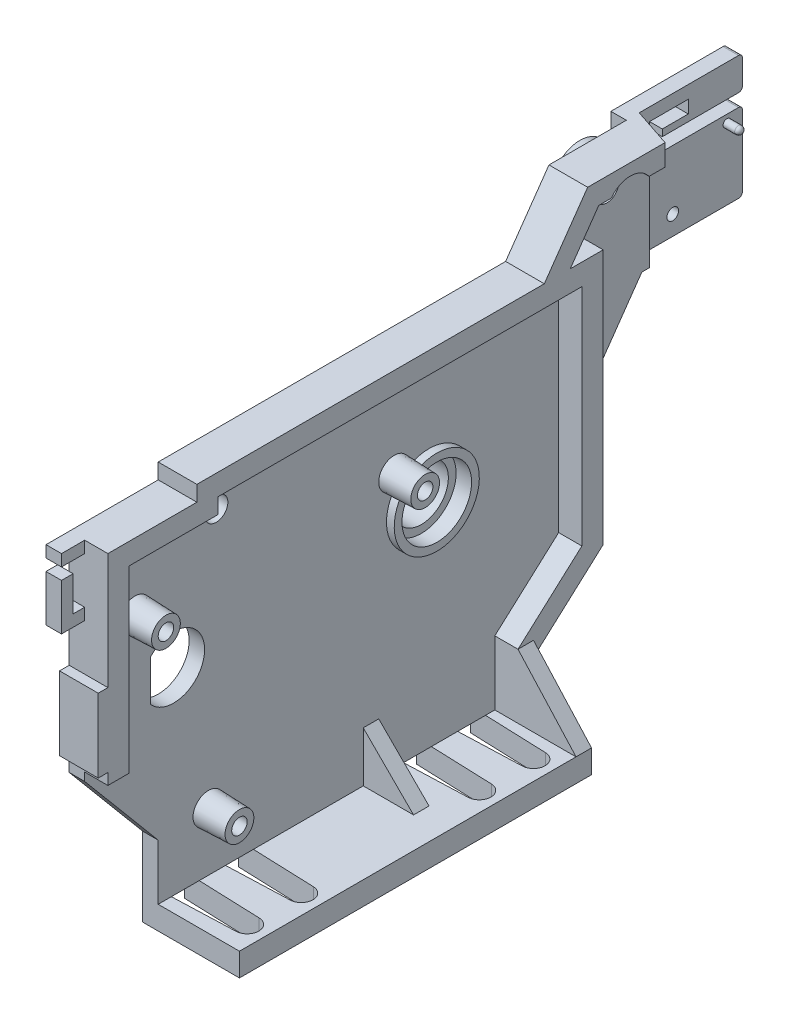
ISO-10303-21;
HEADER;
FILE_DESCRIPTION(('STEP AP214'),'2;1');
FILE_NAME('part.step','',(''),(''),'','','');
FILE_SCHEMA(('AUTOMOTIVE_DESIGN { 1 0 10303 214 1 1 1 1 }'));
ENDSEC;
DATA;
#1=APPLICATION_CONTEXT('core data for automotive mechanical design processes');
#2=APPLICATION_PROTOCOL_DEFINITION('international standard','automotive_design',2000,#1);
#3=PRODUCT_CONTEXT('',#1,'mechanical');
#4=PRODUCT('Part','Part','',(#3));
#5=PRODUCT_RELATED_PRODUCT_CATEGORY('part','',(#4));
#6=PRODUCT_DEFINITION_FORMATION('','',#4);
#7=PRODUCT_DEFINITION_CONTEXT('part definition',#1,'design');
#8=PRODUCT_DEFINITION('design','',#6,#7);
#9=PRODUCT_DEFINITION_SHAPE('','',#8);
#10=(LENGTH_UNIT() NAMED_UNIT(*) SI_UNIT(.MILLI.,.METRE.));
#11=(NAMED_UNIT(*) PLANE_ANGLE_UNIT() SI_UNIT($,.RADIAN.));
#12=(NAMED_UNIT(*) SI_UNIT($,.STERADIAN.) SOLID_ANGLE_UNIT());
#13=UNCERTAINTY_MEASURE_WITH_UNIT(LENGTH_MEASURE(1.E-05),#10,'distance_accuracy_value','');
#14=(GEOMETRIC_REPRESENTATION_CONTEXT(3) GLOBAL_UNCERTAINTY_ASSIGNED_CONTEXT((#13)) GLOBAL_UNIT_ASSIGNED_CONTEXT((#10,
#11,#12)) REPRESENTATION_CONTEXT('',''));
#15=CARTESIAN_POINT('',(0.,0.,0.));
#16=DIRECTION('',(0.,0.,1.));
#17=DIRECTION('',(1.,0.,0.));
#18=AXIS2_PLACEMENT_3D('',#15,#16,#17);
#19=CARTESIAN_POINT('',(2.,19.5,-27.5));
#20=DIRECTION('',(1.,0.,0.));
#21=DIRECTION('',(0.,0.,-1.));
#22=AXIS2_PLACEMENT_3D('',#19,#20,#21);
#23=PLANE('',#22);
#24=CARTESIAN_POINT('',(2.,23.,-23.));
#25=DIRECTION('',(1.,0.,0.));
#26=DIRECTION('',(0.,0.,-1.));
#27=AXIS2_PLACEMENT_3D('',#24,#25,#26);
#28=CIRCLE('',#27,1.5);
#29=CARTESIAN_POINT('',(2.,23.,-24.5));
#30=VERTEX_POINT('',#29);
#31=EDGE_CURVE('E1397',#30,#30,#28,.T.);
#32=ORIENTED_EDGE('',*,*,#31,.F.);
#33=EDGE_LOOP('',(#32));
#34=FACE_BOUND('',#33,.T.);
#35=DIRECTION('',(0.,-1.,0.));
#36=VECTOR('',#35,1.);
#37=CARTESIAN_POINT('',(2.,11.5,-28.5));
#38=LINE('',#37,#36);
#39=CARTESIAN_POINT('',(2.,24.75,-28.5));
#40=VERTEX_POINT('',#39);
#41=CARTESIAN_POINT('',(2.,11.5,-28.5));
#42=VERTEX_POINT('',#41);
#43=EDGE_CURVE('E685',#40,#42,#38,.T.);
#44=ORIENTED_EDGE('',*,*,#43,.F.);
#45=DIRECTION('',(0.,0.,-1.));
#46=VECTOR('',#45,1.);
#47=CARTESIAN_POINT('',(2.,24.75,-27.5));
#48=LINE('',#47,#46);
#49=CARTESIAN_POINT('',(2.,24.75,-25.4366985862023));
#50=VERTEX_POINT('',#49);
#51=EDGE_CURVE('E45',#50,#40,#48,.T.);
#52=ORIENTED_EDGE('',*,*,#51,.F.);
#53=CARTESIAN_POINT('',(2.,23.,-23.));
#54=DIRECTION('',(1.,0.,0.));
#55=DIRECTION('',(0.,0.,-1.));
#56=AXIS2_PLACEMENT_3D('',#53,#54,#55);
#57=CIRCLE('',#56,3.);
#58=CARTESIAN_POINT('',(2.,24.75,-20.5633014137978));
#59=VERTEX_POINT('',#58);
#60=EDGE_CURVE('E762',#59,#50,#57,.F.);
#61=ORIENTED_EDGE('',*,*,#60,.F.);
#62=CARTESIAN_POINT('',(2.,24.75,-18.9315593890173));
#63=VERTEX_POINT('',#62);
#64=EDGE_CURVE('E1095',#63,#59,#48,.T.);
#65=ORIENTED_EDGE('',*,*,#64,.F.);
#66=DIRECTION('',(0.,0.819152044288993,-0.573576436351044));
#67=VECTOR('',#66,1.);
#68=CARTESIAN_POINT('',(2.,24.75,-18.9315593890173));
#69=LINE('',#68,#67);
#70=CARTESIAN_POINT('',(2.,19.5,-15.2554698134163));
#71=VERTEX_POINT('',#70);
#72=EDGE_CURVE('E1092',#71,#63,#69,.T.);
#73=ORIENTED_EDGE('',*,*,#72,.F.);
#74=DIRECTION('',(0.,0.,1.));
#75=VECTOR('',#74,1.);
#76=CARTESIAN_POINT('',(2.,19.5,-15.2554698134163));
#77=LINE('',#76,#75);
#78=CARTESIAN_POINT('',(2.,19.5,-19.5));
#79=VERTEX_POINT('',#78);
#80=EDGE_CURVE('E1089',#79,#71,#77,.T.);
#81=ORIENTED_EDGE('',*,*,#80,.F.);
#82=DIRECTION('',(0.,1.,0.));
#83=VECTOR('',#82,1.);
#84=CARTESIAN_POINT('',(2.,-13.5,-19.5));
#85=LINE('',#84,#83);
#86=CARTESIAN_POINT('',(2.,0.0748159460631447,-19.5));
#87=VERTEX_POINT('',#86);
#88=EDGE_CURVE('E1086',#87,#79,#85,.T.);
#89=ORIENTED_EDGE('',*,*,#88,.F.);
#90=DIRECTION('',(0.,0.819152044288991,-0.573576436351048));
#91=VECTOR('',#90,1.);
#92=CARTESIAN_POINT('',(2.,0.0748159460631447,-19.5));
#93=LINE('',#92,#91);
#94=CARTESIAN_POINT('',(2.,11.5,-27.5));
#95=VERTEX_POINT('',#94);
#96=EDGE_CURVE('E1108',#87,#95,#93,.T.);
#97=ORIENTED_EDGE('',*,*,#96,.T.);
#98=DIRECTION('',(0.,0.,1.));
#99=VECTOR('',#98,1.);
#100=CARTESIAN_POINT('',(2.,11.5,-28.5));
#101=LINE('',#100,#99);
#102=EDGE_CURVE('E687',#42,#95,#101,.T.);
#103=ORIENTED_EDGE('',*,*,#102,.F.);
#104=EDGE_LOOP('',(#44,#52,#61,#65,#73,#81,#89,#97,#103));
#105=FACE_BOUND('',#104,.T.);
#106=ADVANCED_FACE('F30',(#34,#105),#23,.T.);
#107=CARTESIAN_POINT('',(-2.,11.5,-28.5));
#108=DIRECTION('',(0.,0.,-1.));
#109=DIRECTION('',(0.,1.,0.));
#110=AXIS2_PLACEMENT_3D('',#107,#108,#109);
#111=PLANE('',#110);
#112=DIRECTION('',(0.,-1.,0.));
#113=VECTOR('',#112,1.);
#114=CARTESIAN_POINT('',(0.,11.5,-28.5));
#115=LINE('',#114,#113);
#116=CARTESIAN_POINT('',(0.,24.75,-28.5));
#117=VERTEX_POINT('',#116);
#118=CARTESIAN_POINT('',(0.,11.5,-28.5));
#119=VERTEX_POINT('',#118);
#120=EDGE_CURVE('E1043',#117,#119,#115,.T.);
#121=ORIENTED_EDGE('',*,*,#120,.F.);
#122=DIRECTION('',(1.,0.,0.));
#123=VECTOR('',#122,1.);
#124=CARTESIAN_POINT('',(-2.,24.75,-28.5));
#125=LINE('',#124,#123);
#126=EDGE_CURVE('E11',#117,#40,#125,.T.);
#127=ORIENTED_EDGE('',*,*,#126,.T.);
#128=ORIENTED_EDGE('',*,*,#43,.T.);
#129=DIRECTION('',(-1.,0.,0.));
#130=VECTOR('',#129,1.);
#131=CARTESIAN_POINT('',(2.,11.5,-28.5));
#132=LINE('',#131,#130);
#133=EDGE_CURVE('E678',#42,#119,#132,.T.);
#134=ORIENTED_EDGE('',*,*,#133,.T.);
#135=EDGE_LOOP('',(#121,#127,#128,#134));
#136=FACE_BOUND('',#135,.T.);
#137=ADVANCED_FACE('F960',(#136),#111,.T.);
#138=CARTESIAN_POINT('',(0.,11.5,-42.5));
#139=DIRECTION('',(1.,0.,0.));
#140=DIRECTION('',(0.,0.,-1.));
#141=AXIS2_PLACEMENT_3D('',#138,#139,#140);
#142=PLANE('',#141);
#143=DIRECTION('',(0.,1.,0.));
#144=VECTOR('',#143,1.);
#145=CARTESIAN_POINT('',(0.,19.4795372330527,-29.1666666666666));
#146=LINE('',#145,#144);
#147=CARTESIAN_POINT('',(0.,24.75,-29.1666666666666));
#148=VERTEX_POINT('',#147);
#149=CARTESIAN_POINT('',(0.,27.5,-29.1666666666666));
#150=VERTEX_POINT('',#149);
#151=EDGE_CURVE('E604',#148,#150,#146,.T.);
#152=ORIENTED_EDGE('',*,*,#151,.F.);
#153=DIRECTION('',(0.,0.,-1.));
#154=VECTOR('',#153,1.);
#155=CARTESIAN_POINT('',(0.,24.75,-27.5));
#156=LINE('',#155,#154);
#157=EDGE_CURVE('E2778',#117,#148,#156,.T.);
#158=ORIENTED_EDGE('',*,*,#157,.F.);
#159=ORIENTED_EDGE('',*,*,#120,.T.);
#160=DIRECTION('',(0.,0.,1.));
#161=VECTOR('',#160,1.);
#162=CARTESIAN_POINT('',(0.,11.5,-42.5));
#163=LINE('',#162,#161);
#164=CARTESIAN_POINT('',(0.,11.5,-42.));
#165=VERTEX_POINT('',#164);
#166=EDGE_CURVE('E621',#165,#119,#163,.T.);
#167=ORIENTED_EDGE('',*,*,#166,.F.);
#168=CARTESIAN_POINT('',(0.,12.,-42.));
#169=DIRECTION('',(1.,0.,0.));
#170=DIRECTION('',(0.,0.,-1.));
#171=AXIS2_PLACEMENT_3D('',#168,#169,#170);
#172=CIRCLE('',#171,0.5);
#173=CARTESIAN_POINT('',(0.,12.,-42.5));
#174=VERTEX_POINT('',#173);
#175=EDGE_CURVE('E2747',#165,#174,#172,.T.);
#176=ORIENTED_EDGE('',*,*,#175,.T.);
#177=DIRECTION('',(0.,-1.,0.));
#178=VECTOR('',#177,1.);
#179=CARTESIAN_POINT('',(0.,21.6797328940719,-42.5));
#180=LINE('',#179,#178);
#181=CARTESIAN_POINT('',(0.,21.1797328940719,-42.5));
#182=VERTEX_POINT('',#181);
#183=EDGE_CURVE('E649',#182,#174,#180,.T.);
#184=ORIENTED_EDGE('',*,*,#183,.F.);
#185=CARTESIAN_POINT('',(0.,21.1797328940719,-42.));
#186=DIRECTION('',(1.,0.,0.));
#187=DIRECTION('',(0.,0.,-1.));
#188=AXIS2_PLACEMENT_3D('',#185,#186,#187);
#189=CIRCLE('',#188,0.5);
#190=CARTESIAN_POINT('',(0.,21.6797328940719,-42.));
#191=VERTEX_POINT('',#190);
#192=EDGE_CURVE('E53',#182,#191,#189,.T.);
#193=ORIENTED_EDGE('',*,*,#192,.T.);
#194=DIRECTION('',(0.,0.,-1.));
#195=VECTOR('',#194,1.);
#196=CARTESIAN_POINT('',(0.,21.6797328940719,-30.5));
#197=LINE('',#196,#195);
#198=CARTESIAN_POINT('',(0.,21.6797328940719,-30.5));
#199=VERTEX_POINT('',#198);
#200=EDGE_CURVE('E647',#199,#191,#197,.T.);
#201=ORIENTED_EDGE('',*,*,#200,.F.);
#202=DIRECTION('',(0.,-1.,0.));
#203=VECTOR('',#202,1.);
#204=CARTESIAN_POINT('',(0.,25.8498979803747,-30.5));
#205=LINE('',#204,#203);
#206=CARTESIAN_POINT('',(0.,25.8498979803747,-30.5));
#207=VERTEX_POINT('',#206);
#208=EDGE_CURVE('E644',#207,#199,#205,.T.);
#209=ORIENTED_EDGE('',*,*,#208,.F.);
#210=DIRECTION('',(0.,0.,1.));
#211=VECTOR('',#210,1.);
#212=CARTESIAN_POINT('',(0.,25.8498979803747,-35.5));
#213=LINE('',#212,#211);
#214=CARTESIAN_POINT('',(0.,25.8498979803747,-35.5));
#215=VERTEX_POINT('',#214);
#216=EDGE_CURVE('E641',#215,#207,#213,.T.);
#217=ORIENTED_EDGE('',*,*,#216,.F.);
#218=DIRECTION('',(0.,1.,0.));
#219=VECTOR('',#218,1.);
#220=CARTESIAN_POINT('',(0.,24.1997959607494,-35.5));
#221=LINE('',#220,#219);
#222=CARTESIAN_POINT('',(0.,24.1997959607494,-35.5));
#223=VERTEX_POINT('',#222);
#224=EDGE_CURVE('E638',#223,#215,#221,.T.);
#225=ORIENTED_EDGE('',*,*,#224,.F.);
#226=DIRECTION('',(0.,0.,-1.));
#227=VECTOR('',#226,1.);
#228=CARTESIAN_POINT('',(0.,24.1997959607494,-32.1501020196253));
#229=LINE('',#228,#227);
#230=CARTESIAN_POINT('',(0.,24.1997959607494,-32.1501020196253));
#231=VERTEX_POINT('',#230);
#232=EDGE_CURVE('E635',#231,#223,#229,.T.);
#233=ORIENTED_EDGE('',*,*,#232,.F.);
#234=DIRECTION('',(0.,1.,0.));
#235=VECTOR('',#234,1.);
#236=CARTESIAN_POINT('',(0.,23.3298349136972,-32.1501020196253));
#237=LINE('',#236,#235);
#238=CARTESIAN_POINT('',(0.,23.3298349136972,-32.1501020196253));
#239=VERTEX_POINT('',#238);
#240=EDGE_CURVE('E632',#239,#231,#237,.T.);
#241=ORIENTED_EDGE('',*,*,#240,.F.);
#242=DIRECTION('',(0.,0.,1.));
#243=VECTOR('',#242,1.);
#244=CARTESIAN_POINT('',(0.,23.3298349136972,-42.5));
#245=LINE('',#244,#243);
#246=CARTESIAN_POINT('',(0.,23.3298349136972,-42.));
#247=VERTEX_POINT('',#246);
#248=EDGE_CURVE('E624',#247,#239,#245,.T.);
#249=ORIENTED_EDGE('',*,*,#248,.F.);
#250=CARTESIAN_POINT('',(0.,23.8298349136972,-42.));
#251=DIRECTION('',(1.,0.,0.));
#252=DIRECTION('',(0.,0.,-1.));
#253=AXIS2_PLACEMENT_3D('',#250,#251,#252);
#254=CIRCLE('',#253,0.5);
#255=CARTESIAN_POINT('',(0.,23.8298349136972,-42.5));
#256=VERTEX_POINT('',#255);
#257=EDGE_CURVE('E2752',#247,#256,#254,.T.);
#258=ORIENTED_EDGE('',*,*,#257,.T.);
#259=DIRECTION('',(0.,-1.,0.));
#260=VECTOR('',#259,1.);
#261=CARTESIAN_POINT('',(0.,27.5,-42.5));
#262=LINE('',#261,#260);
#263=CARTESIAN_POINT('',(0.,27.,-42.5));
#264=VERTEX_POINT('',#263);
#265=EDGE_CURVE('E620',#264,#256,#262,.T.);
#266=ORIENTED_EDGE('',*,*,#265,.F.);
#267=CARTESIAN_POINT('',(0.,27.,-42.));
#268=DIRECTION('',(1.,0.,0.));
#269=DIRECTION('',(0.,0.,-1.));
#270=AXIS2_PLACEMENT_3D('',#267,#268,#269);
#271=CIRCLE('',#270,0.5);
#272=CARTESIAN_POINT('',(0.,27.5,-42.));
#273=VERTEX_POINT('',#272);
#274=EDGE_CURVE('E618',#264,#273,#271,.T.);
#275=ORIENTED_EDGE('',*,*,#274,.T.);
#276=DIRECTION('',(0.,0.,-1.));
#277=VECTOR('',#276,1.);
#278=CARTESIAN_POINT('',(0.,27.5,-42.5));
#279=LINE('',#278,#277);
#280=EDGE_CURVE('E597',#150,#273,#279,.T.);
#281=ORIENTED_EDGE('',*,*,#280,.F.);
#282=EDGE_LOOP('',(#152,#158,#159,#167,#176,#184,#193,#201,#209,#217,#225,#233,#241,#249,#258,
#266,#275,#281));
#283=FACE_BOUND('',#282,.T.);
#284=CARTESIAN_POINT('',(0.,14.,-33.5));
#285=DIRECTION('',(1.,0.,0.));
#286=DIRECTION('',(0.,0.,-1.));
#287=AXIS2_PLACEMENT_3D('',#284,#285,#286);
#288=CIRCLE('',#287,0.749999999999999);
#289=CARTESIAN_POINT('',(0.,14.,-34.25));
#290=VERTEX_POINT('',#289);
#291=EDGE_CURVE('E2777',#290,#290,#288,.T.);
#292=ORIENTED_EDGE('',*,*,#291,.F.);
#293=EDGE_LOOP('',(#292));
#294=FACE_BOUND('',#293,.T.);
#295=CARTESIAN_POINT('',(0.,20.6797328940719,-40.5));
#296=DIRECTION('',(1.,0.,0.));
#297=DIRECTION('',(0.,0.,-1.));
#298=AXIS2_PLACEMENT_3D('',#295,#296,#297);
#299=CIRCLE('',#298,0.499999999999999);
#300=CARTESIAN_POINT('',(0.,20.6797328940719,-41.));
#301=VERTEX_POINT('',#300);
#302=EDGE_CURVE('E2775',#301,#301,#299,.T.);
#303=ORIENTED_EDGE('',*,*,#302,.F.);
#304=EDGE_LOOP('',(#303));
#305=FACE_BOUND('',#304,.T.);
#306=ADVANCED_FACE('F614',(#283,#294,#305),#142,.T.);
#307=CARTESIAN_POINT('',(-2.,11.5,-28.5));
#308=DIRECTION('',(1.,0.,0.));
#309=DIRECTION('',(0.,0.,-1.));
#310=AXIS2_PLACEMENT_3D('',#307,#308,#309);
#311=PLANE('',#310);
#312=DIRECTION('',(0.,-1.,0.));
#313=VECTOR('',#312,1.);
#314=CARTESIAN_POINT('',(-2.,27.5,-42.5));
#315=LINE('',#314,#313);
#316=CARTESIAN_POINT('',(-2.,27.,-42.5));
#317=VERTEX_POINT('',#316);
#318=CARTESIAN_POINT('',(-2.,23.8298349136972,-42.5));
#319=VERTEX_POINT('',#318);
#320=EDGE_CURVE('E2790',#317,#319,#315,.T.);
#321=ORIENTED_EDGE('',*,*,#320,.T.);
#322=CARTESIAN_POINT('',(-2.,23.8298349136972,-42.));
#323=DIRECTION('',(1.,0.,0.));
#324=DIRECTION('',(0.,0.,-1.));
#325=AXIS2_PLACEMENT_3D('',#322,#323,#324);
#326=CIRCLE('',#325,0.5);
#327=CARTESIAN_POINT('',(-2.,23.3298349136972,-42.));
#328=VERTEX_POINT('',#327);
#329=EDGE_CURVE('E2837',#319,#328,#326,.F.);
#330=ORIENTED_EDGE('',*,*,#329,.T.);
#331=DIRECTION('',(0.,0.,1.));
#332=VECTOR('',#331,1.);
#333=CARTESIAN_POINT('',(-2.,23.3298349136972,-42.5));
#334=LINE('',#333,#332);
#335=CARTESIAN_POINT('',(-2.,23.3298349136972,-32.1501020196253));
#336=VERTEX_POINT('',#335);
#337=EDGE_CURVE('E2793',#328,#336,#334,.T.);
#338=ORIENTED_EDGE('',*,*,#337,.T.);
#339=DIRECTION('',(0.,1.,0.));
#340=VECTOR('',#339,1.);
#341=CARTESIAN_POINT('',(-2.,23.3298349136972,-32.1501020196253));
#342=LINE('',#341,#340);
#343=CARTESIAN_POINT('',(-2.,24.1997959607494,-32.1501020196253));
#344=VERTEX_POINT('',#343);
#345=EDGE_CURVE('E2795',#336,#344,#342,.T.);
#346=ORIENTED_EDGE('',*,*,#345,.T.);
#347=DIRECTION('',(0.,0.,-1.));
#348=VECTOR('',#347,1.);
#349=CARTESIAN_POINT('',(-2.,24.1997959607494,-32.1501020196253));
#350=LINE('',#349,#348);
#351=CARTESIAN_POINT('',(-2.,24.1997959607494,-35.5));
#352=VERTEX_POINT('',#351);
#353=EDGE_CURVE('E2798',#344,#352,#350,.T.);
#354=ORIENTED_EDGE('',*,*,#353,.T.);
#355=DIRECTION('',(0.,1.,0.));
#356=VECTOR('',#355,1.);
#357=CARTESIAN_POINT('',(-2.,24.1997959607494,-35.5));
#358=LINE('',#357,#356);
#359=CARTESIAN_POINT('',(-2.,25.8498979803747,-35.5));
#360=VERTEX_POINT('',#359);
#361=EDGE_CURVE('E2801',#352,#360,#358,.T.);
#362=ORIENTED_EDGE('',*,*,#361,.T.);
#363=DIRECTION('',(0.,0.,1.));
#364=VECTOR('',#363,1.);
#365=CARTESIAN_POINT('',(-2.,25.8498979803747,-35.5));
#366=LINE('',#365,#364);
#367=CARTESIAN_POINT('',(-2.,25.8498979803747,-30.5));
#368=VERTEX_POINT('',#367);
#369=EDGE_CURVE('E2804',#360,#368,#366,.T.);
#370=ORIENTED_EDGE('',*,*,#369,.T.);
#371=DIRECTION('',(0.,-1.,0.));
#372=VECTOR('',#371,1.);
#373=CARTESIAN_POINT('',(-2.,25.8498979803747,-30.5));
#374=LINE('',#373,#372);
#375=CARTESIAN_POINT('',(-2.,21.6797328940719,-30.5));
#376=VERTEX_POINT('',#375);
#377=EDGE_CURVE('E2807',#368,#376,#374,.T.);
#378=ORIENTED_EDGE('',*,*,#377,.T.);
#379=DIRECTION('',(0.,0.,-1.));
#380=VECTOR('',#379,1.);
#381=CARTESIAN_POINT('',(-2.,21.6797328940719,-30.5));
#382=LINE('',#381,#380);
#383=CARTESIAN_POINT('',(-2.,21.6797328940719,-42.));
#384=VERTEX_POINT('',#383);
#385=EDGE_CURVE('E2810',#376,#384,#382,.T.);
#386=ORIENTED_EDGE('',*,*,#385,.T.);
#387=CARTESIAN_POINT('',(-2.,21.1797328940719,-42.));
#388=DIRECTION('',(1.,0.,0.));
#389=DIRECTION('',(0.,0.,-1.));
#390=AXIS2_PLACEMENT_3D('',#387,#388,#389);
#391=CIRCLE('',#390,0.5);
#392=CARTESIAN_POINT('',(-2.,21.1797328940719,-42.5));
#393=VERTEX_POINT('',#392);
#394=EDGE_CURVE('E2816',#384,#393,#391,.F.);
#395=ORIENTED_EDGE('',*,*,#394,.T.);
#396=DIRECTION('',(0.,-1.,0.));
#397=VECTOR('',#396,1.);
#398=CARTESIAN_POINT('',(-2.,21.6797328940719,-42.5));
#399=LINE('',#398,#397);
#400=CARTESIAN_POINT('',(-2.,12.,-42.5));
#401=VERTEX_POINT('',#400);
#402=EDGE_CURVE('E627',#393,#401,#399,.T.);
#403=ORIENTED_EDGE('',*,*,#402,.T.);
#404=CARTESIAN_POINT('',(-2.,12.,-42.));
#405=DIRECTION('',(1.,0.,0.));
#406=DIRECTION('',(0.,0.,-1.));
#407=AXIS2_PLACEMENT_3D('',#404,#405,#406);
#408=CIRCLE('',#407,0.5);
#409=CARTESIAN_POINT('',(-2.,11.5,-42.));
#410=VERTEX_POINT('',#409);
#411=EDGE_CURVE('E2815',#401,#410,#408,.F.);
#412=ORIENTED_EDGE('',*,*,#411,.T.);
#413=DIRECTION('',(0.,0.,1.));
#414=VECTOR('',#413,1.);
#415=CARTESIAN_POINT('',(-2.,11.5,-28.5));
#416=LINE('',#415,#414);
#417=CARTESIAN_POINT('',(-2.,11.5,-27.5));
#418=VERTEX_POINT('',#417);
#419=EDGE_CURVE('E674',#410,#418,#416,.T.);
#420=ORIENTED_EDGE('',*,*,#419,.T.);
#421=DIRECTION('',(0.,1.,0.));
#422=VECTOR('',#421,1.);
#423=CARTESIAN_POINT('',(-2.,11.5,-27.5));
#424=LINE('',#423,#422);
#425=CARTESIAN_POINT('',(-2.,27.5,-27.5));
#426=VERTEX_POINT('',#425);
#427=EDGE_CURVE('E668',#418,#426,#424,.T.);
#428=ORIENTED_EDGE('',*,*,#427,.T.);
#429=DIRECTION('',(0.,0.,1.));
#430=VECTOR('',#429,1.);
#431=CARTESIAN_POINT('',(-2.,27.5,-28.5));
#432=LINE('',#431,#430);
#433=CARTESIAN_POINT('',(-2.,27.5,-42.));
#434=VERTEX_POINT('',#433);
#435=EDGE_CURVE('E688',#434,#426,#432,.T.);
#436=ORIENTED_EDGE('',*,*,#435,.F.);
#437=CARTESIAN_POINT('',(-2.,27.,-42.));
#438=DIRECTION('',(1.,0.,0.));
#439=DIRECTION('',(0.,0.,-1.));
#440=AXIS2_PLACEMENT_3D('',#437,#438,#439);
#441=CIRCLE('',#440,0.5);
#442=EDGE_CURVE('E2839',#434,#317,#441,.F.);
#443=ORIENTED_EDGE('',*,*,#442,.T.);
#444=EDGE_LOOP('',(#321,#330,#338,#346,#354,#362,#370,#378,#386,#395,#403,#412,#420,#428,#436,#443));
#445=FACE_BOUND('',#444,.T.);
#446=CARTESIAN_POINT('',(-2.,14.,-33.5));
#447=DIRECTION('',(1.,0.,0.));
#448=DIRECTION('',(0.,0.,-1.));
#449=AXIS2_PLACEMENT_3D('',#446,#447,#448);
#450=CIRCLE('',#449,1.5);
#451=CARTESIAN_POINT('',(-2.,14.,-35.));
#452=VERTEX_POINT('',#451);
#453=EDGE_CURVE('E2768',#452,#452,#450,.F.);
#454=ORIENTED_EDGE('',*,*,#453,.F.);
#455=EDGE_LOOP('',(#454));
#456=FACE_BOUND('',#455,.T.);
#457=ADVANCED_FACE('F977',(#445,#456),#311,.F.);
#458=CARTESIAN_POINT('',(5.,24.75,-27.5));
#459=DIRECTION('',(0.,1.,0.));
#460=DIRECTION('',(0.,0.,1.));
#461=AXIS2_PLACEMENT_3D('',#458,#459,#460);
#462=PLANE('',#461);
#463=ORIENTED_EDGE('',*,*,#64,.T.);
#464=DIRECTION('',(1.,0.,0.));
#465=VECTOR('',#464,1.);
#466=CARTESIAN_POINT('',(-6.48528137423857,24.75,-20.5633014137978));
#467=LINE('',#466,#465);
#468=CARTESIAN_POINT('',(5.,24.75,-20.5633014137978));
#469=VERTEX_POINT('',#468);
#470=EDGE_CURVE('E766',#59,#469,#467,.T.);
#471=ORIENTED_EDGE('',*,*,#470,.T.);
#472=DIRECTION('',(0.,0.,-1.));
#473=VECTOR('',#472,1.);
#474=CARTESIAN_POINT('',(5.,24.75,-27.5));
#475=LINE('',#474,#473);
#476=CARTESIAN_POINT('',(5.,24.75,-18.9315593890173));
#477=VERTEX_POINT('',#476);
#478=EDGE_CURVE('E1832',#477,#469,#475,.T.);
#479=ORIENTED_EDGE('',*,*,#478,.F.);
#480=DIRECTION('',(-1.,0.,0.));
#481=VECTOR('',#480,1.);
#482=CARTESIAN_POINT('',(5.,24.75,-18.9315593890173));
#483=LINE('',#482,#481);
#484=EDGE_CURVE('E1909',#477,#63,#483,.T.);
#485=ORIENTED_EDGE('',*,*,#484,.T.);
#486=EDGE_LOOP('',(#463,#471,#479,#485));
#487=FACE_BOUND('',#486,.T.);
#488=ADVANCED_FACE('F972',(#487),#462,.F.);
#489=CARTESIAN_POINT('',(2.,-20.5,28.5000000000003));
#490=DIRECTION('',(1.,0.,0.));
#491=DIRECTION('',(0.,0.,-1.));
#492=AXIS2_PLACEMENT_3D('',#489,#490,#491);
#493=CIRCLE('',#492,2.);
#494=CARTESIAN_POINT('',(2.,-20.5,26.5000000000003));
#495=VERTEX_POINT('',#494);
#496=EDGE_CURVE('E802',#495,#495,#493,.T.);
#497=ORIENTED_EDGE('',*,*,#496,.F.);
#498=EDGE_LOOP('',(#497));
#499=FACE_BOUND('',#498,.T.);
#500=DIRECTION('',(0.,1.,0.));
#501=VECTOR('',#500,1.);
#502=CARTESIAN_POINT('',(2.,19.5,6.50000000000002));
#503=LINE('',#502,#501);
#504=CARTESIAN_POINT('',(2.,-28.000000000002,6.50000000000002));
#505=VERTEX_POINT('',#504);
#506=CARTESIAN_POINT('',(2.,-21.5,6.50000000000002));
#507=VERTEX_POINT('',#506);
#508=EDGE_CURVE('E988',#505,#507,#503,.T.);
#509=ORIENTED_EDGE('',*,*,#508,.F.);
#510=DIRECTION('',(0.,0.,1.));
#511=VECTOR('',#510,1.);
#512=CARTESIAN_POINT('',(2.,-28.,35.));
#513=LINE('',#512,#511);
#514=CARTESIAN_POINT('',(2.,-28.,3.30020968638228));
#515=VERTEX_POINT('',#514);
#516=EDGE_CURVE('E1211',#515,#505,#513,.T.);
#517=ORIENTED_EDGE('',*,*,#516,.F.);
#518=CARTESIAN_POINT('',(2.,-28.,-0.300209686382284));
#519=VERTEX_POINT('',#518);
#520=EDGE_CURVE('E1207',#519,#515,#513,.T.);
#521=ORIENTED_EDGE('',*,*,#520,.F.);
#522=CARTESIAN_POINT('',(2.,-28.,-3.69979031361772));
#523=VERTEX_POINT('',#522);
#524=EDGE_CURVE('E1221',#523,#519,#513,.T.);
#525=ORIENTED_EDGE('',*,*,#524,.F.);
#526=CARTESIAN_POINT('',(2.,-28.,-7.30020968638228));
#527=VERTEX_POINT('',#526);
#528=EDGE_CURVE('E1188',#527,#523,#513,.T.);
#529=ORIENTED_EDGE('',*,*,#528,.F.);
#530=CARTESIAN_POINT('',(2.,-28.,-8.49999999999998));
#531=VERTEX_POINT('',#530);
#532=EDGE_CURVE('E1183',#531,#527,#513,.T.);
#533=ORIENTED_EDGE('',*,*,#532,.F.);
#534=DIRECTION('',(0.,-1.,0.));
#535=VECTOR('',#534,1.);
#536=CARTESIAN_POINT('',(2.,-19.7039544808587,-8.49999999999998));
#537=LINE('',#536,#535);
#538=CARTESIAN_POINT('',(2.,-19.7039544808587,-8.49999999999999));
#539=VERTEX_POINT('',#538);
#540=EDGE_CURVE('E1940',#539,#531,#537,.T.);
#541=ORIENTED_EDGE('',*,*,#540,.F.);
#542=DIRECTION('',(0.,-0.669130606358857,0.743144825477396));
#543=VECTOR('',#542,1.);
#544=CARTESIAN_POINT('',(2.,-19.7039544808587,-8.49999999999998));
#545=LINE('',#544,#543);
#546=CARTESIAN_POINT('',(2.,-12.2756211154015,-16.75));
#547=VERTEX_POINT('',#546);
#548=EDGE_CURVE('E1943',#547,#539,#545,.T.);
#549=ORIENTED_EDGE('',*,*,#548,.F.);
#550=DIRECTION('',(0.,-1.,0.));
#551=VECTOR('',#550,1.);
#552=CARTESIAN_POINT('',(2.,-12.2756211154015,-16.75));
#553=LINE('',#552,#551);
#554=CARTESIAN_POINT('',(2.,16.75,-16.75));
#555=VERTEX_POINT('',#554);
#556=EDGE_CURVE('E1945',#555,#547,#553,.T.);
#557=ORIENTED_EDGE('',*,*,#556,.F.);
#558=DIRECTION('',(0.,0.,-1.));
#559=VECTOR('',#558,1.);
#560=CARTESIAN_POINT('',(2.,16.75,-16.75));
#561=LINE('',#560,#559);
#562=CARTESIAN_POINT('',(2.,16.75,30.2499999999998));
#563=VERTEX_POINT('',#562);
#564=EDGE_CURVE('E1948',#563,#555,#561,.T.);
#565=ORIENTED_EDGE('',*,*,#564,.F.);
#566=DIRECTION('',(0.,1.,0.));
#567=VECTOR('',#566,1.);
#568=CARTESIAN_POINT('',(2.,16.75,30.2499999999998));
#569=LINE('',#568,#567);
#570=CARTESIAN_POINT('',(2.,14.75,30.2499999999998));
#571=VERTEX_POINT('',#570);
#572=EDGE_CURVE('E1951',#571,#563,#569,.T.);
#573=ORIENTED_EDGE('',*,*,#572,.F.);
#574=DIRECTION('',(0.,0.,-1.));
#575=VECTOR('',#574,1.);
#576=CARTESIAN_POINT('',(2.,14.75,30.2499999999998));
#577=LINE('',#576,#575);
#578=CARTESIAN_POINT('',(2.,14.75,41.75));
#579=VERTEX_POINT('',#578);
#580=EDGE_CURVE('E1954',#579,#571,#577,.T.);
#581=ORIENTED_EDGE('',*,*,#580,.F.);
#582=DIRECTION('',(0.,1.,0.));
#583=VECTOR('',#582,1.);
#584=CARTESIAN_POINT('',(2.,14.75,41.75));
#585=LINE('',#584,#583);
#586=CARTESIAN_POINT('',(2.,-8.45121308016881,41.75));
#587=VERTEX_POINT('',#586);
#588=EDGE_CURVE('E1956',#587,#579,#585,.T.);
#589=ORIENTED_EDGE('',*,*,#588,.F.);
#590=DIRECTION('',(0.,0.,-1.));
#591=VECTOR('',#590,1.);
#592=CARTESIAN_POINT('',(2.,-8.45121308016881,41.75));
#593=LINE('',#592,#591);
#594=CARTESIAN_POINT('',(2.,-8.45121308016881,44.5));
#595=VERTEX_POINT('',#594);
#596=EDGE_CURVE('E1099',#595,#587,#593,.T.);
#597=ORIENTED_EDGE('',*,*,#596,.F.);
#598=DIRECTION('',(0.,-1.,0.));
#599=VECTOR('',#598,1.);
#600=CARTESIAN_POINT('',(2.,-7.,44.5));
#601=LINE('',#600,#599);
#602=CARTESIAN_POINT('',(2.,-9.5,44.5));
#603=VERTEX_POINT('',#602);
#604=EDGE_CURVE('E1114',#595,#603,#601,.T.);
#605=ORIENTED_EDGE('',*,*,#604,.T.);
#606=DIRECTION('',(0.,-0.766044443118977,-0.642787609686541));
#607=VECTOR('',#606,1.);
#608=CARTESIAN_POINT('',(2.,-9.5,44.5));
#609=LINE('',#608,#607);
#610=CARTESIAN_POINT('',(2.,-20.8216591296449,35.));
#611=VERTEX_POINT('',#610);
#612=EDGE_CURVE('E1164',#603,#611,#609,.T.);
#613=ORIENTED_EDGE('',*,*,#612,.T.);
#614=DIRECTION('',(0.,-1.,0.));
#615=VECTOR('',#614,1.);
#616=CARTESIAN_POINT('',(2.,-20.8216591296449,35.));
#617=LINE('',#616,#615);
#618=CARTESIAN_POINT('',(2.,-28.,35.));
#619=VERTEX_POINT('',#618);
#620=EDGE_CURVE('E1166',#611,#619,#617,.T.);
#621=ORIENTED_EDGE('',*,*,#620,.T.);
#622=CARTESIAN_POINT('',(2.,-28.,33.3002096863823));
#623=VERTEX_POINT('',#622);
#624=EDGE_CURVE('E1225',#623,#619,#513,.T.);
#625=ORIENTED_EDGE('',*,*,#624,.F.);
#626=CARTESIAN_POINT('',(2.,-28.,29.6997903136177));
#627=VERTEX_POINT('',#626);
#628=EDGE_CURVE('E1223',#627,#623,#513,.T.);
#629=ORIENTED_EDGE('',*,*,#628,.F.);
#630=CARTESIAN_POINT('',(2.,-28.,26.3002096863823));
#631=VERTEX_POINT('',#630);
#632=EDGE_CURVE('E1217',#631,#627,#513,.T.);
#633=ORIENTED_EDGE('',*,*,#632,.F.);
#634=CARTESIAN_POINT('',(2.,-28.,22.6997903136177));
#635=VERTEX_POINT('',#634);
#636=EDGE_CURVE('E1214',#635,#631,#513,.T.);
#637=ORIENTED_EDGE('',*,*,#636,.F.);
#638=CARTESIAN_POINT('',(2.,-28.,8.50000000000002));
#639=VERTEX_POINT('',#638);
#640=EDGE_CURVE('E1203',#639,#635,#513,.T.);
#641=ORIENTED_EDGE('',*,*,#640,.F.);
#642=DIRECTION('',(0.,1.,0.));
#643=VECTOR('',#642,1.);
#644=CARTESIAN_POINT('',(2.,19.5,8.50000000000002));
#645=LINE('',#644,#643);
#646=CARTESIAN_POINT('',(2.,-21.5,8.50000000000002));
#647=VERTEX_POINT('',#646);
#648=EDGE_CURVE('E1065',#639,#647,#645,.T.);
#649=ORIENTED_EDGE('',*,*,#648,.T.);
#650=DIRECTION('',(0.,0.,1.));
#651=VECTOR('',#650,1.);
#652=CARTESIAN_POINT('',(2.,-21.5,-27.5));
#653=LINE('',#652,#651);
#654=EDGE_CURVE('E1074',#507,#647,#653,.T.);
#655=ORIENTED_EDGE('',*,*,#654,.F.);
#656=EDGE_LOOP('',(#509,#517,#521,#525,#529,#533,#541,#549,#557,#565,#573,#581,#589,#597,#605,
#613,#621,#625,#629,#633,#637,#641,#649,#655));
#657=FACE_BOUND('',#656,.T.);
#658=DIRECTION('',(0.,-1.,0.));
#659=VECTOR('',#658,1.);
#660=CARTESIAN_POINT('',(2.,0.164129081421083,35.9999999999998));
#661=LINE('',#660,#659);
#662=CARTESIAN_POINT('',(2.,0.164129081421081,35.9999999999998));
#663=VERTEX_POINT('',#662);
#664=CARTESIAN_POINT('',(2.,-5.12737354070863,35.9999999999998));
#665=VERTEX_POINT('',#664);
#666=EDGE_CURVE('E992',#663,#665,#661,.T.);
#667=ORIENTED_EDGE('',*,*,#666,.F.);
#668=CARTESIAN_POINT('',(2.,-2.48162222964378,33.));
#669=DIRECTION('',(1.,0.,0.));
#670=DIRECTION('',(0.,0.,-1.));
#671=AXIS2_PLACEMENT_3D('',#668,#669,#670);
#672=CIRCLE('',#671,4.);
#673=EDGE_CURVE('E2723',#665,#663,#672,.T.);
#674=ORIENTED_EDGE('',*,*,#673,.F.);
#675=EDGE_LOOP('',(#667,#674));
#676=FACE_BOUND('',#675,.T.);
#677=CARTESIAN_POINT('',(2.,12.5,27.5));
#678=DIRECTION('',(1.,0.,0.));
#679=DIRECTION('',(0.,0.,-1.));
#680=AXIS2_PLACEMENT_3D('',#677,#678,#679);
#681=CIRCLE('',#680,1.5);
#682=CARTESIAN_POINT('',(2.,12.5,26.));
#683=VERTEX_POINT('',#682);
#684=EDGE_CURVE('E996',#683,#683,#681,.T.);
#685=ORIENTED_EDGE('',*,*,#684,.F.);
#686=EDGE_LOOP('',(#685));
#687=FACE_BOUND('',#686,.T.);
#688=CARTESIAN_POINT('',(2.,0.,0.));
#689=DIRECTION('',(1.,0.,0.));
#690=DIRECTION('',(0.,0.,-1.));
#691=AXIS2_PLACEMENT_3D('',#688,#689,#690);
#692=CIRCLE('',#691,5.5);
#693=CARTESIAN_POINT('',(2.,3.00291143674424,4.60787618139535));
#694=VERTEX_POINT('',#693);
#695=CARTESIAN_POINT('',(2.,4.89764104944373,2.50262105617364));
#696=VERTEX_POINT('',#695);
#697=EDGE_CURVE('E1001',#694,#696,#692,.T.);
#698=ORIENTED_EDGE('',*,*,#697,.F.);
#699=CARTESIAN_POINT('',(2.,5.00000000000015,4.50000000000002));
#700=DIRECTION('',(1.,0.,0.));
#701=DIRECTION('',(0.,0.,-1.));
#702=AXIS2_PLACEMENT_3D('',#699,#700,#701);
#703=CIRCLE('',#702,2.);
#704=EDGE_CURVE('E808',#696,#694,#703,.T.);
#705=ORIENTED_EDGE('',*,*,#704,.F.);
#706=EDGE_LOOP('',(#698,#705));
#707=FACE_BOUND('',#706,.T.);
#708=CARTESIAN_POINT('',(2.,6.,38.));
#709=DIRECTION('',(1.,0.,0.));
#710=DIRECTION('',(0.,0.,-1.));
#711=AXIS2_PLACEMENT_3D('',#708,#709,#710);
#712=CIRCLE('',#711,2.);
#713=CARTESIAN_POINT('',(2.,6.,36.));
#714=VERTEX_POINT('',#713);
#715=EDGE_CURVE('E796',#714,#714,#712,.T.);
#716=ORIENTED_EDGE('',*,*,#715,.F.);
#717=EDGE_LOOP('',(#716));
#718=FACE_BOUND('',#717,.T.);
#719=ADVANCED_FACE('F955',(#499,#657,#676,#687,#707,#718),#23,.T.);
#720=CARTESIAN_POINT('',(3.,0.,0.));
#721=DIRECTION('',(-1.,0.,0.));
#722=DIRECTION('',(0.,0.,1.));
#723=AXIS2_PLACEMENT_3D('',#720,#721,#722);
#724=CYLINDRICAL_SURFACE('',#723,5.5);
#725=CARTESIAN_POINT('',(3.0002,4.87906158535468,2.53865280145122));
#726=CARTESIAN_POINT('',(2.83346809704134,4.88219708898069,2.53262636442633));
#727=CARTESIAN_POINT('',(2.66673547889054,4.8853134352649,2.52660990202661));
#728=CARTESIAN_POINT('',(2.33326881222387,4.89150781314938,2.51459692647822));
#729=CARTESIAN_POINT('',(2.16653476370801,4.89458584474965,2.50860041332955));
#730=CARTESIAN_POINT('',(1.99979999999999,4.89764471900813,2.50261387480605));
#731=B_SPLINE_CURVE_WITH_KNOTS('',3,(#725,#726,#727,#728,#729,#730),.UNSPECIFIED.,.F.,.F.,(4,2,
4),(0.,0.50061070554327,1.00122141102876),.UNSPECIFIED.);
#732=CARTESIAN_POINT('',(3.,4.87906534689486,2.53864557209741));
#733=VERTEX_POINT('',#732);
#734=EDGE_CURVE('E820',#733,#696,#731,.T.);
#735=ORIENTED_EDGE('',*,*,#734,.F.);
#736=CARTESIAN_POINT('',(3.,0.,0.));
#737=DIRECTION('',(1.,0.,0.));
#738=DIRECTION('',(0.,0.,-1.));
#739=AXIS2_PLACEMENT_3D('',#736,#737,#738);
#740=CIRCLE('',#739,5.5);
#741=CARTESIAN_POINT('',(3.,3.03678698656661,4.58562152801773));
#742=VERTEX_POINT('',#741);
#743=EDGE_CURVE('E1046',#742,#733,#740,.T.);
#744=ORIENTED_EDGE('',*,*,#743,.F.);
#745=CARTESIAN_POINT('',(1.9998,3.0029046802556,4.60788058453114));
#746=CARTESIAN_POINT('',(2.16653476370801,3.00853704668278,4.60421018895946));
#747=CARTESIAN_POINT('',(2.33326881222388,3.01417732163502,4.60051969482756));
#748=CARTESIAN_POINT('',(2.66673547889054,3.0254736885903,4.59309850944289));
#749=CARTESIAN_POINT('',(2.83346809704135,3.03112978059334,4.58936781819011));
#750=CARTESIAN_POINT('',(3.0002,3.03679378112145,4.58561702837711));
#751=B_SPLINE_CURVE_WITH_KNOTS('',3,(#745,#746,#747,#748,#749,#750),.UNSPECIFIED.,.F.,.F.,(4,2,
4),(0.,0.500610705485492,1.00122141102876),.UNSPECIFIED.);
#752=EDGE_CURVE('E813',#694,#742,#751,.T.);
#753=ORIENTED_EDGE('',*,*,#752,.F.);
#754=ORIENTED_EDGE('',*,*,#697,.T.);
#755=EDGE_LOOP('',(#735,#744,#753,#754));
#756=FACE_BOUND('',#755,.T.);
#757=ADVANCED_FACE('F825',(#756),#724,.T.);
#758=CARTESIAN_POINT('',(3.,0.,0.));
#759=DIRECTION('',(1.,0.,0.));
#760=DIRECTION('',(0.,0.,-1.));
#761=AXIS2_PLACEMENT_3D('',#758,#759,#760);
#762=PLANE('',#761);
#763=CARTESIAN_POINT('',(3.,0.,0.));
#764=DIRECTION('',(1.,0.,0.));
#765=DIRECTION('',(0.,0.,-1.));
#766=AXIS2_PLACEMENT_3D('',#763,#764,#765);
#767=CIRCLE('',#766,4.5);
#768=CARTESIAN_POINT('',(3.,0.,-4.5));
#769=VERTEX_POINT('',#768);
#770=EDGE_CURVE('E1245',#769,#769,#767,.T.);
#771=ORIENTED_EDGE('',*,*,#770,.F.);
#772=EDGE_LOOP('',(#771));
#773=FACE_BOUND('',#772,.T.);
#774=ORIENTED_EDGE('',*,*,#743,.T.);
#775=CARTESIAN_POINT('',(3.,5.00000000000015,4.50000000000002));
#776=DIRECTION('',(1.,0.,0.));
#777=DIRECTION('',(0.,0.,-1.));
#778=AXIS2_PLACEMENT_3D('',#775,#776,#777);
#779=CIRCLE('',#778,1.96507923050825);
#780=EDGE_CURVE('E1038',#733,#742,#779,.F.);
#781=ORIENTED_EDGE('',*,*,#780,.T.);
#782=EDGE_LOOP('',(#774,#781));
#783=FACE_BOUND('',#782,.T.);
#784=ADVANCED_FACE('F944',(#773,#783),#762,.T.);
#785=CARTESIAN_POINT('',(0.,19.5,-27.5));
#786=DIRECTION('',(1.,0.,0.));
#787=DIRECTION('',(0.,0.,-1.));
#788=AXIS2_PLACEMENT_3D('',#785,#786,#787);
#789=PLANE('',#788);
#790=CARTESIAN_POINT('',(0.,-20.5,28.5000000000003));
#791=DIRECTION('',(1.,0.,0.));
#792=DIRECTION('',(0.,0.,-1.));
#793=AXIS2_PLACEMENT_3D('',#790,#791,#792);
#794=CIRCLE('',#793,1.);
#795=CARTESIAN_POINT('',(0.,-20.5,27.5000000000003));
#796=VERTEX_POINT('',#795);
#797=EDGE_CURVE('E772',#796,#796,#794,.T.);
#798=ORIENTED_EDGE('',*,*,#797,.T.);
#799=EDGE_LOOP('',(#798));
#800=FACE_BOUND('',#799,.T.);
#801=CARTESIAN_POINT('',(0.,6.,38.));
#802=DIRECTION('',(1.,0.,0.));
#803=DIRECTION('',(0.,0.,-1.));
#804=AXIS2_PLACEMENT_3D('',#801,#802,#803);
#805=CIRCLE('',#804,0.999999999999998);
#806=CARTESIAN_POINT('',(0.,6.,37.));
#807=VERTEX_POINT('',#806);
#808=EDGE_CURVE('E778',#807,#807,#805,.T.);
#809=ORIENTED_EDGE('',*,*,#808,.T.);
#810=EDGE_LOOP('',(#809));
#811=FACE_BOUND('',#810,.T.);
#812=DIRECTION('',(0.,0.,-1.));
#813=VECTOR('',#812,1.);
#814=CARTESIAN_POINT('',(0.,-31.,35.));
#815=LINE('',#814,#813);
#816=CARTESIAN_POINT('',(0.,-31.,29.625));
#817=VERTEX_POINT('',#816);
#818=CARTESIAN_POINT('',(0.,-31.,26.375));
#819=VERTEX_POINT('',#818);
#820=EDGE_CURVE('E1157',#817,#819,#815,.T.);
#821=ORIENTED_EDGE('',*,*,#820,.F.);
#822=DIRECTION('',(0.,-1.,0.));
#823=VECTOR('',#822,1.);
#824=CARTESIAN_POINT('',(0.,-28.,29.625));
#825=LINE('',#824,#823);
#826=CARTESIAN_POINT('',(0.,-28.,29.625));
#827=VERTEX_POINT('',#826);
#828=EDGE_CURVE('E1353',#827,#817,#825,.T.);
#829=ORIENTED_EDGE('',*,*,#828,.F.);
#830=DIRECTION('',(0.,0.,-1.));
#831=VECTOR('',#830,1.);
#832=CARTESIAN_POINT('',(0.,-28.,29.625));
#833=LINE('',#832,#831);
#834=CARTESIAN_POINT('',(0.,-28.,33.375));
#835=VERTEX_POINT('',#834);
#836=EDGE_CURVE('E1359',#835,#827,#833,.T.);
#837=ORIENTED_EDGE('',*,*,#836,.F.);
#838=DIRECTION('',(0.,-1.,0.));
#839=VECTOR('',#838,1.);
#840=CARTESIAN_POINT('',(0.,-28.,33.375));
#841=LINE('',#840,#839);
#842=CARTESIAN_POINT('',(0.,-31.,33.375));
#843=VERTEX_POINT('',#842);
#844=EDGE_CURVE('E1349',#835,#843,#841,.T.);
#845=ORIENTED_EDGE('',*,*,#844,.T.);
#846=CARTESIAN_POINT('',(0.,-31.,35.));
#847=VERTEX_POINT('',#846);
#848=EDGE_CURVE('E1153',#847,#843,#815,.T.);
#849=ORIENTED_EDGE('',*,*,#848,.F.);
#850=DIRECTION('',(0.,-1.,0.));
#851=VECTOR('',#850,1.);
#852=CARTESIAN_POINT('',(0.,-20.8216591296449,35.));
#853=LINE('',#852,#851);
#854=CARTESIAN_POINT('',(0.,-20.8216591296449,35.));
#855=VERTEX_POINT('',#854);
#856=EDGE_CURVE('E1150',#855,#847,#853,.T.);
#857=ORIENTED_EDGE('',*,*,#856,.F.);
#858=DIRECTION('',(0.,-0.766044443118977,-0.642787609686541));
#859=VECTOR('',#858,1.);
#860=CARTESIAN_POINT('',(0.,-9.5,44.5));
#861=LINE('',#860,#859);
#862=CARTESIAN_POINT('',(0.,-9.5,44.5));
#863=VERTEX_POINT('',#862);
#864=EDGE_CURVE('E1148',#863,#855,#861,.T.);
#865=ORIENTED_EDGE('',*,*,#864,.F.);
#866=DIRECTION('',(0.,-1.,0.));
#867=VECTOR('',#866,1.);
#868=CARTESIAN_POINT('',(0.,-7.,44.5));
#869=LINE('',#868,#867);
#870=CARTESIAN_POINT('',(0.,-7.,44.5));
#871=VERTEX_POINT('',#870);
#872=EDGE_CURVE('E1146',#871,#863,#869,.T.);
#873=ORIENTED_EDGE('',*,*,#872,.F.);
#874=DIRECTION('',(0.,0.,-1.));
#875=VECTOR('',#874,1.);
#876=CARTESIAN_POINT('',(0.,-7.,45.75));
#877=LINE('',#876,#875);
#878=CARTESIAN_POINT('',(0.,-7.,45.75));
#879=VERTEX_POINT('',#878);
#880=EDGE_CURVE('E1144',#879,#871,#877,.T.);
#881=ORIENTED_EDGE('',*,*,#880,.F.);
#882=DIRECTION('',(0.,-1.,0.));
#883=VECTOR('',#882,1.);
#884=CARTESIAN_POINT('',(0.,2.5,45.75));
#885=LINE('',#884,#883);
#886=CARTESIAN_POINT('',(0.,2.5,45.75));
#887=VERTEX_POINT('',#886);
#888=EDGE_CURVE('E1142',#887,#879,#885,.T.);
#889=ORIENTED_EDGE('',*,*,#888,.F.);
#890=DIRECTION('',(0.,0.,1.));
#891=VECTOR('',#890,1.);
#892=CARTESIAN_POINT('',(0.,2.5,44.5));
#893=LINE('',#892,#891);
#894=CARTESIAN_POINT('',(0.,2.5,44.5));
#895=VERTEX_POINT('',#894);
#896=EDGE_CURVE('E1140',#895,#887,#893,.T.);
#897=ORIENTED_EDGE('',*,*,#896,.F.);
#898=DIRECTION('',(0.,-1.,0.));
#899=VECTOR('',#898,1.);
#900=CARTESIAN_POINT('',(0.,17.5,44.5));
#901=LINE('',#900,#899);
#902=CARTESIAN_POINT('',(0.,8.5,44.5));
#903=VERTEX_POINT('',#902);
#904=EDGE_CURVE('E1136',#903,#895,#901,.T.);
#905=ORIENTED_EDGE('',*,*,#904,.F.);
#906=DIRECTION('',(0.,0.,1.));
#907=VECTOR('',#906,1.);
#908=CARTESIAN_POINT('',(0.,8.5,44.5));
#909=LINE('',#908,#907);
#910=CARTESIAN_POINT('',(0.,8.5,47.5));
#911=VERTEX_POINT('',#910);
#912=EDGE_CURVE('E2698',#903,#911,#909,.T.);
#913=ORIENTED_EDGE('',*,*,#912,.T.);
#914=DIRECTION('',(0.,1.,0.));
#915=VECTOR('',#914,1.);
#916=CARTESIAN_POINT('',(0.,8.5,47.5));
#917=LINE('',#916,#915);
#918=CARTESIAN_POINT('',(0.,14.5,47.5));
#919=VERTEX_POINT('',#918);
#920=EDGE_CURVE('E679',#911,#919,#917,.T.);
#921=ORIENTED_EDGE('',*,*,#920,.T.);
#922=DIRECTION('',(0.,0.,-1.));
#923=VECTOR('',#922,1.);
#924=CARTESIAN_POINT('',(0.,14.5,47.5));
#925=LINE('',#924,#923);
#926=CARTESIAN_POINT('',(0.,14.5,46.));
#927=VERTEX_POINT('',#926);
#928=EDGE_CURVE('E691',#919,#927,#925,.T.);
#929=ORIENTED_EDGE('',*,*,#928,.T.);
#930=DIRECTION('',(0.,-1.,0.));
#931=VECTOR('',#930,1.);
#932=CARTESIAN_POINT('',(0.,14.5,46.));
#933=LINE('',#932,#931);
#934=CARTESIAN_POINT('',(0.,10.,46.));
#935=VERTEX_POINT('',#934);
#936=EDGE_CURVE('E695',#927,#935,#933,.T.);
#937=ORIENTED_EDGE('',*,*,#936,.T.);
#938=DIRECTION('',(0.,0.,-1.));
#939=VECTOR('',#938,1.);
#940=CARTESIAN_POINT('',(0.,10.,46.));
#941=LINE('',#940,#939);
#942=CARTESIAN_POINT('',(0.,10.,44.5));
#943=VERTEX_POINT('',#942);
#944=EDGE_CURVE('E701',#935,#943,#941,.T.);
#945=ORIENTED_EDGE('',*,*,#944,.T.);
#946=CARTESIAN_POINT('',(0.,16.,44.5));
#947=VERTEX_POINT('',#946);
#948=EDGE_CURVE('E1137',#947,#943,#901,.T.);
#949=ORIENTED_EDGE('',*,*,#948,.F.);
#950=DIRECTION('',(0.,0.,1.));
#951=VECTOR('',#950,1.);
#952=CARTESIAN_POINT('',(0.,16.,44.5));
#953=LINE('',#952,#951);
#954=CARTESIAN_POINT('',(0.,16.,47.5));
#955=VERTEX_POINT('',#954);
#956=EDGE_CURVE('E736',#947,#955,#953,.T.);
#957=ORIENTED_EDGE('',*,*,#956,.T.);
#958=DIRECTION('',(0.,1.,0.));
#959=VECTOR('',#958,1.);
#960=CARTESIAN_POINT('',(0.,16.,47.5));
#961=LINE('',#960,#959);
#962=CARTESIAN_POINT('',(0.,17.5,47.5));
#963=VERTEX_POINT('',#962);
#964=EDGE_CURVE('E737',#955,#963,#961,.T.);
#965=ORIENTED_EDGE('',*,*,#964,.T.);
#966=DIRECTION('',(0.,0.,1.));
#967=VECTOR('',#966,1.);
#968=CARTESIAN_POINT('',(0.,17.5,32.9999999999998));
#969=LINE('',#968,#967);
#970=CARTESIAN_POINT('',(0.,17.5,32.9999999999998));
#971=VERTEX_POINT('',#970);
#972=EDGE_CURVE('E1134',#971,#963,#969,.T.);
#973=ORIENTED_EDGE('',*,*,#972,.F.);
#974=DIRECTION('',(0.,-1.,0.));
#975=VECTOR('',#974,1.);
#976=CARTESIAN_POINT('',(0.,19.5,32.9999999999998));
#977=LINE('',#976,#975);
#978=CARTESIAN_POINT('',(0.,19.5,32.9999999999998));
#979=VERTEX_POINT('',#978);
#980=EDGE_CURVE('E1132',#979,#971,#977,.T.);
#981=ORIENTED_EDGE('',*,*,#980,.F.);
#982=DIRECTION('',(0.,0.,1.));
#983=VECTOR('',#982,1.);
#984=CARTESIAN_POINT('',(0.,19.5,-11.8983396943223));
#985=LINE('',#984,#983);
#986=CARTESIAN_POINT('',(0.,19.5,-11.8983396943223));
#987=VERTEX_POINT('',#986);
#988=EDGE_CURVE('E1130',#987,#979,#985,.T.);
#989=ORIENTED_EDGE('',*,*,#988,.F.);
#990=DIRECTION('',(0.,-0.819152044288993,0.573576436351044));
#991=VECTOR('',#990,1.);
#992=CARTESIAN_POINT('',(0.,27.5,-17.5));
#993=LINE('',#992,#991);
#994=CARTESIAN_POINT('',(0.,27.5,-17.5));
#995=VERTEX_POINT('',#994);
#996=EDGE_CURVE('E1128',#995,#987,#993,.T.);
#997=ORIENTED_EDGE('',*,*,#996,.F.);
#998=DIRECTION('',(0.,0.,1.));
#999=VECTOR('',#998,1.);
#1000=CARTESIAN_POINT('',(0.,27.5,-27.5));
#1001=LINE('',#1000,#999);
#1002=CARTESIAN_POINT('',(0.,27.5,-27.5));
#1003=VERTEX_POINT('',#1002);
#1004=EDGE_CURVE('E1121',#1003,#995,#1001,.T.);
#1005=ORIENTED_EDGE('',*,*,#1004,.F.);
#1006=DIRECTION('',(0.,1.,0.));
#1007=VECTOR('',#1006,1.);
#1008=CARTESIAN_POINT('',(0.,11.5,-27.5));
#1009=LINE('',#1008,#1007);
#1010=CARTESIAN_POINT('',(0.,11.5,-27.5));
#1011=VERTEX_POINT('',#1010);
#1012=EDGE_CURVE('E1118',#1011,#1003,#1009,.T.);
#1013=ORIENTED_EDGE('',*,*,#1012,.F.);
#1014=DIRECTION('',(0.,0.819152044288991,-0.573576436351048));
#1015=VECTOR('',#1014,1.);
#1016=CARTESIAN_POINT('',(0.,0.0748159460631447,-19.5));
#1017=LINE('',#1016,#1015);
#1018=CARTESIAN_POINT('',(0.,0.0748159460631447,-19.5));
#1019=VERTEX_POINT('',#1018);
#1020=EDGE_CURVE('E1111',#1019,#1011,#1017,.T.);
#1021=ORIENTED_EDGE('',*,*,#1020,.F.);
#1022=DIRECTION('',(0.,1.,0.));
#1023=VECTOR('',#1022,1.);
#1024=CARTESIAN_POINT('',(0.,-13.5,-19.5));
#1025=LINE('',#1024,#1023);
#1026=CARTESIAN_POINT('',(0.,-13.5,-19.5));
#1027=VERTEX_POINT('',#1026);
#1028=EDGE_CURVE('E1115',#1027,#1019,#1025,.T.);
#1029=ORIENTED_EDGE('',*,*,#1028,.F.);
#1030=DIRECTION('',(0.,0.669130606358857,-0.743144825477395));
#1031=VECTOR('',#1030,1.);
#1032=CARTESIAN_POINT('',(0.,-21.6036363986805,-10.5));
#1033=LINE('',#1032,#1031);
#1034=CARTESIAN_POINT('',(0.,-21.6036363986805,-10.5));
#1035=VERTEX_POINT('',#1034);
#1036=EDGE_CURVE('E1160',#1035,#1027,#1033,.T.);
#1037=ORIENTED_EDGE('',*,*,#1036,.F.);
#1038=DIRECTION('',(0.,1.,0.));
#1039=VECTOR('',#1038,1.);
#1040=CARTESIAN_POINT('',(0.,-31.,-10.5));
#1041=LINE('',#1040,#1039);
#1042=CARTESIAN_POINT('',(0.,-31.,-10.5));
#1043=VERTEX_POINT('',#1042);
#1044=EDGE_CURVE('E1156',#1043,#1035,#1041,.T.);
#1045=ORIENTED_EDGE('',*,*,#1044,.F.);
#1046=CARTESIAN_POINT('',(0.,-31.,-7.375));
#1047=VERTEX_POINT('',#1046);
#1048=EDGE_CURVE('E1152',#1047,#1043,#815,.T.);
#1049=ORIENTED_EDGE('',*,*,#1048,.F.);
#1050=DIRECTION('',(0.,-1.,0.));
#1051=VECTOR('',#1050,1.);
#1052=CARTESIAN_POINT('',(0.,-28.,-7.375));
#1053=LINE('',#1052,#1051);
#1054=CARTESIAN_POINT('',(0.,-28.,-7.375));
#1055=VERTEX_POINT('',#1054);
#1056=EDGE_CURVE('E1318',#1055,#1047,#1053,.T.);
#1057=ORIENTED_EDGE('',*,*,#1056,.F.);
#1058=DIRECTION('',(0.,0.,-1.));
#1059=VECTOR('',#1058,1.);
#1060=CARTESIAN_POINT('',(0.,-28.,-3.625));
#1061=LINE('',#1060,#1059);
#1062=CARTESIAN_POINT('',(0.,-28.,-3.625));
#1063=VERTEX_POINT('',#1062);
#1064=EDGE_CURVE('E1330',#1063,#1055,#1061,.T.);
#1065=ORIENTED_EDGE('',*,*,#1064,.F.);
#1066=DIRECTION('',(0.,-1.,0.));
#1067=VECTOR('',#1066,1.);
#1068=CARTESIAN_POINT('',(0.,-28.,-3.625));
#1069=LINE('',#1068,#1067);
#1070=CARTESIAN_POINT('',(0.,-31.,-3.625));
#1071=VERTEX_POINT('',#1070);
#1072=EDGE_CURVE('E1315',#1063,#1071,#1069,.T.);
#1073=ORIENTED_EDGE('',*,*,#1072,.T.);
#1074=CARTESIAN_POINT('',(0.,-31.,-0.375));
#1075=VERTEX_POINT('',#1074);
#1076=EDGE_CURVE('E1158',#1075,#1071,#815,.T.);
#1077=ORIENTED_EDGE('',*,*,#1076,.F.);
#1078=DIRECTION('',(0.,-1.,0.));
#1079=VECTOR('',#1078,1.);
#1080=CARTESIAN_POINT('',(0.,-28.,-0.375000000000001));
#1081=LINE('',#1080,#1079);
#1082=CARTESIAN_POINT('',(0.,-28.,-0.375000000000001));
#1083=VERTEX_POINT('',#1082);
#1084=EDGE_CURVE('E1255',#1083,#1075,#1081,.T.);
#1085=ORIENTED_EDGE('',*,*,#1084,.F.);
#1086=DIRECTION('',(0.,0.,-1.));
#1087=VECTOR('',#1086,1.);
#1088=CARTESIAN_POINT('',(0.,-28.,3.375));
#1089=LINE('',#1088,#1087);
#1090=CARTESIAN_POINT('',(0.,-28.,3.375));
#1091=VERTEX_POINT('',#1090);
#1092=EDGE_CURVE('E1267',#1091,#1083,#1089,.T.);
#1093=ORIENTED_EDGE('',*,*,#1092,.F.);
#1094=DIRECTION('',(0.,-1.,0.));
#1095=VECTOR('',#1094,1.);
#1096=CARTESIAN_POINT('',(0.,-28.,3.375));
#1097=LINE('',#1096,#1095);
#1098=CARTESIAN_POINT('',(0.,-31.,3.375));
#1099=VERTEX_POINT('',#1098);
#1100=EDGE_CURVE('E1252',#1091,#1099,#1097,.T.);
#1101=ORIENTED_EDGE('',*,*,#1100,.T.);
#1102=CARTESIAN_POINT('',(0.,-31.,22.625));
#1103=VERTEX_POINT('',#1102);
#1104=EDGE_CURVE('E2042',#1103,#1099,#815,.T.);
#1105=ORIENTED_EDGE('',*,*,#1104,.F.);
#1106=DIRECTION('',(0.,-1.,0.));
#1107=VECTOR('',#1106,1.);
#1108=CARTESIAN_POINT('',(0.,-28.,22.625));
#1109=LINE('',#1108,#1107);
#1110=CARTESIAN_POINT('',(0.,-28.,22.625));
#1111=VERTEX_POINT('',#1110);
#1112=EDGE_CURVE('E1291',#1111,#1103,#1109,.T.);
#1113=ORIENTED_EDGE('',*,*,#1112,.F.);
#1114=DIRECTION('',(0.,0.,-1.));
#1115=VECTOR('',#1114,1.);
#1116=CARTESIAN_POINT('',(0.,-28.,22.625));
#1117=LINE('',#1116,#1115);
#1118=CARTESIAN_POINT('',(0.,-28.,26.375));
#1119=VERTEX_POINT('',#1118);
#1120=EDGE_CURVE('E1297',#1119,#1111,#1117,.T.);
#1121=ORIENTED_EDGE('',*,*,#1120,.F.);
#1122=DIRECTION('',(0.,-1.,0.));
#1123=VECTOR('',#1122,1.);
#1124=CARTESIAN_POINT('',(0.,-28.,26.375));
#1125=LINE('',#1124,#1123);
#1126=EDGE_CURVE('E1287',#1119,#819,#1125,.T.);
#1127=ORIENTED_EDGE('',*,*,#1126,.T.);
#1128=EDGE_LOOP('',(#821,#829,#837,#845,#849,#857,#865,#873,#881,#889,#897,#905,#913,#921,#929,
#937,#945,#949,#957,#965,#973,#981,#989,#997,#1005,#1013,#1021,#1029,#1037,#1045,#1049,#1057,
#1065,#1073,#1077,#1085,#1093,#1101,#1105,#1113,#1121,#1127));
#1129=FACE_BOUND('',#1128,.T.);
#1130=CARTESIAN_POINT('',(0.,-2.48162222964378,33.));
#1131=DIRECTION('',(1.,0.,0.));
#1132=DIRECTION('',(0.,0.,-1.));
#1133=AXIS2_PLACEMENT_3D('',#1130,#1131,#1132);
#1134=CIRCLE('',#1133,4.);
#1135=CARTESIAN_POINT('',(0.,-5.12737354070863,35.9999999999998));
#1136=VERTEX_POINT('',#1135);
#1137=CARTESIAN_POINT('',(0.,0.164129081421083,35.9999999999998));
#1138=VERTEX_POINT('',#1137);
#1139=EDGE_CURVE('E1179',#1136,#1138,#1134,.T.);
#1140=ORIENTED_EDGE('',*,*,#1139,.T.);
#1141=DIRECTION('',(0.,-1.,0.));
#1142=VECTOR('',#1141,1.);
#1143=CARTESIAN_POINT('',(0.,0.164129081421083,35.9999999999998));
#1144=LINE('',#1143,#1142);
#1145=EDGE_CURVE('E2720',#1138,#1136,#1144,.T.);
#1146=ORIENTED_EDGE('',*,*,#1145,.T.);
#1147=EDGE_LOOP('',(#1140,#1146));
#1148=FACE_BOUND('',#1147,.T.);
#1149=CARTESIAN_POINT('',(0.,0.,0.));
#1150=DIRECTION('',(1.,0.,0.));
#1151=DIRECTION('',(0.,0.,-1.));
#1152=AXIS2_PLACEMENT_3D('',#1149,#1150,#1151);
#1153=CIRCLE('',#1152,6.);
#1154=CARTESIAN_POINT('',(0.,4.86700504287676,3.5088832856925));
#1155=VERTEX_POINT('',#1154);
#1156=CARTESIAN_POINT('',(0.,4.00039827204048,4.47177969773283));
#1157=VERTEX_POINT('',#1156);
#1158=EDGE_CURVE('E1229',#1155,#1157,#1153,.F.);
#1159=ORIENTED_EDGE('',*,*,#1158,.F.);
#1160=CARTESIAN_POINT('',(0.,5.00000000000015,4.50000000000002));
#1161=DIRECTION('',(1.,0.,0.));
#1162=DIRECTION('',(0.,0.,-1.));
#1163=AXIS2_PLACEMENT_3D('',#1160,#1161,#1162);
#1164=CIRCLE('',#1163,1.);
#1165=EDGE_CURVE('E790',#1155,#1157,#1164,.T.);
#1166=ORIENTED_EDGE('',*,*,#1165,.T.);
#1167=EDGE_LOOP('',(#1159,#1166));
#1168=FACE_BOUND('',#1167,.T.);
#1169=CARTESIAN_POINT('',(0.,23.,-23.));
#1170=DIRECTION('',(1.,0.,0.));
#1171=DIRECTION('',(0.,0.,-1.));
#1172=AXIS2_PLACEMENT_3D('',#1169,#1170,#1171);
#1173=CIRCLE('',#1172,3.75);
#1174=CARTESIAN_POINT('',(0.,23.,-26.75));
#1175=VERTEX_POINT('',#1174);
#1176=EDGE_CURVE('E1227',#1175,#1175,#1173,.F.);
#1177=ORIENTED_EDGE('',*,*,#1176,.F.);
#1178=EDGE_LOOP('',(#1177));
#1179=FACE_BOUND('',#1178,.T.);
#1180=CARTESIAN_POINT('',(0.,12.5,27.5));
#1181=DIRECTION('',(1.,0.,0.));
#1182=DIRECTION('',(0.,0.,-1.));
#1183=AXIS2_PLACEMENT_3D('',#1180,#1181,#1182);
#1184=CIRCLE('',#1183,3.75);
#1185=CARTESIAN_POINT('',(0.,12.5,23.75));
#1186=VERTEX_POINT('',#1185);
#1187=EDGE_CURVE('E1044',#1186,#1186,#1184,.F.);
#1188=ORIENTED_EDGE('',*,*,#1187,.F.);
#1189=EDGE_LOOP('',(#1188));
#1190=FACE_BOUND('',#1189,.T.);
#1191=ADVANCED_FACE('F946',(#800,#811,#1129,#1148,#1168,#1179,#1190),#789,.F.);
#1192=CARTESIAN_POINT('',(2.,0.,0.));
#1193=DIRECTION('',(-1.,0.,0.));
#1194=DIRECTION('',(0.,0.,1.));
#1195=AXIS2_PLACEMENT_3D('',#1192,#1193,#1194);
#1196=CYLINDRICAL_SURFACE('',#1195,3.5);
#1197=CARTESIAN_POINT('',(-4.5,0.,0.));
#1198=DIRECTION('',(-1.,0.,0.));
#1199=DIRECTION('',(0.,0.,1.));
#1200=AXIS2_PLACEMENT_3D('',#1197,#1198,#1199);
#1201=CIRCLE('',#1200,3.5);
#1202=CARTESIAN_POINT('',(-4.5,0.,3.5));
#1203=VERTEX_POINT('',#1202);
#1204=EDGE_CURVE('E1048',#1203,#1203,#1201,.T.);
#1205=ORIENTED_EDGE('',*,*,#1204,.T.);
#1206=EDGE_LOOP('',(#1205));
#1207=FACE_BOUND('',#1206,.T.);
#1208=CARTESIAN_POINT('',(1.,0.,0.));
#1209=DIRECTION('',(1.,0.,0.));
#1210=DIRECTION('',(0.,0.,-1.));
#1211=AXIS2_PLACEMENT_3D('',#1208,#1209,#1210);
#1212=CIRCLE('',#1211,3.5);
#1213=CARTESIAN_POINT('',(1.,0.,-3.5));
#1214=VERTEX_POINT('',#1213);
#1215=EDGE_CURVE('E1053',#1214,#1214,#1212,.T.);
#1216=ORIENTED_EDGE('',*,*,#1215,.T.);
#1217=EDGE_LOOP('',(#1216));
#1218=FACE_BOUND('',#1217,.T.);
#1219=ADVANCED_FACE('F952',(#1207,#1218),#1196,.F.);
#1220=CARTESIAN_POINT('',(12.5,-28.,35.));
#1221=DIRECTION('',(0.,-1.,0.));
#1222=DIRECTION('',(0.,0.,-1.));
#1223=AXIS2_PLACEMENT_3D('',#1220,#1221,#1222);
#1224=PLANE('',#1223);
#1225=ORIENTED_EDGE('',*,*,#632,.T.);
#1226=DIRECTION('',(0.999301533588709,0.,0.0373690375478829));
#1227=VECTOR('',#1226,1.);
#1228=CARTESIAN_POINT('',(0.,-28.,29.625));
#1229=LINE('',#1228,#1227);
#1230=CARTESIAN_POINT('',(10.0560535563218,-28.,30.0010476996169));
#1231=VERTEX_POINT('',#1230);
#1232=EDGE_CURVE('E1358',#627,#1231,#1229,.T.);
#1233=ORIENTED_EDGE('',*,*,#1232,.T.);
#1234=CARTESIAN_POINT('',(10.,-28.,31.5));
#1235=DIRECTION('',(0.,-1.,0.));
#1236=DIRECTION('',(0.,0.,-1.));
#1237=AXIS2_PLACEMENT_3D('',#1234,#1235,#1236);
#1238=CIRCLE('',#1237,1.5);
#1239=CARTESIAN_POINT('',(10.0560535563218,-28.,32.9989523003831));
#1240=VERTEX_POINT('',#1239);
#1241=EDGE_CURVE('E1365',#1231,#1240,#1238,.T.);
#1242=ORIENTED_EDGE('',*,*,#1241,.T.);
#1243=DIRECTION('',(-0.999301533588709,0.,0.0373690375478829));
#1244=VECTOR('',#1243,1.);
#1245=CARTESIAN_POINT('',(0.,-28.,33.375));
#1246=LINE('',#1245,#1244);
#1247=EDGE_CURVE('E1361',#1240,#623,#1246,.T.);
#1248=ORIENTED_EDGE('',*,*,#1247,.T.);
#1249=ORIENTED_EDGE('',*,*,#624,.T.);
#1250=DIRECTION('',(-1.,0.,0.));
#1251=VECTOR('',#1250,1.);
#1252=CARTESIAN_POINT('',(12.5,-28.,35.));
#1253=LINE('',#1252,#1251);
#1254=CARTESIAN_POINT('',(12.5,-28.,35.));
#1255=VERTEX_POINT('',#1254);
#1256=EDGE_CURVE('E1176',#1255,#619,#1253,.T.);
#1257=ORIENTED_EDGE('',*,*,#1256,.F.);
#1258=DIRECTION('',(0.,0.,1.));
#1259=VECTOR('',#1258,1.);
#1260=CARTESIAN_POINT('',(12.5,-28.,35.));
#1261=LINE('',#1260,#1259);
#1262=CARTESIAN_POINT('',(12.5,-28.,-8.49999999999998));
#1263=VERTEX_POINT('',#1262);
#1264=EDGE_CURVE('E1997',#1263,#1255,#1261,.T.);
#1265=ORIENTED_EDGE('',*,*,#1264,.F.);
#1266=DIRECTION('',(-1.,0.,0.));
#1267=VECTOR('',#1266,1.);
#1268=CARTESIAN_POINT('',(5.,-28.,-8.49999999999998));
#1269=LINE('',#1268,#1267);
#1270=EDGE_CURVE('E1883',#1263,#531,#1269,.T.);
#1271=ORIENTED_EDGE('',*,*,#1270,.T.);
#1272=ORIENTED_EDGE('',*,*,#532,.T.);
#1273=DIRECTION('',(0.999301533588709,0.,0.0373690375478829));
#1274=VECTOR('',#1273,1.);
#1275=CARTESIAN_POINT('',(0.,-28.,-7.375));
#1276=LINE('',#1275,#1274);
#1277=CARTESIAN_POINT('',(10.0560535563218,-28.,-6.99895230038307));
#1278=VERTEX_POINT('',#1277);
#1279=EDGE_CURVE('E1329',#527,#1278,#1276,.T.);
#1280=ORIENTED_EDGE('',*,*,#1279,.T.);
#1281=CARTESIAN_POINT('',(10.,-28.,-5.5));
#1282=DIRECTION('',(0.,-1.,0.));
#1283=DIRECTION('',(0.,0.,1.));
#1284=AXIS2_PLACEMENT_3D('',#1281,#1282,#1283);
#1285=CIRCLE('',#1284,1.5);
#1286=CARTESIAN_POINT('',(10.0560535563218,-28.,-4.00104769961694));
#1287=VERTEX_POINT('',#1286);
#1288=EDGE_CURVE('E1319',#1278,#1287,#1285,.T.);
#1289=ORIENTED_EDGE('',*,*,#1288,.T.);
#1290=DIRECTION('',(-0.999301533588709,0.,0.0373690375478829));
#1291=VECTOR('',#1290,1.);
#1292=CARTESIAN_POINT('',(0.,-28.,-3.625));
#1293=LINE('',#1292,#1291);
#1294=EDGE_CURVE('E1333',#1287,#523,#1293,.T.);
#1295=ORIENTED_EDGE('',*,*,#1294,.T.);
#1296=ORIENTED_EDGE('',*,*,#524,.T.);
#1297=DIRECTION('',(0.999301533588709,0.,0.0373690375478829));
#1298=VECTOR('',#1297,1.);
#1299=CARTESIAN_POINT('',(0.,-28.,-0.375000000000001));
#1300=LINE('',#1299,#1298);
#1301=CARTESIAN_POINT('',(10.0560535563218,-28.,0.0010476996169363));
#1302=VERTEX_POINT('',#1301);
#1303=EDGE_CURVE('E1266',#519,#1302,#1300,.T.);
#1304=ORIENTED_EDGE('',*,*,#1303,.T.);
#1305=CARTESIAN_POINT('',(10.,-28.,1.5));
#1306=DIRECTION('',(0.,-1.,0.));
#1307=DIRECTION('',(0.,0.,1.));
#1308=AXIS2_PLACEMENT_3D('',#1305,#1306,#1307);
#1309=CIRCLE('',#1308,1.5);
#1310=CARTESIAN_POINT('',(10.0560535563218,-28.,2.99895230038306));
#1311=VERTEX_POINT('',#1310);
#1312=EDGE_CURVE('E1256',#1302,#1311,#1309,.T.);
#1313=ORIENTED_EDGE('',*,*,#1312,.T.);
#1314=DIRECTION('',(-0.999301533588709,0.,0.0373690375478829));
#1315=VECTOR('',#1314,1.);
#1316=CARTESIAN_POINT('',(0.,-28.,3.375));
#1317=LINE('',#1316,#1315);
#1318=EDGE_CURVE('E1270',#1311,#515,#1317,.T.);
#1319=ORIENTED_EDGE('',*,*,#1318,.T.);
#1320=ORIENTED_EDGE('',*,*,#516,.T.);
#1321=DIRECTION('',(1.,0.,0.));
#1322=VECTOR('',#1321,1.);
#1323=CARTESIAN_POINT('',(12.5,-28.,6.50000000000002));
#1324=LINE('',#1323,#1322);
#1325=CARTESIAN_POINT('',(8.5,-28.,6.50000000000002));
#1326=VERTEX_POINT('',#1325);
#1327=EDGE_CURVE('E1071',#505,#1326,#1324,.T.);
#1328=ORIENTED_EDGE('',*,*,#1327,.T.);
#1329=DIRECTION('',(0.,0.,1.));
#1330=VECTOR('',#1329,1.);
#1331=CARTESIAN_POINT('',(8.5,-28.,35.));
#1332=LINE('',#1331,#1330);
#1333=CARTESIAN_POINT('',(8.5,-28.,8.50000000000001));
#1334=VERTEX_POINT('',#1333);
#1335=EDGE_CURVE('E1077',#1326,#1334,#1332,.T.);
#1336=ORIENTED_EDGE('',*,*,#1335,.T.);
#1337=DIRECTION('',(1.,0.,0.));
#1338=VECTOR('',#1337,1.);
#1339=CARTESIAN_POINT('',(12.5,-28.,8.50000000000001));
#1340=LINE('',#1339,#1338);
#1341=EDGE_CURVE('E1068',#639,#1334,#1340,.T.);
#1342=ORIENTED_EDGE('',*,*,#1341,.F.);
#1343=ORIENTED_EDGE('',*,*,#640,.T.);
#1344=DIRECTION('',(0.999301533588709,0.,0.0373690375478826));
#1345=VECTOR('',#1344,1.);
#1346=CARTESIAN_POINT('',(0.,-28.,22.625));
#1347=LINE('',#1346,#1345);
#1348=CARTESIAN_POINT('',(10.0560535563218,-28.,23.0010476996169));
#1349=VERTEX_POINT('',#1348);
#1350=EDGE_CURVE('E1296',#635,#1349,#1347,.T.);
#1351=ORIENTED_EDGE('',*,*,#1350,.T.);
#1352=CARTESIAN_POINT('',(10.,-28.,24.5));
#1353=DIRECTION('',(0.,-1.,0.));
#1354=DIRECTION('',(0.,0.,-1.));
#1355=AXIS2_PLACEMENT_3D('',#1352,#1353,#1354);
#1356=CIRCLE('',#1355,1.5);
#1357=CARTESIAN_POINT('',(10.0560535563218,-28.,25.9989523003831));
#1358=VERTEX_POINT('',#1357);
#1359=EDGE_CURVE('E1303',#1349,#1358,#1356,.T.);
#1360=ORIENTED_EDGE('',*,*,#1359,.T.);
#1361=DIRECTION('',(-0.999301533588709,0.,0.037369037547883));
#1362=VECTOR('',#1361,1.);
#1363=CARTESIAN_POINT('',(0.,-28.,26.375));
#1364=LINE('',#1363,#1362);
#1365=EDGE_CURVE('E1299',#1358,#631,#1364,.T.);
#1366=ORIENTED_EDGE('',*,*,#1365,.T.);
#1367=EDGE_LOOP('',(#1225,#1233,#1242,#1248,#1249,#1257,#1265,#1271,#1272,#1280,#1289,#1295,
#1296,#1304,#1313,#1319,#1320,#1328,#1336,#1342,#1343,#1351,#1360,#1366));
#1368=FACE_BOUND('',#1367,.T.);
#1369=ADVANCED_FACE('F1996',(#1368),#1224,.F.);
#1370=CARTESIAN_POINT('',(2.,27.5,-27.5));
#1371=DIRECTION('',(0.,-1.,0.));
#1372=DIRECTION('',(0.,0.,-1.));
#1373=AXIS2_PLACEMENT_3D('',#1370,#1371,#1372);
#1374=PLANE('',#1373);
#1375=DIRECTION('',(1.,0.,0.));
#1376=VECTOR('',#1375,1.);
#1377=CARTESIAN_POINT('',(2.,27.5,-27.5));
#1378=LINE('',#1377,#1376);
#1379=EDGE_CURVE('E676',#426,#1003,#1378,.T.);
#1380=ORIENTED_EDGE('',*,*,#1379,.T.);
#1381=ORIENTED_EDGE('',*,*,#1004,.T.);
#1382=DIRECTION('',(-1.,0.,0.));
#1383=VECTOR('',#1382,1.);
#1384=CARTESIAN_POINT('',(2.,27.5,-17.5));
#1385=LINE('',#1384,#1383);
#1386=CARTESIAN_POINT('',(5.,27.5,-17.5));
#1387=VERTEX_POINT('',#1386);
#1388=EDGE_CURVE('E1174',#1387,#995,#1385,.T.);
#1389=ORIENTED_EDGE('',*,*,#1388,.F.);
#1390=DIRECTION('',(0.,0.,1.));
#1391=VECTOR('',#1390,1.);
#1392=CARTESIAN_POINT('',(5.,27.5,-27.5));
#1393=LINE('',#1392,#1391);
#1394=CARTESIAN_POINT('',(5.,27.5,-27.5));
#1395=VERTEX_POINT('',#1394);
#1396=EDGE_CURVE('E600',#1395,#1387,#1393,.T.);
#1397=ORIENTED_EDGE('',*,*,#1396,.F.);
#1398=DIRECTION('',(-0.948683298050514,0.,-0.316227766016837));
#1399=VECTOR('',#1398,1.);
#1400=CARTESIAN_POINT('',(5.,27.5,-27.5));
#1401=LINE('',#1400,#1399);
#1402=EDGE_CURVE('E592',#1395,#150,#1401,.T.);
#1403=ORIENTED_EDGE('',*,*,#1402,.T.);
#1404=ORIENTED_EDGE('',*,*,#280,.T.);
#1405=DIRECTION('',(-1.,0.,0.));
#1406=VECTOR('',#1405,1.);
#1407=CARTESIAN_POINT('',(-2.,27.5,-42.));
#1408=LINE('',#1407,#1406);
#1409=EDGE_CURVE('E2766',#273,#434,#1408,.T.);
#1410=ORIENTED_EDGE('',*,*,#1409,.T.);
#1411=ORIENTED_EDGE('',*,*,#435,.T.);
#1412=EDGE_LOOP('',(#1380,#1381,#1389,#1397,#1403,#1404,#1410,#1411));
#1413=FACE_BOUND('',#1412,.T.);
#1414=ADVANCED_FACE('F32',(#1413),#1374,.F.);
#1415=CARTESIAN_POINT('',(2.,27.5,-17.5));
#1416=DIRECTION('',(0.,-0.573576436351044,-0.819152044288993));
#1417=DIRECTION('',(0.,0.819152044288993,-0.573576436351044));
#1418=AXIS2_PLACEMENT_3D('',#1415,#1416,#1417);
#1419=PLANE('',#1418);
#1420=ORIENTED_EDGE('',*,*,#996,.T.);
#1421=DIRECTION('',(-1.,0.,0.));
#1422=VECTOR('',#1421,1.);
#1423=CARTESIAN_POINT('',(2.,19.5,-11.8983396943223));
#1424=LINE('',#1423,#1422);
#1425=CARTESIAN_POINT('',(5.,19.5,-11.8983396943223));
#1426=VERTEX_POINT('',#1425);
#1427=EDGE_CURVE('E2641',#1426,#987,#1424,.T.);
#1428=ORIENTED_EDGE('',*,*,#1427,.F.);
#1429=DIRECTION('',(0.,-0.819152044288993,0.573576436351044));
#1430=VECTOR('',#1429,1.);
#1431=CARTESIAN_POINT('',(5.,27.5,-17.5));
#1432=LINE('',#1431,#1430);
#1433=EDGE_CURVE('E1843',#1387,#1426,#1432,.T.);
#1434=ORIENTED_EDGE('',*,*,#1433,.F.);
#1435=ORIENTED_EDGE('',*,*,#1388,.T.);
#1436=EDGE_LOOP('',(#1420,#1428,#1434,#1435));
#1437=FACE_BOUND('',#1436,.T.);
#1438=ADVANCED_FACE('F2399',(#1437),#1419,.F.);
#1439=CARTESIAN_POINT('',(2.,19.5,-11.8983396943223));
#1440=DIRECTION('',(0.,-1.,0.));
#1441=DIRECTION('',(0.,0.,-1.));
#1442=AXIS2_PLACEMENT_3D('',#1439,#1440,#1441);
#1443=PLANE('',#1442);
#1444=ORIENTED_EDGE('',*,*,#988,.T.);
#1445=DIRECTION('',(-1.,0.,0.));
#1446=VECTOR('',#1445,1.);
#1447=CARTESIAN_POINT('',(2.,19.5,32.9999999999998));
#1448=LINE('',#1447,#1446);
#1449=CARTESIAN_POINT('',(5.,19.5,32.9999999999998));
#1450=VERTEX_POINT('',#1449);
#1451=EDGE_CURVE('E2645',#1450,#979,#1448,.T.);
#1452=ORIENTED_EDGE('',*,*,#1451,.F.);
#1453=DIRECTION('',(0.,0.,1.));
#1454=VECTOR('',#1453,1.);
#1455=CARTESIAN_POINT('',(5.,19.5,-11.8983396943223));
#1456=LINE('',#1455,#1454);
#1457=EDGE_CURVE('E1846',#1426,#1450,#1456,.T.);
#1458=ORIENTED_EDGE('',*,*,#1457,.F.);
#1459=ORIENTED_EDGE('',*,*,#1427,.T.);
#1460=EDGE_LOOP('',(#1444,#1452,#1458,#1459));
#1461=FACE_BOUND('',#1460,.T.);
#1462=ADVANCED_FACE('F2408',(#1461),#1443,.F.);
#1463=CARTESIAN_POINT('',(2.,19.5,32.9999999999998));
#1464=DIRECTION('',(0.,0.,-1.));
#1465=DIRECTION('',(0.,1.,0.));
#1466=AXIS2_PLACEMENT_3D('',#1463,#1464,#1465);
#1467=PLANE('',#1466);
#1468=ORIENTED_EDGE('',*,*,#980,.T.);
#1469=DIRECTION('',(-1.,0.,0.));
#1470=VECTOR('',#1469,1.);
#1471=CARTESIAN_POINT('',(2.,17.5,32.9999999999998));
#1472=LINE('',#1471,#1470);
#1473=CARTESIAN_POINT('',(5.,17.5,32.9999999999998));
#1474=VERTEX_POINT('',#1473);
#1475=EDGE_CURVE('E2649',#1474,#971,#1472,.T.);
#1476=ORIENTED_EDGE('',*,*,#1475,.F.);
#1477=DIRECTION('',(0.,-1.,0.));
#1478=VECTOR('',#1477,1.);
#1479=CARTESIAN_POINT('',(5.,19.5,32.9999999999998));
#1480=LINE('',#1479,#1478);
#1481=EDGE_CURVE('E1849',#1450,#1474,#1480,.T.);
#1482=ORIENTED_EDGE('',*,*,#1481,.F.);
#1483=ORIENTED_EDGE('',*,*,#1451,.T.);
#1484=EDGE_LOOP('',(#1468,#1476,#1482,#1483));
#1485=FACE_BOUND('',#1484,.T.);
#1486=ADVANCED_FACE('F2419',(#1485),#1467,.F.);
#1487=CARTESIAN_POINT('',(2.,17.5,32.9999999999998));
#1488=DIRECTION('',(0.,-1.,0.));
#1489=DIRECTION('',(0.,0.,-1.));
#1490=AXIS2_PLACEMENT_3D('',#1487,#1488,#1489);
#1491=PLANE('',#1490);
#1492=ORIENTED_EDGE('',*,*,#972,.T.);
#1493=DIRECTION('',(-1.,0.,0.));
#1494=VECTOR('',#1493,1.);
#1495=CARTESIAN_POINT('',(5.35410196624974,17.5,47.5));
#1496=LINE('',#1495,#1494);
#1497=CARTESIAN_POINT('',(2.,17.5,47.5));
#1498=VERTEX_POINT('',#1497);
#1499=EDGE_CURVE('E749',#1498,#963,#1496,.T.);
#1500=ORIENTED_EDGE('',*,*,#1499,.F.);
#1501=DIRECTION('',(0.,0.,-1.));
#1502=VECTOR('',#1501,1.);
#1503=CARTESIAN_POINT('',(2.,17.5,47.5));
#1504=LINE('',#1503,#1502);
#1505=CARTESIAN_POINT('',(2.,17.5,44.5));
#1506=VERTEX_POINT('',#1505);
#1507=EDGE_CURVE('E745',#1498,#1506,#1504,.T.);
#1508=ORIENTED_EDGE('',*,*,#1507,.T.);
#1509=DIRECTION('',(-1.,0.,0.));
#1510=VECTOR('',#1509,1.);
#1511=CARTESIAN_POINT('',(2.,17.5,44.5));
#1512=LINE('',#1511,#1510);
#1513=CARTESIAN_POINT('',(5.,17.5,44.5));
#1514=VERTEX_POINT('',#1513);
#1515=EDGE_CURVE('E2654',#1514,#1506,#1512,.T.);
#1516=ORIENTED_EDGE('',*,*,#1515,.F.);
#1517=DIRECTION('',(0.,0.,1.));
#1518=VECTOR('',#1517,1.);
#1519=CARTESIAN_POINT('',(5.,17.5,32.9999999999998));
#1520=LINE('',#1519,#1518);
#1521=EDGE_CURVE('E1852',#1474,#1514,#1520,.T.);
#1522=ORIENTED_EDGE('',*,*,#1521,.F.);
#1523=ORIENTED_EDGE('',*,*,#1475,.T.);
#1524=EDGE_LOOP('',(#1492,#1500,#1508,#1516,#1522,#1523));
#1525=FACE_BOUND('',#1524,.T.);
#1526=ADVANCED_FACE('F2431',(#1525),#1491,.F.);
#1527=CARTESIAN_POINT('',(2.,17.5,44.5));
#1528=DIRECTION('',(0.,0.,-1.));
#1529=DIRECTION('',(-1.,0.,0.));
#1530=AXIS2_PLACEMENT_3D('',#1527,#1528,#1529);
#1531=PLANE('',#1530);
#1532=ORIENTED_EDGE('',*,*,#948,.T.);
#1533=DIRECTION('',(-1.,0.,0.));
#1534=VECTOR('',#1533,1.);
#1535=CARTESIAN_POINT('',(5.35410196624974,10.,44.5));
#1536=LINE('',#1535,#1534);
#1537=CARTESIAN_POINT('',(2.,10.,44.5));
#1538=VERTEX_POINT('',#1537);
#1539=EDGE_CURVE('E725',#1538,#943,#1536,.T.);
#1540=ORIENTED_EDGE('',*,*,#1539,.F.);
#1541=DIRECTION('',(0.,-1.,0.));
#1542=VECTOR('',#1541,1.);
#1543=CARTESIAN_POINT('',(2.,10.,44.5));
#1544=LINE('',#1543,#1542);
#1545=CARTESIAN_POINT('',(2.,8.5,44.5));
#1546=VERTEX_POINT('',#1545);
#1547=EDGE_CURVE('E722',#1538,#1546,#1544,.T.);
#1548=ORIENTED_EDGE('',*,*,#1547,.T.);
#1549=DIRECTION('',(-1.,0.,0.));
#1550=VECTOR('',#1549,1.);
#1551=CARTESIAN_POINT('',(5.35410196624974,8.5,44.5));
#1552=LINE('',#1551,#1550);
#1553=EDGE_CURVE('E721',#1546,#903,#1552,.T.);
#1554=ORIENTED_EDGE('',*,*,#1553,.T.);
#1555=ORIENTED_EDGE('',*,*,#904,.T.);
#1556=DIRECTION('',(-1.,0.,0.));
#1557=VECTOR('',#1556,1.);
#1558=CARTESIAN_POINT('',(2.,2.5,44.5));
#1559=LINE('',#1558,#1557);
#1560=CARTESIAN_POINT('',(5.,2.5,44.5));
#1561=VERTEX_POINT('',#1560);
#1562=EDGE_CURVE('E2656',#1561,#895,#1559,.T.);
#1563=ORIENTED_EDGE('',*,*,#1562,.F.);
#1564=DIRECTION('',(0.,-1.,0.));
#1565=VECTOR('',#1564,1.);
#1566=CARTESIAN_POINT('',(5.,17.5,44.5));
#1567=LINE('',#1566,#1565);
#1568=EDGE_CURVE('E1855',#1514,#1561,#1567,.T.);
#1569=ORIENTED_EDGE('',*,*,#1568,.F.);
#1570=ORIENTED_EDGE('',*,*,#1515,.T.);
#1571=DIRECTION('',(0.,-1.,0.));
#1572=VECTOR('',#1571,1.);
#1573=CARTESIAN_POINT('',(2.,17.5,44.5));
#1574=LINE('',#1573,#1572);
#1575=CARTESIAN_POINT('',(2.,16.,44.5));
#1576=VERTEX_POINT('',#1575);
#1577=EDGE_CURVE('E740',#1506,#1576,#1574,.T.);
#1578=ORIENTED_EDGE('',*,*,#1577,.T.);
#1579=DIRECTION('',(-1.,0.,0.));
#1580=VECTOR('',#1579,1.);
#1581=CARTESIAN_POINT('',(5.35410196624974,16.,44.5));
#1582=LINE('',#1581,#1580);
#1583=EDGE_CURVE('E744',#1576,#947,#1582,.T.);
#1584=ORIENTED_EDGE('',*,*,#1583,.T.);
#1585=EDGE_LOOP('',(#1532,#1540,#1548,#1554,#1555,#1563,#1569,#1570,#1578,#1584));
#1586=FACE_BOUND('',#1585,.T.);
#1587=ADVANCED_FACE('F2441',(#1586),#1531,.F.);
#1588=CARTESIAN_POINT('',(2.,2.5,44.5));
#1589=DIRECTION('',(0.,-1.,0.));
#1590=DIRECTION('',(0.,0.,-1.));
#1591=AXIS2_PLACEMENT_3D('',#1588,#1589,#1590);
#1592=PLANE('',#1591);
#1593=ORIENTED_EDGE('',*,*,#896,.T.);
#1594=DIRECTION('',(-1.,0.,0.));
#1595=VECTOR('',#1594,1.);
#1596=CARTESIAN_POINT('',(2.,2.5,45.75));
#1597=LINE('',#1596,#1595);
#1598=CARTESIAN_POINT('',(5.,2.5,45.75));
#1599=VERTEX_POINT('',#1598);
#1600=EDGE_CURVE('E2659',#1599,#887,#1597,.T.);
#1601=ORIENTED_EDGE('',*,*,#1600,.F.);
#1602=DIRECTION('',(0.,0.,1.));
#1603=VECTOR('',#1602,1.);
#1604=CARTESIAN_POINT('',(5.,2.5,44.5));
#1605=LINE('',#1604,#1603);
#1606=EDGE_CURVE('E1858',#1561,#1599,#1605,.T.);
#1607=ORIENTED_EDGE('',*,*,#1606,.F.);
#1608=ORIENTED_EDGE('',*,*,#1562,.T.);
#1609=EDGE_LOOP('',(#1593,#1601,#1607,#1608));
#1610=FACE_BOUND('',#1609,.T.);
#1611=ADVANCED_FACE('F2453',(#1610),#1592,.F.);
#1612=CARTESIAN_POINT('',(2.,2.5,45.75));
#1613=DIRECTION('',(0.,0.,-1.));
#1614=DIRECTION('',(-1.,0.,0.));
#1615=AXIS2_PLACEMENT_3D('',#1612,#1613,#1614);
#1616=PLANE('',#1615);
#1617=ORIENTED_EDGE('',*,*,#888,.T.);
#1618=DIRECTION('',(-1.,0.,0.));
#1619=VECTOR('',#1618,1.);
#1620=CARTESIAN_POINT('',(2.,-7.,45.75));
#1621=LINE('',#1620,#1619);
#1622=CARTESIAN_POINT('',(5.,-7.,45.75));
#1623=VERTEX_POINT('',#1622);
#1624=EDGE_CURVE('E2662',#1623,#879,#1621,.T.);
#1625=ORIENTED_EDGE('',*,*,#1624,.F.);
#1626=DIRECTION('',(0.,-1.,0.));
#1627=VECTOR('',#1626,1.);
#1628=CARTESIAN_POINT('',(5.,2.5,45.75));
#1629=LINE('',#1628,#1627);
#1630=EDGE_CURVE('E1861',#1599,#1623,#1629,.T.);
#1631=ORIENTED_EDGE('',*,*,#1630,.F.);
#1632=ORIENTED_EDGE('',*,*,#1600,.T.);
#1633=EDGE_LOOP('',(#1617,#1625,#1631,#1632));
#1634=FACE_BOUND('',#1633,.T.);
#1635=ADVANCED_FACE('F2465',(#1634),#1616,.F.);
#1636=CARTESIAN_POINT('',(2.,-7.,45.75));
#1637=DIRECTION('',(0.,1.,0.));
#1638=DIRECTION('',(0.,0.,1.));
#1639=AXIS2_PLACEMENT_3D('',#1636,#1637,#1638);
#1640=PLANE('',#1639);
#1641=ORIENTED_EDGE('',*,*,#880,.T.);
#1642=DIRECTION('',(-1.,0.,0.));
#1643=VECTOR('',#1642,1.);
#1644=CARTESIAN_POINT('',(2.,-7.,44.5));
#1645=LINE('',#1644,#1643);
#1646=CARTESIAN_POINT('',(5.,-7.,44.5));
#1647=VERTEX_POINT('',#1646);
#1648=EDGE_CURVE('E2665',#1647,#871,#1645,.T.);
#1649=ORIENTED_EDGE('',*,*,#1648,.F.);
#1650=DIRECTION('',(0.,0.,-1.));
#1651=VECTOR('',#1650,1.);
#1652=CARTESIAN_POINT('',(5.,-7.,45.75));
#1653=LINE('',#1652,#1651);
#1654=EDGE_CURVE('E1864',#1623,#1647,#1653,.T.);
#1655=ORIENTED_EDGE('',*,*,#1654,.F.);
#1656=ORIENTED_EDGE('',*,*,#1624,.T.);
#1657=EDGE_LOOP('',(#1641,#1649,#1655,#1656));
#1658=FACE_BOUND('',#1657,.T.);
#1659=ADVANCED_FACE('F2476',(#1658),#1640,.F.);
#1660=CARTESIAN_POINT('',(2.,-7.,44.5));
#1661=DIRECTION('',(0.,0.,-1.));
#1662=DIRECTION('',(-1.,0.,0.));
#1663=AXIS2_PLACEMENT_3D('',#1660,#1661,#1662);
#1664=PLANE('',#1663);
#1665=ORIENTED_EDGE('',*,*,#872,.T.);
#1666=DIRECTION('',(-1.,0.,0.));
#1667=VECTOR('',#1666,1.);
#1668=CARTESIAN_POINT('',(2.,-9.5,44.5));
#1669=LINE('',#1668,#1667);
#1670=EDGE_CURVE('E1975',#603,#863,#1669,.T.);
#1671=ORIENTED_EDGE('',*,*,#1670,.F.);
#1672=ORIENTED_EDGE('',*,*,#604,.F.);
#1673=DIRECTION('',(-1.,0.,0.));
#1674=VECTOR('',#1673,1.);
#1675=CARTESIAN_POINT('',(5.,-8.45121308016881,44.5));
#1676=LINE('',#1675,#1674);
#1677=CARTESIAN_POINT('',(5.,-8.45121308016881,44.5));
#1678=VERTEX_POINT('',#1677);
#1679=EDGE_CURVE('E1906',#1678,#595,#1676,.T.);
#1680=ORIENTED_EDGE('',*,*,#1679,.F.);
#1681=DIRECTION('',(0.,-1.,0.));
#1682=VECTOR('',#1681,1.);
#1683=CARTESIAN_POINT('',(5.,-7.,44.5));
#1684=LINE('',#1683,#1682);
#1685=EDGE_CURVE('E1867',#1647,#1678,#1684,.T.);
#1686=ORIENTED_EDGE('',*,*,#1685,.F.);
#1687=ORIENTED_EDGE('',*,*,#1648,.T.);
#1688=EDGE_LOOP('',(#1665,#1671,#1672,#1680,#1686,#1687));
#1689=FACE_BOUND('',#1688,.T.);
#1690=ADVANCED_FACE('F1972',(#1689),#1664,.F.);
#1691=CARTESIAN_POINT('',(2.,-9.5,44.5));
#1692=DIRECTION('',(0.,0.642787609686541,-0.766044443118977));
#1693=DIRECTION('',(0.,0.766044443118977,0.642787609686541));
#1694=AXIS2_PLACEMENT_3D('',#1691,#1692,#1693);
#1695=PLANE('',#1694);
#1696=ORIENTED_EDGE('',*,*,#864,.T.);
#1697=DIRECTION('',(-1.,0.,0.));
#1698=VECTOR('',#1697,1.);
#1699=CARTESIAN_POINT('',(2.,-20.8216591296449,35.));
#1700=LINE('',#1699,#1698);
#1701=EDGE_CURVE('E1982',#611,#855,#1700,.T.);
#1702=ORIENTED_EDGE('',*,*,#1701,.F.);
#1703=ORIENTED_EDGE('',*,*,#612,.F.);
#1704=ORIENTED_EDGE('',*,*,#1670,.T.);
#1705=EDGE_LOOP('',(#1696,#1702,#1703,#1704));
#1706=FACE_BOUND('',#1705,.T.);
#1707=ADVANCED_FACE('F1983',(#1706),#1695,.F.);
#1708=CARTESIAN_POINT('',(2.,-20.8216591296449,35.));
#1709=DIRECTION('',(0.,0.,-1.));
#1710=DIRECTION('',(-1.,0.,0.));
#1711=AXIS2_PLACEMENT_3D('',#1708,#1709,#1710);
#1712=PLANE('',#1711);
#1713=ORIENTED_EDGE('',*,*,#856,.T.);
#1714=DIRECTION('',(-1.,0.,0.));
#1715=VECTOR('',#1714,1.);
#1716=CARTESIAN_POINT('',(2.,-31.,35.));
#1717=LINE('',#1716,#1715);
#1718=CARTESIAN_POINT('',(12.5,-31.,35.));
#1719=VERTEX_POINT('',#1718);
#1720=EDGE_CURVE('E1987',#1719,#847,#1717,.T.);
#1721=ORIENTED_EDGE('',*,*,#1720,.F.);
#1722=DIRECTION('',(0.,-1.,0.));
#1723=VECTOR('',#1722,1.);
#1724=CARTESIAN_POINT('',(12.5,-31.,35.));
#1725=LINE('',#1724,#1723);
#1726=EDGE_CURVE('E1187',#1255,#1719,#1725,.T.);
#1727=ORIENTED_EDGE('',*,*,#1726,.F.);
#1728=ORIENTED_EDGE('',*,*,#1256,.T.);
#1729=ORIENTED_EDGE('',*,*,#620,.F.);
#1730=ORIENTED_EDGE('',*,*,#1701,.T.);
#1731=EDGE_LOOP('',(#1713,#1721,#1727,#1728,#1729,#1730));
#1732=FACE_BOUND('',#1731,.T.);
#1733=ADVANCED_FACE('F1989',(#1732),#1712,.F.);
#1734=CARTESIAN_POINT('',(2.,-31.,35.));
#1735=DIRECTION('',(0.,1.,0.));
#1736=DIRECTION('',(0.,0.,1.));
#1737=AXIS2_PLACEMENT_3D('',#1734,#1735,#1736);
#1738=PLANE('',#1737);
#1739=CARTESIAN_POINT('',(10.,-31.,31.5));
#1740=DIRECTION('',(0.,-1.,0.));
#1741=DIRECTION('',(0.,0.,-1.));
#1742=AXIS2_PLACEMENT_3D('',#1739,#1740,#1741);
#1743=CIRCLE('',#1742,1.5);
#1744=CARTESIAN_POINT('',(10.0560535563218,-31.,30.0010476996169));
#1745=VERTEX_POINT('',#1744);
#1746=CARTESIAN_POINT('',(10.0560535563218,-31.,32.9989523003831));
#1747=VERTEX_POINT('',#1746);
#1748=EDGE_CURVE('E1373',#1745,#1747,#1743,.T.);
#1749=ORIENTED_EDGE('',*,*,#1748,.F.);
#1750=DIRECTION('',(0.999301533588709,0.,0.0373690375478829));
#1751=VECTOR('',#1750,1.);
#1752=CARTESIAN_POINT('',(0.,-31.,29.625));
#1753=LINE('',#1752,#1751);
#1754=EDGE_CURVE('E1368',#817,#1745,#1753,.T.);
#1755=ORIENTED_EDGE('',*,*,#1754,.F.);
#1756=ORIENTED_EDGE('',*,*,#820,.T.);
#1757=DIRECTION('',(-0.999301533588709,0.,0.037369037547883));
#1758=VECTOR('',#1757,1.);
#1759=CARTESIAN_POINT('',(0.,-31.,26.375));
#1760=LINE('',#1759,#1758);
#1761=CARTESIAN_POINT('',(10.0560535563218,-31.,25.9989523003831));
#1762=VERTEX_POINT('',#1761);
#1763=EDGE_CURVE('E1309',#1762,#819,#1760,.T.);
#1764=ORIENTED_EDGE('',*,*,#1763,.F.);
#1765=CARTESIAN_POINT('',(10.,-31.,24.5));
#1766=DIRECTION('',(0.,-1.,0.));
#1767=DIRECTION('',(0.,0.,-1.));
#1768=AXIS2_PLACEMENT_3D('',#1765,#1766,#1767);
#1769=CIRCLE('',#1768,1.5);
#1770=CARTESIAN_POINT('',(10.0560535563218,-31.,23.0010476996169));
#1771=VERTEX_POINT('',#1770);
#1772=EDGE_CURVE('E1312',#1771,#1762,#1769,.T.);
#1773=ORIENTED_EDGE('',*,*,#1772,.F.);
#1774=DIRECTION('',(0.999301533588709,0.,0.0373690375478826));
#1775=VECTOR('',#1774,1.);
#1776=CARTESIAN_POINT('',(0.,-31.,22.625));
#1777=LINE('',#1776,#1775);
#1778=EDGE_CURVE('E1306',#1103,#1771,#1777,.T.);
#1779=ORIENTED_EDGE('',*,*,#1778,.F.);
#1780=ORIENTED_EDGE('',*,*,#1104,.T.);
#1781=DIRECTION('',(-0.999301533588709,0.,0.0373690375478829));
#1782=VECTOR('',#1781,1.);
#1783=CARTESIAN_POINT('',(0.,-31.,3.375));
#1784=LINE('',#1783,#1782);
#1785=CARTESIAN_POINT('',(10.0560535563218,-31.,2.99895230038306));
#1786=VERTEX_POINT('',#1785);
#1787=EDGE_CURVE('E1280',#1786,#1099,#1784,.T.);
#1788=ORIENTED_EDGE('',*,*,#1787,.F.);
#1789=CARTESIAN_POINT('',(10.,-31.,1.5));
#1790=DIRECTION('',(0.,-1.,0.));
#1791=DIRECTION('',(0.,0.,1.));
#1792=AXIS2_PLACEMENT_3D('',#1789,#1790,#1791);
#1793=CIRCLE('',#1792,1.5);
#1794=CARTESIAN_POINT('',(10.0560535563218,-31.,0.00104769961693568));
#1795=VERTEX_POINT('',#1794);
#1796=EDGE_CURVE('E1274',#1795,#1786,#1793,.T.);
#1797=ORIENTED_EDGE('',*,*,#1796,.F.);
#1798=DIRECTION('',(0.999301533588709,0.,0.0373690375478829));
#1799=VECTOR('',#1798,1.);
#1800=CARTESIAN_POINT('',(0.,-31.,-0.375000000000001));
#1801=LINE('',#1800,#1799);
#1802=EDGE_CURVE('E1277',#1075,#1795,#1801,.T.);
#1803=ORIENTED_EDGE('',*,*,#1802,.F.);
#1804=ORIENTED_EDGE('',*,*,#1076,.T.);
#1805=DIRECTION('',(-0.999301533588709,0.,0.0373690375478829));
#1806=VECTOR('',#1805,1.);
#1807=CARTESIAN_POINT('',(0.,-31.,-3.625));
#1808=LINE('',#1807,#1806);
#1809=CARTESIAN_POINT('',(10.0560535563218,-31.,-4.00104769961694));
#1810=VERTEX_POINT('',#1809);
#1811=EDGE_CURVE('E1343',#1810,#1071,#1808,.T.);
#1812=ORIENTED_EDGE('',*,*,#1811,.F.);
#1813=CARTESIAN_POINT('',(10.,-31.,-5.5));
#1814=DIRECTION('',(0.,-1.,0.));
#1815=DIRECTION('',(0.,0.,1.));
#1816=AXIS2_PLACEMENT_3D('',#1813,#1814,#1815);
#1817=CIRCLE('',#1816,1.5);
#1818=CARTESIAN_POINT('',(10.0560535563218,-31.,-6.99895230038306));
#1819=VERTEX_POINT('',#1818);
#1820=EDGE_CURVE('E1337',#1819,#1810,#1817,.T.);
#1821=ORIENTED_EDGE('',*,*,#1820,.F.);
#1822=DIRECTION('',(0.999301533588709,0.,0.0373690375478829));
#1823=VECTOR('',#1822,1.);
#1824=CARTESIAN_POINT('',(0.,-31.,-7.375));
#1825=LINE('',#1824,#1823);
#1826=EDGE_CURVE('E1340',#1047,#1819,#1825,.T.);
#1827=ORIENTED_EDGE('',*,*,#1826,.F.);
#1828=ORIENTED_EDGE('',*,*,#1048,.T.);
#1829=DIRECTION('',(-1.,0.,0.));
#1830=VECTOR('',#1829,1.);
#1831=CARTESIAN_POINT('',(2.,-31.,-10.5));
#1832=LINE('',#1831,#1830);
#1833=CARTESIAN_POINT('',(12.5,-31.,-10.5));
#1834=VERTEX_POINT('',#1833);
#1835=EDGE_CURVE('E2670',#1834,#1043,#1832,.T.);
#1836=ORIENTED_EDGE('',*,*,#1835,.F.);
#1837=DIRECTION('',(0.,0.,-1.));
#1838=VECTOR('',#1837,1.);
#1839=CARTESIAN_POINT('',(12.5,-31.,35.));
#1840=LINE('',#1839,#1838);
#1841=EDGE_CURVE('E2715',#1719,#1834,#1840,.T.);
#1842=ORIENTED_EDGE('',*,*,#1841,.F.);
#1843=ORIENTED_EDGE('',*,*,#1720,.T.);
#1844=ORIENTED_EDGE('',*,*,#848,.T.);
#1845=DIRECTION('',(-0.999301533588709,0.,0.0373690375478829));
#1846=VECTOR('',#1845,1.);
#1847=CARTESIAN_POINT('',(0.,-31.,33.375));
#1848=LINE('',#1847,#1846);
#1849=EDGE_CURVE('E1371',#1747,#843,#1848,.T.);
#1850=ORIENTED_EDGE('',*,*,#1849,.F.);
#1851=EDGE_LOOP('',(#1749,#1755,#1756,#1764,#1773,#1779,#1780,#1788,#1797,#1803,#1804,#1812,
#1821,#1827,#1828,#1836,#1842,#1843,#1844,#1850));
#1852=FACE_BOUND('',#1851,.T.);
#1853=ADVANCED_FACE('F2031',(#1852),#1738,.F.);
#1854=CARTESIAN_POINT('',(2.,-31.,-10.5));
#1855=DIRECTION('',(0.,0.,1.));
#1856=DIRECTION('',(1.,0.,0.));
#1857=AXIS2_PLACEMENT_3D('',#1854,#1855,#1856);
#1858=PLANE('',#1857);
#1859=DIRECTION('',(-1.,0.,0.));
#1860=VECTOR('',#1859,1.);
#1861=CARTESIAN_POINT('',(2.,-21.6036363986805,-10.5));
#1862=LINE('',#1861,#1860);
#1863=CARTESIAN_POINT('',(5.,-21.6036363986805,-10.5));
#1864=VERTEX_POINT('',#1863);
#1865=EDGE_CURVE('E2638',#1864,#1035,#1862,.T.);
#1866=ORIENTED_EDGE('',*,*,#1865,.F.);
#1867=DIRECTION('',(0.,-1.,0.));
#1868=VECTOR('',#1867,1.);
#1869=CARTESIAN_POINT('',(5.,-28.,-10.5));
#1870=LINE('',#1869,#1868);
#1871=CARTESIAN_POINT('',(5.,-19.7039544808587,-10.5));
#1872=VERTEX_POINT('',#1871);
#1873=EDGE_CURVE('E1189',#1872,#1864,#1870,.T.);
#1874=ORIENTED_EDGE('',*,*,#1873,.F.);
#1875=DIRECTION('',(0.670620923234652,-0.741800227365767,0.));
#1876=VECTOR('',#1875,1.);
#1877=CARTESIAN_POINT('',(5.,-19.7039544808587,-10.5));
#1878=LINE('',#1877,#1876);
#1879=CARTESIAN_POINT('',(12.5,-28.,-10.5));
#1880=VERTEX_POINT('',#1879);
#1881=EDGE_CURVE('E1083',#1872,#1880,#1878,.T.);
#1882=ORIENTED_EDGE('',*,*,#1881,.T.);
#1883=DIRECTION('',(0.,1.,0.));
#1884=VECTOR('',#1883,1.);
#1885=CARTESIAN_POINT('',(12.5,-31.,-10.5));
#1886=LINE('',#1885,#1884);
#1887=EDGE_CURVE('E2621',#1834,#1880,#1886,.T.);
#1888=ORIENTED_EDGE('',*,*,#1887,.F.);
#1889=ORIENTED_EDGE('',*,*,#1835,.T.);
#1890=ORIENTED_EDGE('',*,*,#1044,.T.);
#1891=EDGE_LOOP('',(#1866,#1874,#1882,#1888,#1889,#1890));
#1892=FACE_BOUND('',#1891,.T.);
#1893=ADVANCED_FACE('F2523',(#1892),#1858,.F.);
#1894=CARTESIAN_POINT('',(2.,-21.6036363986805,-10.5));
#1895=DIRECTION('',(0.,0.743144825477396,0.669130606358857));
#1896=DIRECTION('',(0.,-0.669130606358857,0.743144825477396));
#1897=AXIS2_PLACEMENT_3D('',#1894,#1895,#1896);
#1898=PLANE('',#1897);
#1899=ORIENTED_EDGE('',*,*,#1036,.T.);
#1900=DIRECTION('',(-1.,0.,0.));
#1901=VECTOR('',#1900,1.);
#1902=CARTESIAN_POINT('',(2.,-13.5,-19.5));
#1903=LINE('',#1902,#1901);
#1904=CARTESIAN_POINT('',(5.,-13.5,-19.5));
#1905=VERTEX_POINT('',#1904);
#1906=EDGE_CURVE('E2673',#1905,#1027,#1903,.T.);
#1907=ORIENTED_EDGE('',*,*,#1906,.F.);
#1908=DIRECTION('',(0.,0.669130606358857,-0.743144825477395));
#1909=VECTOR('',#1908,1.);
#1910=CARTESIAN_POINT('',(5.,-21.6036363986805,-10.5));
#1911=LINE('',#1910,#1909);
#1912=EDGE_CURVE('E1936',#1864,#1905,#1911,.T.);
#1913=ORIENTED_EDGE('',*,*,#1912,.F.);
#1914=ORIENTED_EDGE('',*,*,#1865,.T.);
#1915=EDGE_LOOP('',(#1899,#1907,#1913,#1914));
#1916=FACE_BOUND('',#1915,.T.);
#1917=ADVANCED_FACE('F2533',(#1916),#1898,.F.);
#1918=CARTESIAN_POINT('',(2.,-13.5,-19.5));
#1919=DIRECTION('',(0.,0.,1.));
#1920=DIRECTION('',(1.,0.,0.));
#1921=AXIS2_PLACEMENT_3D('',#1918,#1919,#1920);
#1922=PLANE('',#1921);
#1923=ORIENTED_EDGE('',*,*,#1028,.T.);
#1924=DIRECTION('',(-1.,0.,0.));
#1925=VECTOR('',#1924,1.);
#1926=CARTESIAN_POINT('',(2.,0.0748159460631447,-19.5));
#1927=LINE('',#1926,#1925);
#1928=EDGE_CURVE('E1107',#87,#1019,#1927,.T.);
#1929=ORIENTED_EDGE('',*,*,#1928,.F.);
#1930=ORIENTED_EDGE('',*,*,#88,.T.);
#1931=DIRECTION('',(-1.,0.,0.));
#1932=VECTOR('',#1931,1.);
#1933=CARTESIAN_POINT('',(5.,19.5,-19.5));
#1934=LINE('',#1933,#1932);
#1935=CARTESIAN_POINT('',(5.,19.5,-19.5));
#1936=VERTEX_POINT('',#1935);
#1937=EDGE_CURVE('E1194',#1936,#79,#1934,.T.);
#1938=ORIENTED_EDGE('',*,*,#1937,.F.);
#1939=DIRECTION('',(0.,1.,0.));
#1940=VECTOR('',#1939,1.);
#1941=CARTESIAN_POINT('',(5.,-13.5,-19.5));
#1942=LINE('',#1941,#1940);
#1943=EDGE_CURVE('E1923',#1905,#1936,#1942,.T.);
#1944=ORIENTED_EDGE('',*,*,#1943,.F.);
#1945=ORIENTED_EDGE('',*,*,#1906,.T.);
#1946=EDGE_LOOP('',(#1923,#1929,#1930,#1938,#1944,#1945));
#1947=FACE_BOUND('',#1946,.T.);
#1948=ADVANCED_FACE('F1921',(#1947),#1922,.F.);
#1949=CARTESIAN_POINT('',(2.,0.0748159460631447,-19.5));
#1950=DIRECTION('',(0.,0.573576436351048,0.819152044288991));
#1951=DIRECTION('',(0.,-0.819152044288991,0.573576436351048));
#1952=AXIS2_PLACEMENT_3D('',#1949,#1950,#1951);
#1953=PLANE('',#1952);
#1954=ORIENTED_EDGE('',*,*,#1020,.T.);
#1955=DIRECTION('',(-1.,0.,0.));
#1956=VECTOR('',#1955,1.);
#1957=CARTESIAN_POINT('',(2.,11.5,-27.5));
#1958=LINE('',#1957,#1956);
#1959=EDGE_CURVE('E1104',#95,#1011,#1958,.T.);
#1960=ORIENTED_EDGE('',*,*,#1959,.F.);
#1961=ORIENTED_EDGE('',*,*,#96,.F.);
#1962=ORIENTED_EDGE('',*,*,#1928,.T.);
#1963=EDGE_LOOP('',(#1954,#1960,#1961,#1962));
#1964=FACE_BOUND('',#1963,.T.);
#1965=ADVANCED_FACE('F2555',(#1964),#1953,.F.);
#1966=CARTESIAN_POINT('',(2.,-2.48162222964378,33.));
#1967=DIRECTION('',(-1.,0.,0.));
#1968=DIRECTION('',(0.,0.,1.));
#1969=AXIS2_PLACEMENT_3D('',#1966,#1967,#1968);
#1970=CYLINDRICAL_SURFACE('',#1969,4.);
#1971=ORIENTED_EDGE('',*,*,#1139,.F.);
#1972=DIRECTION('',(-1.,0.,0.));
#1973=VECTOR('',#1972,1.);
#1974=CARTESIAN_POINT('',(2.,-5.12737354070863,35.9999999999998));
#1975=LINE('',#1974,#1973);
#1976=EDGE_CURVE('E2726',#665,#1136,#1975,.T.);
#1977=ORIENTED_EDGE('',*,*,#1976,.F.);
#1978=ORIENTED_EDGE('',*,*,#673,.T.);
#1979=DIRECTION('',(-1.,0.,0.));
#1980=VECTOR('',#1979,1.);
#1981=CARTESIAN_POINT('',(2.,0.164129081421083,35.9999999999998));
#1982=LINE('',#1981,#1980);
#1983=EDGE_CURVE('E1122',#663,#1138,#1982,.T.);
#1984=ORIENTED_EDGE('',*,*,#1983,.T.);
#1985=EDGE_LOOP('',(#1971,#1977,#1978,#1984));
#1986=FACE_BOUND('',#1985,.T.);
#1987=ADVANCED_FACE('F2564',(#1986),#1970,.F.);
#1988=CARTESIAN_POINT('',(2.,0.164129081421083,35.9999999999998));
#1989=DIRECTION('',(0.,0.,-1.));
#1990=DIRECTION('',(-1.,0.,0.));
#1991=AXIS2_PLACEMENT_3D('',#1988,#1989,#1990);
#1992=PLANE('',#1991);
#1993=ORIENTED_EDGE('',*,*,#1145,.F.);
#1994=ORIENTED_EDGE('',*,*,#1983,.F.);
#1995=ORIENTED_EDGE('',*,*,#666,.T.);
#1996=ORIENTED_EDGE('',*,*,#1976,.T.);
#1997=EDGE_LOOP('',(#1993,#1994,#1995,#1996));
#1998=FACE_BOUND('',#1997,.T.);
#1999=ADVANCED_FACE('F2573',(#1998),#1992,.T.);
#2000=CARTESIAN_POINT('',(12.5,-28.,35.));
#2001=DIRECTION('',(-1.,0.,0.));
#2002=DIRECTION('',(0.,0.,1.));
#2003=AXIS2_PLACEMENT_3D('',#2000,#2001,#2002);
#2004=PLANE('',#2003);
#2005=EDGE_CURVE('E1180',#1880,#1263,#1261,.T.);
#2006=ORIENTED_EDGE('',*,*,#2005,.T.);
#2007=ORIENTED_EDGE('',*,*,#1264,.T.);
#2008=ORIENTED_EDGE('',*,*,#1726,.T.);
#2009=ORIENTED_EDGE('',*,*,#1841,.T.);
#2010=ORIENTED_EDGE('',*,*,#1887,.T.);
#2011=EDGE_LOOP('',(#2006,#2007,#2008,#2009,#2010));
#2012=FACE_BOUND('',#2011,.T.);
#2013=ADVANCED_FACE('F2582',(#2012),#2004,.F.);
#2014=CARTESIAN_POINT('',(5.,19.5,-15.2554698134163));
#2015=DIRECTION('',(0.,-1.,0.));
#2016=DIRECTION('',(0.,0.,-1.));
#2017=AXIS2_PLACEMENT_3D('',#2014,#2015,#2016);
#2018=PLANE('',#2017);
#2019=ORIENTED_EDGE('',*,*,#80,.T.);
#2020=DIRECTION('',(-1.,0.,0.));
#2021=VECTOR('',#2020,1.);
#2022=CARTESIAN_POINT('',(5.,19.5,-15.2554698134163));
#2023=LINE('',#2022,#2021);
#2024=CARTESIAN_POINT('',(5.,19.5,-15.2554698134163));
#2025=VERTEX_POINT('',#2024);
#2026=EDGE_CURVE('E1911',#2025,#71,#2023,.T.);
#2027=ORIENTED_EDGE('',*,*,#2026,.F.);
#2028=DIRECTION('',(0.,0.,1.));
#2029=VECTOR('',#2028,1.);
#2030=CARTESIAN_POINT('',(5.,19.5,-15.2554698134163));
#2031=LINE('',#2030,#2029);
#2032=EDGE_CURVE('E1837',#1936,#2025,#2031,.T.);
#2033=ORIENTED_EDGE('',*,*,#2032,.F.);
#2034=ORIENTED_EDGE('',*,*,#1937,.T.);
#2035=EDGE_LOOP('',(#2019,#2027,#2033,#2034));
#2036=FACE_BOUND('',#2035,.T.);
#2037=ADVANCED_FACE('F1825',(#2036),#2018,.F.);
#2038=CARTESIAN_POINT('',(5.,24.75,-18.9315593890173));
#2039=DIRECTION('',(0.,0.573576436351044,0.819152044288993));
#2040=DIRECTION('',(0.,-0.819152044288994,0.573576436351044));
#2041=AXIS2_PLACEMENT_3D('',#2038,#2039,#2040);
#2042=PLANE('',#2041);
#2043=ORIENTED_EDGE('',*,*,#72,.T.);
#2044=ORIENTED_EDGE('',*,*,#484,.F.);
#2045=DIRECTION('',(0.,0.819152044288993,-0.573576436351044));
#2046=VECTOR('',#2045,1.);
#2047=CARTESIAN_POINT('',(5.,24.75,-18.9315593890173));
#2048=LINE('',#2047,#2046);
#2049=EDGE_CURVE('E1833',#2025,#477,#2048,.T.);
#2050=ORIENTED_EDGE('',*,*,#2049,.F.);
#2051=ORIENTED_EDGE('',*,*,#2026,.T.);
#2052=EDGE_LOOP('',(#2043,#2044,#2050,#2051));
#2053=FACE_BOUND('',#2052,.T.);
#2054=ADVANCED_FACE('F1818',(#2053),#2042,.F.);
#2055=CARTESIAN_POINT('',(5.,24.75,-25.4366985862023));
#2056=VERTEX_POINT('',#2055);
#2057=CARTESIAN_POINT('',(5.,24.75,-27.5));
#2058=VERTEX_POINT('',#2057);
#2059=EDGE_CURVE('E1829',#2056,#2058,#475,.T.);
#2060=ORIENTED_EDGE('',*,*,#2059,.F.);
#2061=DIRECTION('',(1.,0.,0.));
#2062=VECTOR('',#2061,1.);
#2063=CARTESIAN_POINT('',(-6.48528137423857,24.75,-25.4366985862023));
#2064=LINE('',#2063,#2062);
#2065=EDGE_CURVE('E764',#2056,#50,#2064,.F.);
#2066=ORIENTED_EDGE('',*,*,#2065,.T.);
#2067=ORIENTED_EDGE('',*,*,#51,.T.);
#2068=DIRECTION('',(0.948683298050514,0.,0.316227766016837));
#2069=VECTOR('',#2068,1.);
#2070=CARTESIAN_POINT('',(5.,24.75,-27.5));
#2071=LINE('',#2070,#2069);
#2072=EDGE_CURVE('E612',#40,#2058,#2071,.T.);
#2073=ORIENTED_EDGE('',*,*,#2072,.T.);
#2074=EDGE_LOOP('',(#2060,#2066,#2067,#2073));
#2075=FACE_BOUND('',#2074,.T.);
#2076=ADVANCED_FACE('F981',(#2075),#462,.F.);
#2077=CARTESIAN_POINT('',(5.,-8.45121308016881,41.75));
#2078=DIRECTION('',(0.,1.,0.));
#2079=DIRECTION('',(0.,0.,1.));
#2080=AXIS2_PLACEMENT_3D('',#2077,#2078,#2079);
#2081=PLANE('',#2080);
#2082=ORIENTED_EDGE('',*,*,#596,.T.);
#2083=DIRECTION('',(-1.,0.,0.));
#2084=VECTOR('',#2083,1.);
#2085=CARTESIAN_POINT('',(5.,-8.45121308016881,41.75));
#2086=LINE('',#2085,#2084);
#2087=CARTESIAN_POINT('',(5.,-8.45121308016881,41.75));
#2088=VERTEX_POINT('',#2087);
#2089=EDGE_CURVE('E1903',#2088,#587,#2086,.T.);
#2090=ORIENTED_EDGE('',*,*,#2089,.F.);
#2091=DIRECTION('',(0.,0.,-1.));
#2092=VECTOR('',#2091,1.);
#2093=CARTESIAN_POINT('',(5.,-8.45121308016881,41.75));
#2094=LINE('',#2093,#2092);
#2095=EDGE_CURVE('E1869',#1678,#2088,#2094,.T.);
#2096=ORIENTED_EDGE('',*,*,#2095,.F.);
#2097=ORIENTED_EDGE('',*,*,#1679,.T.);
#2098=EDGE_LOOP('',(#2082,#2090,#2096,#2097));
#2099=FACE_BOUND('',#2098,.T.);
#2100=ADVANCED_FACE('F1817',(#2099),#2081,.F.);
#2101=CARTESIAN_POINT('',(5.,14.75,41.75));
#2102=DIRECTION('',(0.,0.,1.));
#2103=DIRECTION('',(0.,-1.,0.));
#2104=AXIS2_PLACEMENT_3D('',#2101,#2102,#2103);
#2105=PLANE('',#2104);
#2106=ORIENTED_EDGE('',*,*,#588,.T.);
#2107=DIRECTION('',(-1.,0.,0.));
#2108=VECTOR('',#2107,1.);
#2109=CARTESIAN_POINT('',(5.,14.75,41.75));
#2110=LINE('',#2109,#2108);
#2111=CARTESIAN_POINT('',(5.,14.75,41.75));
#2112=VERTEX_POINT('',#2111);
#2113=EDGE_CURVE('E1900',#2112,#579,#2110,.T.);
#2114=ORIENTED_EDGE('',*,*,#2113,.F.);
#2115=DIRECTION('',(0.,1.,0.));
#2116=VECTOR('',#2115,1.);
#2117=CARTESIAN_POINT('',(5.,14.75,41.75));
#2118=LINE('',#2117,#2116);
#2119=EDGE_CURVE('E1871',#2088,#2112,#2118,.T.);
#2120=ORIENTED_EDGE('',*,*,#2119,.F.);
#2121=ORIENTED_EDGE('',*,*,#2089,.T.);
#2122=EDGE_LOOP('',(#2106,#2114,#2120,#2121));
#2123=FACE_BOUND('',#2122,.T.);
#2124=ADVANCED_FACE('F1823',(#2123),#2105,.F.);
#2125=CARTESIAN_POINT('',(5.,14.75,30.2499999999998));
#2126=DIRECTION('',(0.,1.,0.));
#2127=DIRECTION('',(0.,0.,1.));
#2128=AXIS2_PLACEMENT_3D('',#2125,#2126,#2127);
#2129=PLANE('',#2128);
#2130=ORIENTED_EDGE('',*,*,#580,.T.);
#2131=DIRECTION('',(-1.,0.,0.));
#2132=VECTOR('',#2131,1.);
#2133=CARTESIAN_POINT('',(5.,14.75,30.2499999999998));
#2134=LINE('',#2133,#2132);
#2135=CARTESIAN_POINT('',(5.,14.75,30.2499999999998));
#2136=VERTEX_POINT('',#2135);
#2137=EDGE_CURVE('E1897',#2136,#571,#2134,.T.);
#2138=ORIENTED_EDGE('',*,*,#2137,.F.);
#2139=DIRECTION('',(0.,0.,-1.));
#2140=VECTOR('',#2139,1.);
#2141=CARTESIAN_POINT('',(5.,14.75,30.2499999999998));
#2142=LINE('',#2141,#2140);
#2143=EDGE_CURVE('E1873',#2112,#2136,#2142,.T.);
#2144=ORIENTED_EDGE('',*,*,#2143,.F.);
#2145=ORIENTED_EDGE('',*,*,#2113,.T.);
#2146=EDGE_LOOP('',(#2130,#2138,#2144,#2145));
#2147=FACE_BOUND('',#2146,.T.);
#2148=ADVANCED_FACE('F2103',(#2147),#2129,.F.);
#2149=CARTESIAN_POINT('',(5.,16.75,30.2499999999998));
#2150=DIRECTION('',(0.,0.,1.));
#2151=DIRECTION('',(0.,-1.,0.));
#2152=AXIS2_PLACEMENT_3D('',#2149,#2150,#2151);
#2153=PLANE('',#2152);
#2154=ORIENTED_EDGE('',*,*,#572,.T.);
#2155=DIRECTION('',(-1.,0.,0.));
#2156=VECTOR('',#2155,1.);
#2157=CARTESIAN_POINT('',(5.,16.75,30.2499999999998));
#2158=LINE('',#2157,#2156);
#2159=CARTESIAN_POINT('',(5.,16.75,30.2499999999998));
#2160=VERTEX_POINT('',#2159);
#2161=EDGE_CURVE('E1894',#2160,#563,#2158,.T.);
#2162=ORIENTED_EDGE('',*,*,#2161,.F.);
#2163=DIRECTION('',(0.,1.,0.));
#2164=VECTOR('',#2163,1.);
#2165=CARTESIAN_POINT('',(5.,16.75,30.2499999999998));
#2166=LINE('',#2165,#2164);
#2167=EDGE_CURVE('E1875',#2136,#2160,#2166,.T.);
#2168=ORIENTED_EDGE('',*,*,#2167,.F.);
#2169=ORIENTED_EDGE('',*,*,#2137,.T.);
#2170=EDGE_LOOP('',(#2154,#2162,#2168,#2169));
#2171=FACE_BOUND('',#2170,.T.);
#2172=ADVANCED_FACE('F2099',(#2171),#2153,.F.);
#2173=CARTESIAN_POINT('',(5.,16.75,-16.75));
#2174=DIRECTION('',(0.,1.,0.));
#2175=DIRECTION('',(0.,0.,1.));
#2176=AXIS2_PLACEMENT_3D('',#2173,#2174,#2175);
#2177=PLANE('',#2176);
#2178=ORIENTED_EDGE('',*,*,#564,.T.);
#2179=DIRECTION('',(-1.,0.,0.));
#2180=VECTOR('',#2179,1.);
#2181=CARTESIAN_POINT('',(5.,16.75,-16.75));
#2182=LINE('',#2181,#2180);
#2183=CARTESIAN_POINT('',(5.,16.75,-16.75));
#2184=VERTEX_POINT('',#2183);
#2185=EDGE_CURVE('E1891',#2184,#555,#2182,.T.);
#2186=ORIENTED_EDGE('',*,*,#2185,.F.);
#2187=DIRECTION('',(0.,0.,-1.));
#2188=VECTOR('',#2187,1.);
#2189=CARTESIAN_POINT('',(5.,16.75,-16.75));
#2190=LINE('',#2189,#2188);
#2191=EDGE_CURVE('E1877',#2160,#2184,#2190,.T.);
#2192=ORIENTED_EDGE('',*,*,#2191,.F.);
#2193=ORIENTED_EDGE('',*,*,#2161,.T.);
#2194=EDGE_LOOP('',(#2178,#2186,#2192,#2193));
#2195=FACE_BOUND('',#2194,.T.);
#2196=ADVANCED_FACE('F2095',(#2195),#2177,.F.);
#2197=CARTESIAN_POINT('',(5.,-12.2756211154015,-16.75));
#2198=DIRECTION('',(0.,0.,-1.));
#2199=DIRECTION('',(-1.,0.,0.));
#2200=AXIS2_PLACEMENT_3D('',#2197,#2198,#2199);
#2201=PLANE('',#2200);
#2202=ORIENTED_EDGE('',*,*,#556,.T.);
#2203=DIRECTION('',(-1.,0.,0.));
#2204=VECTOR('',#2203,1.);
#2205=CARTESIAN_POINT('',(5.,-12.2756211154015,-16.75));
#2206=LINE('',#2205,#2204);
#2207=CARTESIAN_POINT('',(5.,-12.2756211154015,-16.75));
#2208=VERTEX_POINT('',#2207);
#2209=EDGE_CURVE('E1888',#2208,#547,#2206,.T.);
#2210=ORIENTED_EDGE('',*,*,#2209,.F.);
#2211=DIRECTION('',(0.,-1.,0.));
#2212=VECTOR('',#2211,1.);
#2213=CARTESIAN_POINT('',(5.,-12.2756211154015,-16.75));
#2214=LINE('',#2213,#2212);
#2215=EDGE_CURVE('E1879',#2184,#2208,#2214,.T.);
#2216=ORIENTED_EDGE('',*,*,#2215,.F.);
#2217=ORIENTED_EDGE('',*,*,#2185,.T.);
#2218=EDGE_LOOP('',(#2202,#2210,#2216,#2217));
#2219=FACE_BOUND('',#2218,.T.);
#2220=ADVANCED_FACE('F2091',(#2219),#2201,.F.);
#2221=CARTESIAN_POINT('',(5.,-19.7039544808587,-8.49999999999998));
#2222=DIRECTION('',(0.,-0.743144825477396,-0.669130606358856));
#2223=DIRECTION('',(0.,0.669130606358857,-0.743144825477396));
#2224=AXIS2_PLACEMENT_3D('',#2221,#2222,#2223);
#2225=PLANE('',#2224);
#2226=DIRECTION('',(-1.,0.,0.));
#2227=VECTOR('',#2226,1.);
#2228=CARTESIAN_POINT('',(5.,-19.7039544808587,-8.49999999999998));
#2229=LINE('',#2228,#2227);
#2230=CARTESIAN_POINT('',(5.,-19.7039544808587,-8.49999999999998));
#2231=VERTEX_POINT('',#2230);
#2232=EDGE_CURVE('E1885',#2231,#539,#2229,.T.);
#2233=ORIENTED_EDGE('',*,*,#2232,.F.);
#2234=DIRECTION('',(0.,-0.669130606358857,0.743144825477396));
#2235=VECTOR('',#2234,1.);
#2236=CARTESIAN_POINT('',(5.,-19.7039544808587,-8.49999999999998));
#2237=LINE('',#2236,#2235);
#2238=EDGE_CURVE('E1881',#2208,#2231,#2237,.T.);
#2239=ORIENTED_EDGE('',*,*,#2238,.F.);
#2240=ORIENTED_EDGE('',*,*,#2209,.T.);
#2241=ORIENTED_EDGE('',*,*,#548,.T.);
#2242=EDGE_LOOP('',(#2233,#2239,#2240,#2241));
#2243=FACE_BOUND('',#2242,.T.);
#2244=ADVANCED_FACE('F2087',(#2243),#2225,.F.);
#2245=CARTESIAN_POINT('',(5.,-19.7039544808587,-8.49999999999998));
#2246=DIRECTION('',(0.,0.,-1.));
#2247=DIRECTION('',(0.,1.,0.));
#2248=AXIS2_PLACEMENT_3D('',#2245,#2246,#2247);
#2249=PLANE('',#2248);
#2250=ORIENTED_EDGE('',*,*,#540,.T.);
#2251=ORIENTED_EDGE('',*,*,#1270,.F.);
#2252=DIRECTION('',(0.670620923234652,-0.741800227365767,0.));
#2253=VECTOR('',#2252,1.);
#2254=CARTESIAN_POINT('',(5.,-19.7039544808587,-8.49999999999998));
#2255=LINE('',#2254,#2253);
#2256=EDGE_CURVE('E1080',#2231,#1263,#2255,.T.);
#2257=ORIENTED_EDGE('',*,*,#2256,.F.);
#2258=ORIENTED_EDGE('',*,*,#2232,.T.);
#2259=EDGE_LOOP('',(#2250,#2251,#2257,#2258));
#2260=FACE_BOUND('',#2259,.T.);
#2261=ADVANCED_FACE('F2084',(#2260),#2249,.F.);
#2262=CARTESIAN_POINT('',(5.,-28.,-10.5));
#2263=DIRECTION('',(-1.,0.,0.));
#2264=DIRECTION('',(0.,0.,1.));
#2265=AXIS2_PLACEMENT_3D('',#2262,#2263,#2264);
#2266=PLANE('',#2265);
#2267=ORIENTED_EDGE('',*,*,#478,.T.);
#2268=CARTESIAN_POINT('',(5.,23.,-23.));
#2269=DIRECTION('',(1.,0.,0.));
#2270=DIRECTION('',(0.,0.,-1.));
#2271=AXIS2_PLACEMENT_3D('',#2268,#2269,#2270);
#2272=CIRCLE('',#2271,3.);
#2273=EDGE_CURVE('E748',#2056,#469,#2272,.T.);
#2274=ORIENTED_EDGE('',*,*,#2273,.F.);
#2275=ORIENTED_EDGE('',*,*,#2059,.T.);
#2276=DIRECTION('',(0.,1.,0.));
#2277=VECTOR('',#2276,1.);
#2278=CARTESIAN_POINT('',(5.,27.5,-27.5));
#2279=LINE('',#2278,#2277);
#2280=EDGE_CURVE('E1836',#2058,#1395,#2279,.T.);
#2281=ORIENTED_EDGE('',*,*,#2280,.T.);
#2282=ORIENTED_EDGE('',*,*,#1396,.T.);
#2283=ORIENTED_EDGE('',*,*,#1433,.T.);
#2284=ORIENTED_EDGE('',*,*,#1457,.T.);
#2285=ORIENTED_EDGE('',*,*,#1481,.T.);
#2286=ORIENTED_EDGE('',*,*,#1521,.T.);
#2287=ORIENTED_EDGE('',*,*,#1568,.T.);
#2288=ORIENTED_EDGE('',*,*,#1606,.T.);
#2289=ORIENTED_EDGE('',*,*,#1630,.T.);
#2290=ORIENTED_EDGE('',*,*,#1654,.T.);
#2291=ORIENTED_EDGE('',*,*,#1685,.T.);
#2292=ORIENTED_EDGE('',*,*,#2095,.T.);
#2293=ORIENTED_EDGE('',*,*,#2119,.T.);
#2294=ORIENTED_EDGE('',*,*,#2143,.T.);
#2295=ORIENTED_EDGE('',*,*,#2167,.T.);
#2296=ORIENTED_EDGE('',*,*,#2191,.T.);
#2297=ORIENTED_EDGE('',*,*,#2215,.T.);
#2298=ORIENTED_EDGE('',*,*,#2238,.T.);
#2299=DIRECTION('',(0.,0.,-1.));
#2300=VECTOR('',#2299,1.);
#2301=CARTESIAN_POINT('',(5.,-19.7039544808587,-10.5));
#2302=LINE('',#2301,#2300);
#2303=EDGE_CURVE('E1237',#2231,#1872,#2302,.T.);
#2304=ORIENTED_EDGE('',*,*,#2303,.T.);
#2305=ORIENTED_EDGE('',*,*,#1873,.T.);
#2306=ORIENTED_EDGE('',*,*,#1912,.T.);
#2307=ORIENTED_EDGE('',*,*,#1943,.T.);
#2308=ORIENTED_EDGE('',*,*,#2032,.T.);
#2309=ORIENTED_EDGE('',*,*,#2049,.T.);
#2310=EDGE_LOOP('',(#2267,#2274,#2275,#2281,#2282,#2283,#2284,#2285,#2286,#2287,#2288,#2289,
#2290,#2291,#2292,#2293,#2294,#2295,#2296,#2297,#2298,#2304,#2305,#2306,#2307,#2308,#2309));
#2311=FACE_BOUND('',#2310,.T.);
#2312=ADVANCED_FACE('F1934',(#2311),#2266,.F.);
#2313=CARTESIAN_POINT('',(5.,-19.7039544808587,-9.49999999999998));
#2314=DIRECTION('',(0.741800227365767,0.670620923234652,0.));
#2315=DIRECTION('',(0.670620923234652,-0.741800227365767,0.));
#2316=AXIS2_PLACEMENT_3D('',#2313,#2314,#2315);
#2317=PLANE('',#2316);
#2318=ORIENTED_EDGE('',*,*,#2256,.T.);
#2319=ORIENTED_EDGE('',*,*,#2005,.F.);
#2320=ORIENTED_EDGE('',*,*,#1881,.F.);
#2321=ORIENTED_EDGE('',*,*,#2303,.F.);
#2322=EDGE_LOOP('',(#2318,#2319,#2320,#2321));
#2323=FACE_BOUND('',#2322,.T.);
#2324=ADVANCED_FACE('F2075',(#2323),#2317,.T.);
#2325=CARTESIAN_POINT('',(2.,-21.5,7.50000000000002));
#2326=DIRECTION('',(0.707106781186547,0.707106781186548,0.));
#2327=DIRECTION('',(0.707106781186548,-0.707106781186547,0.));
#2328=AXIS2_PLACEMENT_3D('',#2325,#2326,#2327);
#2329=PLANE('',#2328);
#2330=ORIENTED_EDGE('',*,*,#1335,.F.);
#2331=DIRECTION('',(0.707106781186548,-0.707106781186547,0.));
#2332=VECTOR('',#2331,1.);
#2333=CARTESIAN_POINT('',(2.,-21.5,6.50000000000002));
#2334=LINE('',#2333,#2332);
#2335=EDGE_CURVE('E1062',#507,#1326,#2334,.T.);
#2336=ORIENTED_EDGE('',*,*,#2335,.F.);
#2337=ORIENTED_EDGE('',*,*,#654,.T.);
#2338=DIRECTION('',(0.707106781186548,-0.707106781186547,0.));
#2339=VECTOR('',#2338,1.);
#2340=CARTESIAN_POINT('',(2.,-21.5,8.50000000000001));
#2341=LINE('',#2340,#2339);
#2342=EDGE_CURVE('E1059',#647,#1334,#2341,.T.);
#2343=ORIENTED_EDGE('',*,*,#2342,.T.);
#2344=EDGE_LOOP('',(#2330,#2336,#2337,#2343));
#2345=FACE_BOUND('',#2344,.T.);
#2346=ADVANCED_FACE('F2064',(#2345),#2329,.T.);
#2347=CARTESIAN_POINT('',(6.2500125,-1.75,6.50000000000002));
#2348=DIRECTION('',(0.,0.,-1.));
#2349=DIRECTION('',(-1.,0.,0.));
#2350=AXIS2_PLACEMENT_3D('',#2347,#2348,#2349);
#2351=PLANE('',#2350);
#2352=ORIENTED_EDGE('',*,*,#1327,.F.);
#2353=ORIENTED_EDGE('',*,*,#508,.T.);
#2354=ORIENTED_EDGE('',*,*,#2335,.T.);
#2355=EDGE_LOOP('',(#2352,#2353,#2354));
#2356=FACE_BOUND('',#2355,.T.);
#2357=ADVANCED_FACE('F2066',(#2356),#2351,.T.);
#2358=CARTESIAN_POINT('',(6.2500125,-1.75,8.50000000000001));
#2359=DIRECTION('',(0.,0.,-1.));
#2360=DIRECTION('',(-1.,0.,0.));
#2361=AXIS2_PLACEMENT_3D('',#2358,#2359,#2360);
#2362=PLANE('',#2361);
#2363=ORIENTED_EDGE('',*,*,#648,.F.);
#2364=ORIENTED_EDGE('',*,*,#1341,.T.);
#2365=ORIENTED_EDGE('',*,*,#2342,.F.);
#2366=EDGE_LOOP('',(#2363,#2364,#2365));
#2367=FACE_BOUND('',#2366,.T.);
#2368=ADVANCED_FACE('F2061',(#2367),#2362,.F.);
#2369=CARTESIAN_POINT('',(-4.5,0.,0.));
#2370=DIRECTION('',(-1.,0.,0.));
#2371=DIRECTION('',(0.,0.,1.));
#2372=AXIS2_PLACEMENT_3D('',#2369,#2370,#2371);
#2373=PLANE('',#2372);
#2374=CARTESIAN_POINT('',(-4.5,5.00000000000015,4.50000000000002));
#2375=DIRECTION('',(1.,0.,0.));
#2376=DIRECTION('',(0.,0.,-1.));
#2377=AXIS2_PLACEMENT_3D('',#2374,#2375,#2376);
#2378=CIRCLE('',#2377,1.);
#2379=CARTESIAN_POINT('',(-4.5,4.00039827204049,4.47177969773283));
#2380=VERTEX_POINT('',#2379);
#2381=CARTESIAN_POINT('',(-4.5,4.86700504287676,3.5088832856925));
#2382=VERTEX_POINT('',#2381);
#2383=EDGE_CURVE('E784',#2380,#2382,#2378,.T.);
#2384=ORIENTED_EDGE('',*,*,#2383,.T.);
#2385=CARTESIAN_POINT('',(-4.5,0.,0.));
#2386=DIRECTION('',(-1.,0.,0.));
#2387=DIRECTION('',(0.,0.,1.));
#2388=AXIS2_PLACEMENT_3D('',#2385,#2386,#2387);
#2389=CIRCLE('',#2388,6.);
#2390=EDGE_CURVE('E1051',#2382,#2380,#2389,.T.);
#2391=ORIENTED_EDGE('',*,*,#2390,.T.);
#2392=EDGE_LOOP('',(#2384,#2391));
#2393=FACE_BOUND('',#2392,.T.);
#2394=ORIENTED_EDGE('',*,*,#1204,.F.);
#2395=EDGE_LOOP('',(#2394));
#2396=FACE_BOUND('',#2395,.T.);
#2397=ADVANCED_FACE('F2073',(#2393,#2396),#2373,.T.);
#2398=CARTESIAN_POINT('',(-4.5,0.,0.));
#2399=DIRECTION('',(1.,0.,0.));
#2400=DIRECTION('',(0.,0.,-1.));
#2401=AXIS2_PLACEMENT_3D('',#2398,#2399,#2400);
#2402=CYLINDRICAL_SURFACE('',#2401,6.);
#2403=ORIENTED_EDGE('',*,*,#1158,.T.);
#2404=DIRECTION('',(1.,0.,0.));
#2405=VECTOR('',#2404,1.);
#2406=CARTESIAN_POINT('',(0.750000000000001,4.00039827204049,4.47177969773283));
#2407=LINE('',#2406,#2405);
#2408=EDGE_CURVE('E793',#1157,#2380,#2407,.F.);
#2409=ORIENTED_EDGE('',*,*,#2408,.T.);
#2410=ORIENTED_EDGE('',*,*,#2390,.F.);
#2411=DIRECTION('',(1.,0.,0.));
#2412=VECTOR('',#2411,1.);
#2413=CARTESIAN_POINT('',(0.750000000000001,4.86700504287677,3.5088832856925));
#2414=LINE('',#2413,#2412);
#2415=EDGE_CURVE('E787',#2382,#1155,#2414,.T.);
#2416=ORIENTED_EDGE('',*,*,#2415,.T.);
#2417=EDGE_LOOP('',(#2403,#2409,#2410,#2416));
#2418=FACE_BOUND('',#2417,.T.);
#2419=ADVANCED_FACE('F942',(#2418),#2402,.T.);
#2420=CARTESIAN_POINT('',(1.,0.,0.));
#2421=DIRECTION('',(1.,0.,0.));
#2422=DIRECTION('',(0.,0.,-1.));
#2423=AXIS2_PLACEMENT_3D('',#2420,#2421,#2422);
#2424=CYLINDRICAL_SURFACE('',#2423,4.5);
#2425=CARTESIAN_POINT('',(1.,0.,0.));
#2426=DIRECTION('',(1.,0.,0.));
#2427=DIRECTION('',(0.,0.,-1.));
#2428=AXIS2_PLACEMENT_3D('',#2425,#2426,#2427);
#2429=CIRCLE('',#2428,4.5);
#2430=CARTESIAN_POINT('',(1.,0.,-4.5));
#2431=VERTEX_POINT('',#2430);
#2432=EDGE_CURVE('E1241',#2431,#2431,#2429,.T.);
#2433=ORIENTED_EDGE('',*,*,#2432,.F.);
#2434=EDGE_LOOP('',(#2433));
#2435=FACE_BOUND('',#2434,.T.);
#2436=ORIENTED_EDGE('',*,*,#770,.T.);
#2437=EDGE_LOOP('',(#2436));
#2438=FACE_BOUND('',#2437,.T.);
#2439=ADVANCED_FACE('F939',(#2435,#2438),#2424,.F.);
#2440=CARTESIAN_POINT('',(1.,0.,0.));
#2441=DIRECTION('',(1.,0.,0.));
#2442=DIRECTION('',(0.,0.,-1.));
#2443=AXIS2_PLACEMENT_3D('',#2440,#2441,#2442);
#2444=PLANE('',#2443);
#2445=ORIENTED_EDGE('',*,*,#1215,.F.);
#2446=EDGE_LOOP('',(#2445));
#2447=FACE_BOUND('',#2446,.T.);
#2448=ORIENTED_EDGE('',*,*,#2432,.T.);
#2449=EDGE_LOOP('',(#2448));
#2450=FACE_BOUND('',#2449,.T.);
#2451=ADVANCED_FACE('F935',(#2447,#2450),#2444,.T.);
#2452=CARTESIAN_POINT('',(0.,-28.,3.375));
#2453=DIRECTION('',(0.0373690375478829,0.,0.999301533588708));
#2454=DIRECTION('',(0.999301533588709,0.,-0.0373690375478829));
#2455=AXIS2_PLACEMENT_3D('',#2452,#2453,#2454);
#2456=PLANE('',#2455);
#2457=ORIENTED_EDGE('',*,*,#1787,.T.);
#2458=ORIENTED_EDGE('',*,*,#1100,.F.);
#2459=EDGE_CURVE('E1273',#515,#1091,#1317,.T.);
#2460=ORIENTED_EDGE('',*,*,#2459,.F.);
#2461=ORIENTED_EDGE('',*,*,#1318,.F.);
#2462=DIRECTION('',(0.,-1.,0.));
#2463=VECTOR('',#2462,1.);
#2464=CARTESIAN_POINT('',(10.0560535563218,-28.,2.99895230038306));
#2465=LINE('',#2464,#2463);
#2466=EDGE_CURVE('E1249',#1311,#1786,#2465,.T.);
#2467=ORIENTED_EDGE('',*,*,#2466,.T.);
#2468=EDGE_LOOP('',(#2457,#2458,#2460,#2461,#2467));
#2469=FACE_BOUND('',#2468,.T.);
#2470=ADVANCED_FACE('F928',(#2469),#2456,.F.);
#2471=CARTESIAN_POINT('',(10.,-28.,1.5));
#2472=DIRECTION('',(0.,-1.,0.));
#2473=DIRECTION('',(0.,0.,-1.));
#2474=AXIS2_PLACEMENT_3D('',#2471,#2472,#2473);
#2475=CYLINDRICAL_SURFACE('',#2474,1.5);
#2476=ORIENTED_EDGE('',*,*,#1796,.T.);
#2477=ORIENTED_EDGE('',*,*,#2466,.F.);
#2478=ORIENTED_EDGE('',*,*,#1312,.F.);
#2479=DIRECTION('',(0.,-1.,0.));
#2480=VECTOR('',#2479,1.);
#2481=CARTESIAN_POINT('',(10.0560535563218,-28.,0.00104769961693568));
#2482=LINE('',#2481,#2480);
#2483=EDGE_CURVE('E1258',#1302,#1795,#2482,.T.);
#2484=ORIENTED_EDGE('',*,*,#2483,.T.);
#2485=EDGE_LOOP('',(#2476,#2477,#2478,#2484));
#2486=FACE_BOUND('',#2485,.T.);
#2487=ADVANCED_FACE('F925',(#2486),#2475,.F.);
#2488=CARTESIAN_POINT('',(0.,-28.,-0.375000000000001));
#2489=DIRECTION('',(0.0373690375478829,0.,-0.999301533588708));
#2490=DIRECTION('',(-0.999301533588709,0.,-0.0373690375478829));
#2491=AXIS2_PLACEMENT_3D('',#2488,#2489,#2490);
#2492=PLANE('',#2491);
#2493=ORIENTED_EDGE('',*,*,#1802,.T.);
#2494=ORIENTED_EDGE('',*,*,#2483,.F.);
#2495=ORIENTED_EDGE('',*,*,#1303,.F.);
#2496=EDGE_CURVE('E1263',#1083,#519,#1300,.T.);
#2497=ORIENTED_EDGE('',*,*,#2496,.F.);
#2498=ORIENTED_EDGE('',*,*,#1084,.T.);
#2499=EDGE_LOOP('',(#2493,#2494,#2495,#2497,#2498));
#2500=FACE_BOUND('',#2499,.T.);
#2501=ADVANCED_FACE('F923',(#2500),#2492,.F.);
#2502=CARTESIAN_POINT('',(10.,-28.,1.5));
#2503=DIRECTION('',(0.,1.,0.));
#2504=DIRECTION('',(0.,0.,1.));
#2505=AXIS2_PLACEMENT_3D('',#2502,#2503,#2504);
#2506=PLANE('',#2505);
#2507=ORIENTED_EDGE('',*,*,#520,.T.);
#2508=ORIENTED_EDGE('',*,*,#2459,.T.);
#2509=ORIENTED_EDGE('',*,*,#1092,.T.);
#2510=ORIENTED_EDGE('',*,*,#2496,.T.);
#2511=EDGE_LOOP('',(#2507,#2508,#2509,#2510));
#2512=FACE_BOUND('',#2511,.T.);
#2513=ADVANCED_FACE('F919',(#2512),#2506,.F.);
#2514=CARTESIAN_POINT('',(10.,-28.,24.5));
#2515=DIRECTION('',(0.,-1.,0.));
#2516=DIRECTION('',(0.,0.,-1.));
#2517=AXIS2_PLACEMENT_3D('',#2514,#2515,#2516);
#2518=CYLINDRICAL_SURFACE('',#2517,1.5);
#2519=ORIENTED_EDGE('',*,*,#1772,.T.);
#2520=DIRECTION('',(0.,-1.,0.));
#2521=VECTOR('',#2520,1.);
#2522=CARTESIAN_POINT('',(10.0560535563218,-28.,25.9989523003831));
#2523=LINE('',#2522,#2521);
#2524=EDGE_CURVE('E1284',#1358,#1762,#2523,.T.);
#2525=ORIENTED_EDGE('',*,*,#2524,.F.);
#2526=ORIENTED_EDGE('',*,*,#1359,.F.);
#2527=DIRECTION('',(0.,-1.,0.));
#2528=VECTOR('',#2527,1.);
#2529=CARTESIAN_POINT('',(10.0560535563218,-28.,23.0010476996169));
#2530=LINE('',#2529,#2528);
#2531=EDGE_CURVE('E1283',#1349,#1771,#2530,.T.);
#2532=ORIENTED_EDGE('',*,*,#2531,.T.);
#2533=EDGE_LOOP('',(#2519,#2525,#2526,#2532));
#2534=FACE_BOUND('',#2533,.T.);
#2535=ADVANCED_FACE('F912',(#2534),#2518,.F.);
#2536=CARTESIAN_POINT('',(0.,-28.,22.625));
#2537=DIRECTION('',(0.0373690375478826,0.,-0.999301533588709));
#2538=DIRECTION('',(-0.999301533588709,0.,-0.0373690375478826));
#2539=AXIS2_PLACEMENT_3D('',#2536,#2537,#2538);
#2540=PLANE('',#2539);
#2541=ORIENTED_EDGE('',*,*,#1778,.T.);
#2542=ORIENTED_EDGE('',*,*,#2531,.F.);
#2543=ORIENTED_EDGE('',*,*,#1350,.F.);
#2544=EDGE_CURVE('E1288',#1111,#635,#1347,.T.);
#2545=ORIENTED_EDGE('',*,*,#2544,.F.);
#2546=ORIENTED_EDGE('',*,*,#1112,.T.);
#2547=EDGE_LOOP('',(#2541,#2542,#2543,#2545,#2546));
#2548=FACE_BOUND('',#2547,.T.);
#2549=ADVANCED_FACE('F909',(#2548),#2540,.F.);
#2550=CARTESIAN_POINT('',(0.,-28.,26.375));
#2551=DIRECTION('',(0.037369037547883,0.,0.999301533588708));
#2552=DIRECTION('',(0.999301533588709,0.,-0.037369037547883));
#2553=AXIS2_PLACEMENT_3D('',#2550,#2551,#2552);
#2554=PLANE('',#2553);
#2555=ORIENTED_EDGE('',*,*,#1763,.T.);
#2556=ORIENTED_EDGE('',*,*,#1126,.F.);
#2557=EDGE_CURVE('E1302',#631,#1119,#1364,.T.);
#2558=ORIENTED_EDGE('',*,*,#2557,.F.);
#2559=ORIENTED_EDGE('',*,*,#1365,.F.);
#2560=ORIENTED_EDGE('',*,*,#2524,.T.);
#2561=EDGE_LOOP('',(#2555,#2556,#2558,#2559,#2560));
#2562=FACE_BOUND('',#2561,.T.);
#2563=ADVANCED_FACE('F907',(#2562),#2554,.F.);
#2564=CARTESIAN_POINT('',(10.,-28.,24.5));
#2565=DIRECTION('',(0.,-1.,0.));
#2566=DIRECTION('',(0.,0.,-1.));
#2567=AXIS2_PLACEMENT_3D('',#2564,#2565,#2566);
#2568=PLANE('',#2567);
#2569=ORIENTED_EDGE('',*,*,#2557,.T.);
#2570=ORIENTED_EDGE('',*,*,#1120,.T.);
#2571=ORIENTED_EDGE('',*,*,#2544,.T.);
#2572=ORIENTED_EDGE('',*,*,#636,.T.);
#2573=EDGE_LOOP('',(#2569,#2570,#2571,#2572));
#2574=FACE_BOUND('',#2573,.T.);
#2575=ADVANCED_FACE('F903',(#2574),#2568,.T.);
#2576=CARTESIAN_POINT('',(0.,-28.,-3.625));
#2577=DIRECTION('',(0.0373690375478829,0.,0.999301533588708));
#2578=DIRECTION('',(0.999301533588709,0.,-0.0373690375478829));
#2579=AXIS2_PLACEMENT_3D('',#2576,#2577,#2578);
#2580=PLANE('',#2579);
#2581=ORIENTED_EDGE('',*,*,#1811,.T.);
#2582=ORIENTED_EDGE('',*,*,#1072,.F.);
#2583=EDGE_CURVE('E1336',#523,#1063,#1293,.T.);
#2584=ORIENTED_EDGE('',*,*,#2583,.F.);
#2585=ORIENTED_EDGE('',*,*,#1294,.F.);
#2586=DIRECTION('',(0.,-1.,0.));
#2587=VECTOR('',#2586,1.);
#2588=CARTESIAN_POINT('',(10.0560535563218,-28.,-4.00104769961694));
#2589=LINE('',#2588,#2587);
#2590=EDGE_CURVE('E1314',#1287,#1810,#2589,.T.);
#2591=ORIENTED_EDGE('',*,*,#2590,.T.);
#2592=EDGE_LOOP('',(#2581,#2582,#2584,#2585,#2591));
#2593=FACE_BOUND('',#2592,.T.);
#2594=ADVANCED_FACE('F896',(#2593),#2580,.F.);
#2595=CARTESIAN_POINT('',(10.,-28.,-5.5));
#2596=DIRECTION('',(0.,-1.,0.));
#2597=DIRECTION('',(0.,0.,-1.));
#2598=AXIS2_PLACEMENT_3D('',#2595,#2596,#2597);
#2599=CYLINDRICAL_SURFACE('',#2598,1.5);
#2600=ORIENTED_EDGE('',*,*,#1820,.T.);
#2601=ORIENTED_EDGE('',*,*,#2590,.F.);
#2602=ORIENTED_EDGE('',*,*,#1288,.F.);
#2603=DIRECTION('',(0.,-1.,0.));
#2604=VECTOR('',#2603,1.);
#2605=CARTESIAN_POINT('',(10.0560535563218,-28.,-6.99895230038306));
#2606=LINE('',#2605,#2604);
#2607=EDGE_CURVE('E1321',#1278,#1819,#2606,.T.);
#2608=ORIENTED_EDGE('',*,*,#2607,.T.);
#2609=EDGE_LOOP('',(#2600,#2601,#2602,#2608));
#2610=FACE_BOUND('',#2609,.T.);
#2611=ADVANCED_FACE('F893',(#2610),#2599,.F.);
#2612=CARTESIAN_POINT('',(0.,-28.,-7.375));
#2613=DIRECTION('',(0.0373690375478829,0.,-0.999301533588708));
#2614=DIRECTION('',(-0.999301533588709,0.,-0.0373690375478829));
#2615=AXIS2_PLACEMENT_3D('',#2612,#2613,#2614);
#2616=PLANE('',#2615);
#2617=ORIENTED_EDGE('',*,*,#1826,.T.);
#2618=ORIENTED_EDGE('',*,*,#2607,.F.);
#2619=ORIENTED_EDGE('',*,*,#1279,.F.);
#2620=EDGE_CURVE('E1326',#1055,#527,#1276,.T.);
#2621=ORIENTED_EDGE('',*,*,#2620,.F.);
#2622=ORIENTED_EDGE('',*,*,#1056,.T.);
#2623=EDGE_LOOP('',(#2617,#2618,#2619,#2621,#2622));
#2624=FACE_BOUND('',#2623,.T.);
#2625=ADVANCED_FACE('F891',(#2624),#2616,.F.);
#2626=CARTESIAN_POINT('',(10.,-28.,-5.5));
#2627=DIRECTION('',(0.,1.,0.));
#2628=DIRECTION('',(0.,0.,1.));
#2629=AXIS2_PLACEMENT_3D('',#2626,#2627,#2628);
#2630=PLANE('',#2629);
#2631=ORIENTED_EDGE('',*,*,#528,.T.);
#2632=ORIENTED_EDGE('',*,*,#2583,.T.);
#2633=ORIENTED_EDGE('',*,*,#1064,.T.);
#2634=ORIENTED_EDGE('',*,*,#2620,.T.);
#2635=EDGE_LOOP('',(#2631,#2632,#2633,#2634));
#2636=FACE_BOUND('',#2635,.T.);
#2637=ADVANCED_FACE('F887',(#2636),#2630,.F.);
#2638=CARTESIAN_POINT('',(10.,-28.,31.5));
#2639=DIRECTION('',(0.,-1.,0.));
#2640=DIRECTION('',(0.,0.,-1.));
#2641=AXIS2_PLACEMENT_3D('',#2638,#2639,#2640);
#2642=CYLINDRICAL_SURFACE('',#2641,1.5);
#2643=ORIENTED_EDGE('',*,*,#1748,.T.);
#2644=DIRECTION('',(0.,-1.,0.));
#2645=VECTOR('',#2644,1.);
#2646=CARTESIAN_POINT('',(10.0560535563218,-28.,32.9989523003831));
#2647=LINE('',#2646,#2645);
#2648=EDGE_CURVE('E1346',#1240,#1747,#2647,.T.);
#2649=ORIENTED_EDGE('',*,*,#2648,.F.);
#2650=ORIENTED_EDGE('',*,*,#1241,.F.);
#2651=DIRECTION('',(0.,-1.,0.));
#2652=VECTOR('',#2651,1.);
#2653=CARTESIAN_POINT('',(10.0560535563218,-28.,30.0010476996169));
#2654=LINE('',#2653,#2652);
#2655=EDGE_CURVE('E1345',#1231,#1745,#2654,.T.);
#2656=ORIENTED_EDGE('',*,*,#2655,.T.);
#2657=EDGE_LOOP('',(#2643,#2649,#2650,#2656));
#2658=FACE_BOUND('',#2657,.T.);
#2659=ADVANCED_FACE('F880',(#2658),#2642,.F.);
#2660=CARTESIAN_POINT('',(0.,-28.,29.625));
#2661=DIRECTION('',(0.0373690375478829,0.,-0.999301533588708));
#2662=DIRECTION('',(-0.999301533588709,0.,-0.0373690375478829));
#2663=AXIS2_PLACEMENT_3D('',#2660,#2661,#2662);
#2664=PLANE('',#2663);
#2665=ORIENTED_EDGE('',*,*,#1754,.T.);
#2666=ORIENTED_EDGE('',*,*,#2655,.F.);
#2667=ORIENTED_EDGE('',*,*,#1232,.F.);
#2668=EDGE_CURVE('E1350',#827,#627,#1229,.T.);
#2669=ORIENTED_EDGE('',*,*,#2668,.F.);
#2670=ORIENTED_EDGE('',*,*,#828,.T.);
#2671=EDGE_LOOP('',(#2665,#2666,#2667,#2669,#2670));
#2672=FACE_BOUND('',#2671,.T.);
#2673=ADVANCED_FACE('F877',(#2672),#2664,.F.);
#2674=CARTESIAN_POINT('',(0.,-28.,33.375));
#2675=DIRECTION('',(0.0373690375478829,0.,0.999301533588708));
#2676=DIRECTION('',(0.999301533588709,0.,-0.0373690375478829));
#2677=AXIS2_PLACEMENT_3D('',#2674,#2675,#2676);
#2678=PLANE('',#2677);
#2679=ORIENTED_EDGE('',*,*,#1849,.T.);
#2680=ORIENTED_EDGE('',*,*,#844,.F.);
#2681=EDGE_CURVE('E1364',#623,#835,#1246,.T.);
#2682=ORIENTED_EDGE('',*,*,#2681,.F.);
#2683=ORIENTED_EDGE('',*,*,#1247,.F.);
#2684=ORIENTED_EDGE('',*,*,#2648,.T.);
#2685=EDGE_LOOP('',(#2679,#2680,#2682,#2683,#2684));
#2686=FACE_BOUND('',#2685,.T.);
#2687=ADVANCED_FACE('F875',(#2686),#2678,.F.);
#2688=CARTESIAN_POINT('',(10.,-28.,31.5));
#2689=DIRECTION('',(0.,-1.,0.));
#2690=DIRECTION('',(0.,0.,-1.));
#2691=AXIS2_PLACEMENT_3D('',#2688,#2689,#2690);
#2692=PLANE('',#2691);
#2693=ORIENTED_EDGE('',*,*,#2681,.T.);
#2694=ORIENTED_EDGE('',*,*,#836,.T.);
#2695=ORIENTED_EDGE('',*,*,#2668,.T.);
#2696=ORIENTED_EDGE('',*,*,#628,.T.);
#2697=EDGE_LOOP('',(#2693,#2694,#2695,#2696));
#2698=FACE_BOUND('',#2697,.T.);
#2699=ADVANCED_FACE('F868',(#2698),#2692,.T.);
#2700=CARTESIAN_POINT('',(-1.5,23.,-23.));
#2701=DIRECTION('',(-1.,0.,0.));
#2702=DIRECTION('',(0.,0.,1.));
#2703=AXIS2_PLACEMENT_3D('',#2700,#2701,#2702);
#2704=PLANE('',#2703);
#2705=CARTESIAN_POINT('',(-1.5,23.,-23.));
#2706=DIRECTION('',(-1.,0.,0.));
#2707=DIRECTION('',(0.,0.,1.));
#2708=AXIS2_PLACEMENT_3D('',#2705,#2706,#2707);
#2709=CIRCLE('',#2708,3.75);
#2710=CARTESIAN_POINT('',(-1.5,23.,-19.25));
#2711=VERTEX_POINT('',#2710);
#2712=EDGE_CURVE('E1375',#2711,#2711,#2709,.T.);
#2713=ORIENTED_EDGE('',*,*,#2712,.T.);
#2714=EDGE_LOOP('',(#2713));
#2715=FACE_BOUND('',#2714,.T.);
#2716=CARTESIAN_POINT('',(-1.5,23.,-23.));
#2717=DIRECTION('',(-1.,0.,0.));
#2718=DIRECTION('',(0.,0.,1.));
#2719=AXIS2_PLACEMENT_3D('',#2716,#2717,#2718);
#2720=CIRCLE('',#2719,3.);
#2721=CARTESIAN_POINT('',(-1.5,23.,-20.));
#2722=VERTEX_POINT('',#2721);
#2723=EDGE_CURVE('E1378',#2722,#2722,#2720,.T.);
#2724=ORIENTED_EDGE('',*,*,#2723,.F.);
#2725=EDGE_LOOP('',(#2724));
#2726=FACE_BOUND('',#2725,.T.);
#2727=ADVANCED_FACE('F865',(#2715,#2726),#2704,.T.);
#2728=CARTESIAN_POINT('',(-1.5,23.,-23.));
#2729=DIRECTION('',(1.,0.,0.));
#2730=DIRECTION('',(0.,0.,-1.));
#2731=AXIS2_PLACEMENT_3D('',#2728,#2729,#2730);
#2732=CYLINDRICAL_SURFACE('',#2731,3.75);
#2733=ORIENTED_EDGE('',*,*,#2712,.F.);
#2734=EDGE_LOOP('',(#2733));
#2735=FACE_BOUND('',#2734,.T.);
#2736=ORIENTED_EDGE('',*,*,#1176,.T.);
#2737=EDGE_LOOP('',(#2736));
#2738=FACE_BOUND('',#2737,.T.);
#2739=ADVANCED_FACE('F863',(#2735,#2738),#2732,.T.);
#2740=CARTESIAN_POINT('',(-1.5,23.,-23.));
#2741=DIRECTION('',(1.,0.,0.));
#2742=DIRECTION('',(0.,0.,-1.));
#2743=AXIS2_PLACEMENT_3D('',#2740,#2741,#2742);
#2744=CYLINDRICAL_SURFACE('',#2743,3.);
#2745=ORIENTED_EDGE('',*,*,#2723,.T.);
#2746=EDGE_LOOP('',(#2745));
#2747=FACE_BOUND('',#2746,.T.);
#2748=CARTESIAN_POINT('',(0.,23.,-23.));
#2749=DIRECTION('',(-1.,0.,0.));
#2750=DIRECTION('',(0.,0.,1.));
#2751=AXIS2_PLACEMENT_3D('',#2748,#2749,#2750);
#2752=CIRCLE('',#2751,3.);
#2753=CARTESIAN_POINT('',(0.,23.,-20.));
#2754=VERTEX_POINT('',#2753);
#2755=EDGE_CURVE('E1381',#2754,#2754,#2752,.T.);
#2756=ORIENTED_EDGE('',*,*,#2755,.F.);
#2757=EDGE_LOOP('',(#2756));
#2758=FACE_BOUND('',#2757,.T.);
#2759=ADVANCED_FACE('F860',(#2747,#2758),#2744,.F.);
#2760=CARTESIAN_POINT('',(0.,23.,-23.));
#2761=DIRECTION('',(-1.,0.,0.));
#2762=DIRECTION('',(0.,0.,1.));
#2763=AXIS2_PLACEMENT_3D('',#2760,#2761,#2762);
#2764=CIRCLE('',#2763,1.5);
#2765=CARTESIAN_POINT('',(0.,23.,-21.5));
#2766=VERTEX_POINT('',#2765);
#2767=EDGE_CURVE('E1047',#2766,#2766,#2764,.T.);
#2768=ORIENTED_EDGE('',*,*,#2767,.F.);
#2769=EDGE_LOOP('',(#2768));
#2770=FACE_BOUND('',#2769,.T.);
#2771=ORIENTED_EDGE('',*,*,#2755,.T.);
#2772=EDGE_LOOP('',(#2771));
#2773=FACE_BOUND('',#2772,.T.);
#2774=ADVANCED_FACE('F855',(#2770,#2773),#789,.F.);
#2775=CARTESIAN_POINT('',(-1.5,12.5,27.5));
#2776=DIRECTION('',(-1.,0.,0.));
#2777=DIRECTION('',(0.,0.,1.));
#2778=AXIS2_PLACEMENT_3D('',#2775,#2776,#2777);
#2779=PLANE('',#2778);
#2780=CARTESIAN_POINT('',(-1.5,12.5,27.5));
#2781=DIRECTION('',(-1.,0.,0.));
#2782=DIRECTION('',(0.,0.,1.));
#2783=AXIS2_PLACEMENT_3D('',#2780,#2781,#2782);
#2784=CIRCLE('',#2783,3.75);
#2785=CARTESIAN_POINT('',(-1.5,12.5,31.25));
#2786=VERTEX_POINT('',#2785);
#2787=EDGE_CURVE('E1384',#2786,#2786,#2784,.T.);
#2788=ORIENTED_EDGE('',*,*,#2787,.T.);
#2789=EDGE_LOOP('',(#2788));
#2790=FACE_BOUND('',#2789,.T.);
#2791=CARTESIAN_POINT('',(-1.5,12.5,27.5));
#2792=DIRECTION('',(-1.,0.,0.));
#2793=DIRECTION('',(0.,0.,1.));
#2794=AXIS2_PLACEMENT_3D('',#2791,#2792,#2793);
#2795=CIRCLE('',#2794,3.);
#2796=CARTESIAN_POINT('',(-1.5,12.5,30.5));
#2797=VERTEX_POINT('',#2796);
#2798=EDGE_CURVE('E1387',#2797,#2797,#2795,.T.);
#2799=ORIENTED_EDGE('',*,*,#2798,.F.);
#2800=EDGE_LOOP('',(#2799));
#2801=FACE_BOUND('',#2800,.T.);
#2802=ADVANCED_FACE('F852',(#2790,#2801),#2779,.T.);
#2803=CARTESIAN_POINT('',(-1.5,12.5,27.5));
#2804=DIRECTION('',(1.,0.,0.));
#2805=DIRECTION('',(0.,0.,-1.));
#2806=AXIS2_PLACEMENT_3D('',#2803,#2804,#2805);
#2807=CYLINDRICAL_SURFACE('',#2806,3.75);
#2808=ORIENTED_EDGE('',*,*,#2787,.F.);
#2809=EDGE_LOOP('',(#2808));
#2810=FACE_BOUND('',#2809,.T.);
#2811=ORIENTED_EDGE('',*,*,#1187,.T.);
#2812=EDGE_LOOP('',(#2811));
#2813=FACE_BOUND('',#2812,.T.);
#2814=ADVANCED_FACE('F850',(#2810,#2813),#2807,.T.);
#2815=CARTESIAN_POINT('',(-1.5,12.5,27.5));
#2816=DIRECTION('',(1.,0.,0.));
#2817=DIRECTION('',(0.,0.,-1.));
#2818=AXIS2_PLACEMENT_3D('',#2815,#2816,#2817);
#2819=CYLINDRICAL_SURFACE('',#2818,3.);
#2820=ORIENTED_EDGE('',*,*,#2798,.T.);
#2821=EDGE_LOOP('',(#2820));
#2822=FACE_BOUND('',#2821,.T.);
#2823=CARTESIAN_POINT('',(0.,12.5,27.5));
#2824=DIRECTION('',(-1.,0.,0.));
#2825=DIRECTION('',(0.,0.,1.));
#2826=AXIS2_PLACEMENT_3D('',#2823,#2824,#2825);
#2827=CIRCLE('',#2826,3.);
#2828=CARTESIAN_POINT('',(0.,12.5,30.5));
#2829=VERTEX_POINT('',#2828);
#2830=EDGE_CURVE('E1390',#2829,#2829,#2827,.T.);
#2831=ORIENTED_EDGE('',*,*,#2830,.F.);
#2832=EDGE_LOOP('',(#2831));
#2833=FACE_BOUND('',#2832,.T.);
#2834=ADVANCED_FACE('F847',(#2822,#2833),#2819,.F.);
#2835=CARTESIAN_POINT('',(0.,12.5,27.5));
#2836=DIRECTION('',(-1.,0.,0.));
#2837=DIRECTION('',(0.,0.,1.));
#2838=AXIS2_PLACEMENT_3D('',#2835,#2836,#2837);
#2839=CIRCLE('',#2838,1.5);
#2840=CARTESIAN_POINT('',(0.,12.5,29.));
#2841=VERTEX_POINT('',#2840);
#2842=EDGE_CURVE('E1394',#2841,#2841,#2839,.T.);
#2843=ORIENTED_EDGE('',*,*,#2842,.F.);
#2844=EDGE_LOOP('',(#2843));
#2845=FACE_BOUND('',#2844,.T.);
#2846=ORIENTED_EDGE('',*,*,#2830,.T.);
#2847=EDGE_LOOP('',(#2846));
#2848=FACE_BOUND('',#2847,.T.);
#2849=ADVANCED_FACE('F845',(#2845,#2848),#789,.F.);
#2850=CARTESIAN_POINT('',(12.500025,12.5,27.5));
#2851=DIRECTION('',(-1.,0.,0.));
#2852=DIRECTION('',(0.,0.,1.));
#2853=AXIS2_PLACEMENT_3D('',#2850,#2851,#2852);
#2854=CYLINDRICAL_SURFACE('',#2853,1.5);
#2855=ORIENTED_EDGE('',*,*,#684,.T.);
#2856=EDGE_LOOP('',(#2855));
#2857=FACE_BOUND('',#2856,.T.);
#2858=ORIENTED_EDGE('',*,*,#2842,.T.);
#2859=EDGE_LOOP('',(#2858));
#2860=FACE_BOUND('',#2859,.T.);
#2861=ADVANCED_FACE('F841',(#2857,#2860),#2854,.F.);
#2862=CARTESIAN_POINT('',(12.500025,23.,-23.));
#2863=DIRECTION('',(-1.,0.,0.));
#2864=DIRECTION('',(0.,0.,1.));
#2865=AXIS2_PLACEMENT_3D('',#2862,#2863,#2864);
#2866=CYLINDRICAL_SURFACE('',#2865,1.5);
#2867=ORIENTED_EDGE('',*,*,#31,.T.);
#2868=EDGE_LOOP('',(#2867));
#2869=FACE_BOUND('',#2868,.T.);
#2870=ORIENTED_EDGE('',*,*,#2767,.T.);
#2871=EDGE_LOOP('',(#2870));
#2872=FACE_BOUND('',#2871,.T.);
#2873=ADVANCED_FACE('F835',(#2869,#2872),#2866,.F.);
#2874=CARTESIAN_POINT('',(2.,5.00000000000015,4.50000000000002));
#2875=DIRECTION('',(-1.,0.,0.));
#2876=DIRECTION('',(0.,0.,-1.));
#2877=AXIS2_PLACEMENT_3D('',#2874,#2875,#2876);
#2878=CONICAL_SURFACE('',#2877,2.,0.0349065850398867);
#2879=CARTESIAN_POINT('',(6.,5.00000000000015,4.50000000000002));
#2880=DIRECTION('',(1.,0.,0.));
#2881=DIRECTION('',(0.,0.,-1.));
#2882=AXIS2_PLACEMENT_3D('',#2879,#2880,#2881);
#2883=CIRCLE('',#2882,1.86031692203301);
#2884=CARTESIAN_POINT('',(6.,5.00000000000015,2.63968307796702));
#2885=VERTEX_POINT('',#2884);
#2886=EDGE_CURVE('E810',#2885,#2885,#2883,.T.);
#2887=ORIENTED_EDGE('',*,*,#2886,.F.);
#2888=EDGE_LOOP('',(#2887));
#2889=FACE_BOUND('',#2888,.T.);
#2890=ORIENTED_EDGE('',*,*,#780,.F.);
#2891=ORIENTED_EDGE('',*,*,#734,.T.);
#2892=ORIENTED_EDGE('',*,*,#704,.T.);
#2893=ORIENTED_EDGE('',*,*,#752,.T.);
#2894=EDGE_LOOP('',(#2890,#2891,#2892,#2893));
#2895=FACE_BOUND('',#2894,.T.);
#2896=ADVANCED_FACE('F829',(#2889,#2895),#2878,.T.);
#2897=CARTESIAN_POINT('',(6.,5.00000000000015,4.50000000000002));
#2898=DIRECTION('',(1.,0.,0.));
#2899=DIRECTION('',(0.,0.,-1.));
#2900=AXIS2_PLACEMENT_3D('',#2897,#2898,#2899);
#2901=PLANE('',#2900);
#2902=CARTESIAN_POINT('',(6.,5.00000000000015,4.50000000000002));
#2903=DIRECTION('',(1.,0.,0.));
#2904=DIRECTION('',(0.,0.,-1.));
#2905=AXIS2_PLACEMENT_3D('',#2902,#2903,#2904);
#2906=CIRCLE('',#2905,1.);
#2907=CARTESIAN_POINT('',(6.,5.00000000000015,3.50000000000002));
#2908=VERTEX_POINT('',#2907);
#2909=EDGE_CURVE('E781',#2908,#2908,#2906,.T.);
#2910=ORIENTED_EDGE('',*,*,#2909,.F.);
#2911=EDGE_LOOP('',(#2910));
#2912=FACE_BOUND('',#2911,.T.);
#2913=ORIENTED_EDGE('',*,*,#2886,.T.);
#2914=EDGE_LOOP('',(#2913));
#2915=FACE_BOUND('',#2914,.T.);
#2916=ADVANCED_FACE('F834',(#2912,#2915),#2901,.T.);
#2917=CARTESIAN_POINT('',(2.,-20.5,28.5000000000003));
#2918=DIRECTION('',(-1.,0.,0.));
#2919=DIRECTION('',(0.,0.,-1.));
#2920=AXIS2_PLACEMENT_3D('',#2917,#2918,#2919);
#2921=CONICAL_SURFACE('',#2920,2.,0.0349065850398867);
#2922=CARTESIAN_POINT('',(6.,-20.5,28.5000000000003));
#2923=DIRECTION('',(1.,0.,0.));
#2924=DIRECTION('',(0.,0.,-1.));
#2925=AXIS2_PLACEMENT_3D('',#2922,#2923,#2924);
#2926=CIRCLE('',#2925,1.86031692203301);
#2927=CARTESIAN_POINT('',(6.,-20.5,26.6396830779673));
#2928=VERTEX_POINT('',#2927);
#2929=EDGE_CURVE('E805',#2928,#2928,#2926,.T.);
#2930=ORIENTED_EDGE('',*,*,#2929,.F.);
#2931=EDGE_LOOP('',(#2930));
#2932=FACE_BOUND('',#2931,.T.);
#2933=ORIENTED_EDGE('',*,*,#496,.T.);
#2934=EDGE_LOOP('',(#2933));
#2935=FACE_BOUND('',#2934,.T.);
#2936=ADVANCED_FACE('F1017',(#2932,#2935),#2921,.T.);
#2937=CARTESIAN_POINT('',(6.,-20.5,28.5000000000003));
#2938=DIRECTION('',(1.,0.,0.));
#2939=DIRECTION('',(0.,0.,-1.));
#2940=AXIS2_PLACEMENT_3D('',#2937,#2938,#2939);
#2941=PLANE('',#2940);
#2942=CARTESIAN_POINT('',(6.,-20.5,28.5000000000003));
#2943=DIRECTION('',(1.,0.,0.));
#2944=DIRECTION('',(0.,0.,-1.));
#2945=AXIS2_PLACEMENT_3D('',#2942,#2943,#2944);
#2946=CIRCLE('',#2945,1.);
#2947=CARTESIAN_POINT('',(6.,-20.5,27.5000000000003));
#2948=VERTEX_POINT('',#2947);
#2949=EDGE_CURVE('E769',#2948,#2948,#2946,.T.);
#2950=ORIENTED_EDGE('',*,*,#2949,.F.);
#2951=EDGE_LOOP('',(#2950));
#2952=FACE_BOUND('',#2951,.T.);
#2953=ORIENTED_EDGE('',*,*,#2929,.T.);
#2954=EDGE_LOOP('',(#2953));
#2955=FACE_BOUND('',#2954,.T.);
#2956=ADVANCED_FACE('F1007',(#2952,#2955),#2941,.T.);
#2957=CARTESIAN_POINT('',(2.,6.,38.));
#2958=DIRECTION('',(-1.,0.,0.));
#2959=DIRECTION('',(0.,0.,-1.));
#2960=AXIS2_PLACEMENT_3D('',#2957,#2958,#2959);
#2961=CONICAL_SURFACE('',#2960,2.,0.0349065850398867);
#2962=CARTESIAN_POINT('',(6.,6.,38.));
#2963=DIRECTION('',(1.,0.,0.));
#2964=DIRECTION('',(0.,0.,-1.));
#2965=AXIS2_PLACEMENT_3D('',#2962,#2963,#2964);
#2966=CIRCLE('',#2965,1.860316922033);
#2967=CARTESIAN_POINT('',(6.,6.,36.139683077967));
#2968=VERTEX_POINT('',#2967);
#2969=EDGE_CURVE('E799',#2968,#2968,#2966,.T.);
#2970=ORIENTED_EDGE('',*,*,#2969,.F.);
#2971=EDGE_LOOP('',(#2970));
#2972=FACE_BOUND('',#2971,.T.);
#2973=ORIENTED_EDGE('',*,*,#715,.T.);
#2974=EDGE_LOOP('',(#2973));
#2975=FACE_BOUND('',#2974,.T.);
#2976=ADVANCED_FACE('F1004',(#2972,#2975),#2961,.T.);
#2977=CARTESIAN_POINT('',(6.,6.,38.));
#2978=DIRECTION('',(1.,0.,0.));
#2979=DIRECTION('',(0.,0.,-1.));
#2980=AXIS2_PLACEMENT_3D('',#2977,#2978,#2979);
#2981=PLANE('',#2980);
#2982=CARTESIAN_POINT('',(6.,6.,38.));
#2983=DIRECTION('',(1.,0.,0.));
#2984=DIRECTION('',(0.,0.,-1.));
#2985=AXIS2_PLACEMENT_3D('',#2982,#2983,#2984);
#2986=CIRCLE('',#2985,0.999999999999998);
#2987=CARTESIAN_POINT('',(6.,6.,37.));
#2988=VERTEX_POINT('',#2987);
#2989=EDGE_CURVE('E775',#2988,#2988,#2986,.T.);
#2990=ORIENTED_EDGE('',*,*,#2989,.F.);
#2991=EDGE_LOOP('',(#2990));
#2992=FACE_BOUND('',#2991,.T.);
#2993=ORIENTED_EDGE('',*,*,#2969,.T.);
#2994=EDGE_LOOP('',(#2993));
#2995=FACE_BOUND('',#2994,.T.);
#2996=ADVANCED_FACE('F1006',(#2992,#2995),#2981,.T.);
#2997=CARTESIAN_POINT('',(-4.5,5.00000000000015,4.50000000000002));
#2998=DIRECTION('',(1.,0.,0.));
#2999=DIRECTION('',(0.,0.,-1.));
#3000=AXIS2_PLACEMENT_3D('',#2997,#2998,#2999);
#3001=CYLINDRICAL_SURFACE('',#3000,1.);
#3002=ORIENTED_EDGE('',*,*,#2909,.T.);
#3003=EDGE_LOOP('',(#3002));
#3004=FACE_BOUND('',#3003,.T.);
#3005=ORIENTED_EDGE('',*,*,#1165,.F.);
#3006=ORIENTED_EDGE('',*,*,#2415,.F.);
#3007=ORIENTED_EDGE('',*,*,#2383,.F.);
#3008=ORIENTED_EDGE('',*,*,#2408,.F.);
#3009=EDGE_LOOP('',(#3005,#3006,#3007,#3008));
#3010=FACE_BOUND('',#3009,.T.);
#3011=ADVANCED_FACE('F1014',(#3004,#3010),#3001,.F.);
#3012=CARTESIAN_POINT('',(-4.5,6.,38.));
#3013=DIRECTION('',(1.,0.,0.));
#3014=DIRECTION('',(0.,0.,-1.));
#3015=AXIS2_PLACEMENT_3D('',#3012,#3013,#3014);
#3016=CYLINDRICAL_SURFACE('',#3015,0.999999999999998);
#3017=ORIENTED_EDGE('',*,*,#2989,.T.);
#3018=EDGE_LOOP('',(#3017));
#3019=FACE_BOUND('',#3018,.T.);
#3020=ORIENTED_EDGE('',*,*,#808,.F.);
#3021=EDGE_LOOP('',(#3020));
#3022=FACE_BOUND('',#3021,.T.);
#3023=ADVANCED_FACE('F1467',(#3019,#3022),#3016,.F.);
#3024=CARTESIAN_POINT('',(-4.5,-20.5,28.5000000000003));
#3025=DIRECTION('',(1.,0.,0.));
#3026=DIRECTION('',(0.,0.,-1.));
#3027=AXIS2_PLACEMENT_3D('',#3024,#3025,#3026);
#3028=CYLINDRICAL_SURFACE('',#3027,1.);
#3029=ORIENTED_EDGE('',*,*,#2949,.T.);
#3030=EDGE_LOOP('',(#3029));
#3031=FACE_BOUND('',#3030,.T.);
#3032=ORIENTED_EDGE('',*,*,#797,.F.);
#3033=EDGE_LOOP('',(#3032));
#3034=FACE_BOUND('',#3033,.T.);
#3035=ADVANCED_FACE('F1476',(#3031,#3034),#3028,.F.);
#3036=CARTESIAN_POINT('',(-6.48528137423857,23.,-23.));
#3037=DIRECTION('',(1.,0.,0.));
#3038=DIRECTION('',(0.,0.,-1.));
#3039=AXIS2_PLACEMENT_3D('',#3036,#3037,#3038);
#3040=CYLINDRICAL_SURFACE('',#3039,3.);
#3041=ORIENTED_EDGE('',*,*,#60,.T.);
#3042=ORIENTED_EDGE('',*,*,#2065,.F.);
#3043=ORIENTED_EDGE('',*,*,#2273,.T.);
#3044=ORIENTED_EDGE('',*,*,#470,.F.);
#3045=EDGE_LOOP('',(#3041,#3042,#3043,#3044));
#3046=FACE_BOUND('',#3045,.T.);
#3047=ADVANCED_FACE('F1486',(#3046),#3040,.F.);
#3048=CARTESIAN_POINT('',(2.,19.5,-27.5));
#3049=DIRECTION('',(1.,0.,0.));
#3050=DIRECTION('',(0.,0.,-1.));
#3051=AXIS2_PLACEMENT_3D('',#3048,#3049,#3050);
#3052=PLANE('',#3051);
#3053=ORIENTED_EDGE('',*,*,#1507,.F.);
#3054=DIRECTION('',(0.,1.,0.));
#3055=VECTOR('',#3054,1.);
#3056=CARTESIAN_POINT('',(2.,16.,47.5));
#3057=LINE('',#3056,#3055);
#3058=CARTESIAN_POINT('',(2.,16.,47.5));
#3059=VERTEX_POINT('',#3058);
#3060=EDGE_CURVE('E750',#3059,#1498,#3057,.T.);
#3061=ORIENTED_EDGE('',*,*,#3060,.F.);
#3062=DIRECTION('',(0.,0.,1.));
#3063=VECTOR('',#3062,1.);
#3064=CARTESIAN_POINT('',(2.,16.,44.5));
#3065=LINE('',#3064,#3063);
#3066=EDGE_CURVE('E754',#1576,#3059,#3065,.T.);
#3067=ORIENTED_EDGE('',*,*,#3066,.F.);
#3068=ORIENTED_EDGE('',*,*,#1577,.F.);
#3069=EDGE_LOOP('',(#3053,#3061,#3067,#3068));
#3070=FACE_BOUND('',#3069,.T.);
#3071=ADVANCED_FACE('F1496',(#3070),#3052,.T.);
#3072=CARTESIAN_POINT('',(5.35410196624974,16.,44.5));
#3073=DIRECTION('',(0.,-1.,0.));
#3074=DIRECTION('',(0.,0.,-1.));
#3075=AXIS2_PLACEMENT_3D('',#3072,#3073,#3074);
#3076=PLANE('',#3075);
#3077=ORIENTED_EDGE('',*,*,#1583,.F.);
#3078=ORIENTED_EDGE('',*,*,#3066,.T.);
#3079=DIRECTION('',(-1.,0.,0.));
#3080=VECTOR('',#3079,1.);
#3081=CARTESIAN_POINT('',(5.35410196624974,16.,47.5));
#3082=LINE('',#3081,#3080);
#3083=EDGE_CURVE('E753',#3059,#955,#3082,.T.);
#3084=ORIENTED_EDGE('',*,*,#3083,.T.);
#3085=ORIENTED_EDGE('',*,*,#956,.F.);
#3086=EDGE_LOOP('',(#3077,#3078,#3084,#3085));
#3087=FACE_BOUND('',#3086,.T.);
#3088=ADVANCED_FACE('F1506',(#3087),#3076,.T.);
#3089=CARTESIAN_POINT('',(5.35410196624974,16.,47.5));
#3090=DIRECTION('',(0.,0.,1.));
#3091=DIRECTION('',(1.,0.,0.));
#3092=AXIS2_PLACEMENT_3D('',#3089,#3090,#3091);
#3093=PLANE('',#3092);
#3094=ORIENTED_EDGE('',*,*,#3083,.F.);
#3095=ORIENTED_EDGE('',*,*,#3060,.T.);
#3096=ORIENTED_EDGE('',*,*,#1499,.T.);
#3097=ORIENTED_EDGE('',*,*,#964,.F.);
#3098=EDGE_LOOP('',(#3094,#3095,#3096,#3097));
#3099=FACE_BOUND('',#3098,.T.);
#3100=ADVANCED_FACE('F1516',(#3099),#3093,.T.);
#3101=CARTESIAN_POINT('',(2.,19.5,-27.5));
#3102=DIRECTION('',(1.,0.,0.));
#3103=DIRECTION('',(0.,0.,-1.));
#3104=AXIS2_PLACEMENT_3D('',#3101,#3102,#3103);
#3105=PLANE('',#3104);
#3106=DIRECTION('',(0.,0.,-1.));
#3107=VECTOR('',#3106,1.);
#3108=CARTESIAN_POINT('',(2.,14.5,47.5));
#3109=LINE('',#3108,#3107);
#3110=CARTESIAN_POINT('',(2.,14.5,47.5));
#3111=VERTEX_POINT('',#3110);
#3112=CARTESIAN_POINT('',(2.,14.5,46.));
#3113=VERTEX_POINT('',#3112);
#3114=EDGE_CURVE('E709',#3111,#3113,#3109,.T.);
#3115=ORIENTED_EDGE('',*,*,#3114,.F.);
#3116=DIRECTION('',(0.,1.,0.));
#3117=VECTOR('',#3116,1.);
#3118=CARTESIAN_POINT('',(2.,8.5,47.5));
#3119=LINE('',#3118,#3117);
#3120=CARTESIAN_POINT('',(2.,8.5,47.5));
#3121=VERTEX_POINT('',#3120);
#3122=EDGE_CURVE('E714',#3121,#3111,#3119,.T.);
#3123=ORIENTED_EDGE('',*,*,#3122,.F.);
#3124=DIRECTION('',(0.,0.,1.));
#3125=VECTOR('',#3124,1.);
#3126=CARTESIAN_POINT('',(2.,8.5,44.5));
#3127=LINE('',#3126,#3125);
#3128=EDGE_CURVE('E718',#1546,#3121,#3127,.T.);
#3129=ORIENTED_EDGE('',*,*,#3128,.F.);
#3130=ORIENTED_EDGE('',*,*,#1547,.F.);
#3131=DIRECTION('',(0.,0.,-1.));
#3132=VECTOR('',#3131,1.);
#3133=CARTESIAN_POINT('',(2.,10.,46.));
#3134=LINE('',#3133,#3132);
#3135=CARTESIAN_POINT('',(2.,10.,46.));
#3136=VERTEX_POINT('',#3135);
#3137=EDGE_CURVE('E726',#3136,#1538,#3134,.T.);
#3138=ORIENTED_EDGE('',*,*,#3137,.F.);
#3139=DIRECTION('',(0.,-1.,0.));
#3140=VECTOR('',#3139,1.);
#3141=CARTESIAN_POINT('',(2.,14.5,46.));
#3142=LINE('',#3141,#3140);
#3143=EDGE_CURVE('E705',#3113,#3136,#3142,.T.);
#3144=ORIENTED_EDGE('',*,*,#3143,.F.);
#3145=EDGE_LOOP('',(#3115,#3123,#3129,#3130,#3138,#3144));
#3146=FACE_BOUND('',#3145,.T.);
#3147=ADVANCED_FACE('F1526',(#3146),#3105,.T.);
#3148=CARTESIAN_POINT('',(5.35410196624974,14.5,46.));
#3149=DIRECTION('',(0.,0.,-1.));
#3150=DIRECTION('',(-1.,0.,0.));
#3151=AXIS2_PLACEMENT_3D('',#3148,#3149,#3150);
#3152=PLANE('',#3151);
#3153=DIRECTION('',(-1.,0.,0.));
#3154=VECTOR('',#3153,1.);
#3155=CARTESIAN_POINT('',(5.35410196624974,14.5,46.));
#3156=LINE('',#3155,#3154);
#3157=EDGE_CURVE('E712',#3113,#927,#3156,.T.);
#3158=ORIENTED_EDGE('',*,*,#3157,.F.);
#3159=ORIENTED_EDGE('',*,*,#3143,.T.);
#3160=DIRECTION('',(-1.,0.,0.));
#3161=VECTOR('',#3160,1.);
#3162=CARTESIAN_POINT('',(5.35410196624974,10.,46.));
#3163=LINE('',#3162,#3161);
#3164=EDGE_CURVE('E708',#3136,#935,#3163,.T.);
#3165=ORIENTED_EDGE('',*,*,#3164,.T.);
#3166=ORIENTED_EDGE('',*,*,#936,.F.);
#3167=EDGE_LOOP('',(#3158,#3159,#3165,#3166));
#3168=FACE_BOUND('',#3167,.T.);
#3169=ADVANCED_FACE('F1536',(#3168),#3152,.T.);
#3170=CARTESIAN_POINT('',(5.35410196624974,10.,46.));
#3171=DIRECTION('',(0.,1.,0.));
#3172=DIRECTION('',(0.,0.,1.));
#3173=AXIS2_PLACEMENT_3D('',#3170,#3171,#3172);
#3174=PLANE('',#3173);
#3175=ORIENTED_EDGE('',*,*,#3164,.F.);
#3176=ORIENTED_EDGE('',*,*,#3137,.T.);
#3177=ORIENTED_EDGE('',*,*,#1539,.T.);
#3178=ORIENTED_EDGE('',*,*,#944,.F.);
#3179=EDGE_LOOP('',(#3175,#3176,#3177,#3178));
#3180=FACE_BOUND('',#3179,.T.);
#3181=ADVANCED_FACE('F1546',(#3180),#3174,.T.);
#3182=CARTESIAN_POINT('',(5.35410196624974,8.5,44.5));
#3183=DIRECTION('',(0.,-1.,0.));
#3184=DIRECTION('',(0.,0.,-1.));
#3185=AXIS2_PLACEMENT_3D('',#3182,#3183,#3184);
#3186=PLANE('',#3185);
#3187=ORIENTED_EDGE('',*,*,#1553,.F.);
#3188=ORIENTED_EDGE('',*,*,#3128,.T.);
#3189=DIRECTION('',(-1.,0.,0.));
#3190=VECTOR('',#3189,1.);
#3191=CARTESIAN_POINT('',(5.35410196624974,8.5,47.5));
#3192=LINE('',#3191,#3190);
#3193=EDGE_CURVE('E717',#3121,#911,#3192,.T.);
#3194=ORIENTED_EDGE('',*,*,#3193,.T.);
#3195=ORIENTED_EDGE('',*,*,#912,.F.);
#3196=EDGE_LOOP('',(#3187,#3188,#3194,#3195));
#3197=FACE_BOUND('',#3196,.T.);
#3198=ADVANCED_FACE('F1556',(#3197),#3186,.T.);
#3199=CARTESIAN_POINT('',(5.35410196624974,8.5,47.5));
#3200=DIRECTION('',(0.,0.,1.));
#3201=DIRECTION('',(1.,0.,0.));
#3202=AXIS2_PLACEMENT_3D('',#3199,#3200,#3201);
#3203=PLANE('',#3202);
#3204=ORIENTED_EDGE('',*,*,#3193,.F.);
#3205=ORIENTED_EDGE('',*,*,#3122,.T.);
#3206=DIRECTION('',(-1.,0.,0.));
#3207=VECTOR('',#3206,1.);
#3208=CARTESIAN_POINT('',(5.35410196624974,14.5,47.5));
#3209=LINE('',#3208,#3207);
#3210=EDGE_CURVE('E713',#3111,#919,#3209,.T.);
#3211=ORIENTED_EDGE('',*,*,#3210,.T.);
#3212=ORIENTED_EDGE('',*,*,#920,.F.);
#3213=EDGE_LOOP('',(#3204,#3205,#3211,#3212));
#3214=FACE_BOUND('',#3213,.T.);
#3215=ADVANCED_FACE('F1566',(#3214),#3203,.T.);
#3216=CARTESIAN_POINT('',(5.35410196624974,14.5,47.5));
#3217=DIRECTION('',(0.,1.,0.));
#3218=DIRECTION('',(0.,0.,1.));
#3219=AXIS2_PLACEMENT_3D('',#3216,#3217,#3218);
#3220=PLANE('',#3219);
#3221=ORIENTED_EDGE('',*,*,#3210,.F.);
#3222=ORIENTED_EDGE('',*,*,#3114,.T.);
#3223=ORIENTED_EDGE('',*,*,#3157,.T.);
#3224=ORIENTED_EDGE('',*,*,#928,.F.);
#3225=EDGE_LOOP('',(#3221,#3222,#3223,#3224));
#3226=FACE_BOUND('',#3225,.T.);
#3227=ADVANCED_FACE('F1576',(#3226),#3220,.T.);
#3228=CARTESIAN_POINT('',(-2.,11.5,-27.5));
#3229=DIRECTION('',(0.,0.,-1.));
#3230=DIRECTION('',(0.,1.,0.));
#3231=AXIS2_PLACEMENT_3D('',#3228,#3229,#3230);
#3232=PLANE('',#3231);
#3233=DIRECTION('',(-1.,0.,0.));
#3234=VECTOR('',#3233,1.);
#3235=CARTESIAN_POINT('',(2.,11.5,-27.5));
#3236=LINE('',#3235,#3234);
#3237=EDGE_CURVE('E655',#1011,#418,#3236,.T.);
#3238=ORIENTED_EDGE('',*,*,#3237,.F.);
#3239=ORIENTED_EDGE('',*,*,#1012,.T.);
#3240=ORIENTED_EDGE('',*,*,#1379,.F.);
#3241=ORIENTED_EDGE('',*,*,#427,.F.);
#3242=EDGE_LOOP('',(#3238,#3239,#3240,#3241));
#3243=FACE_BOUND('',#3242,.T.);
#3244=ADVANCED_FACE('F1586',(#3243),#3232,.F.);
#3245=CARTESIAN_POINT('',(2.,11.5,-28.5));
#3246=DIRECTION('',(0.,1.,0.));
#3247=DIRECTION('',(0.,0.,1.));
#3248=AXIS2_PLACEMENT_3D('',#3245,#3246,#3247);
#3249=PLANE('',#3248);
#3250=ORIENTED_EDGE('',*,*,#419,.F.);
#3251=DIRECTION('',(-1.,0.,0.));
#3252=VECTOR('',#3251,1.);
#3253=CARTESIAN_POINT('',(0.,11.5,-42.));
#3254=LINE('',#3253,#3252);
#3255=EDGE_CURVE('E2745',#410,#165,#3254,.F.);
#3256=ORIENTED_EDGE('',*,*,#3255,.T.);
#3257=ORIENTED_EDGE('',*,*,#166,.T.);
#3258=ORIENTED_EDGE('',*,*,#133,.F.);
#3259=ORIENTED_EDGE('',*,*,#102,.T.);
#3260=ORIENTED_EDGE('',*,*,#1959,.T.);
#3261=ORIENTED_EDGE('',*,*,#3237,.T.);
#3262=EDGE_LOOP('',(#3250,#3256,#3257,#3258,#3259,#3260,#3261));
#3263=FACE_BOUND('',#3262,.T.);
#3264=ADVANCED_FACE('F1597',(#3263),#3249,.F.);
#3265=CARTESIAN_POINT('',(0.,21.6797328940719,-42.5));
#3266=DIRECTION('',(0.,0.,-1.));
#3267=DIRECTION('',(0.,1.,0.));
#3268=AXIS2_PLACEMENT_3D('',#3265,#3266,#3267);
#3269=PLANE('',#3268);
#3270=ORIENTED_EDGE('',*,*,#402,.F.);
#3271=DIRECTION('',(-1.,0.,0.));
#3272=VECTOR('',#3271,1.);
#3273=CARTESIAN_POINT('',(0.,21.1797328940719,-42.5));
#3274=LINE('',#3273,#3272);
#3275=EDGE_CURVE('E2763',#393,#182,#3274,.F.);
#3276=ORIENTED_EDGE('',*,*,#3275,.T.);
#3277=ORIENTED_EDGE('',*,*,#183,.T.);
#3278=DIRECTION('',(-1.,0.,0.));
#3279=VECTOR('',#3278,1.);
#3280=CARTESIAN_POINT('',(-2.,12.,-42.5));
#3281=LINE('',#3280,#3279);
#3282=EDGE_CURVE('E2750',#174,#401,#3281,.T.);
#3283=ORIENTED_EDGE('',*,*,#3282,.T.);
#3284=EDGE_LOOP('',(#3270,#3276,#3277,#3283));
#3285=FACE_BOUND('',#3284,.T.);
#3286=ADVANCED_FACE('F1608',(#3285),#3269,.T.);
#3287=CARTESIAN_POINT('',(0.,21.6797328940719,-30.5));
#3288=DIRECTION('',(0.,1.,0.));
#3289=DIRECTION('',(0.,0.,1.));
#3290=AXIS2_PLACEMENT_3D('',#3287,#3288,#3289);
#3291=PLANE('',#3290);
#3292=ORIENTED_EDGE('',*,*,#200,.T.);
#3293=DIRECTION('',(-1.,0.,0.));
#3294=VECTOR('',#3293,1.);
#3295=CARTESIAN_POINT('',(0.,21.6797328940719,-42.));
#3296=LINE('',#3295,#3294);
#3297=EDGE_CURVE('E2759',#191,#384,#3296,.T.);
#3298=ORIENTED_EDGE('',*,*,#3297,.T.);
#3299=ORIENTED_EDGE('',*,*,#385,.F.);
#3300=DIRECTION('',(-1.,0.,0.));
#3301=VECTOR('',#3300,1.);
#3302=CARTESIAN_POINT('',(0.,21.6797328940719,-30.5));
#3303=LINE('',#3302,#3301);
#3304=EDGE_CURVE('E653',#199,#376,#3303,.T.);
#3305=ORIENTED_EDGE('',*,*,#3304,.F.);
#3306=EDGE_LOOP('',(#3292,#3298,#3299,#3305));
#3307=FACE_BOUND('',#3306,.T.);
#3308=ADVANCED_FACE('F1619',(#3307),#3291,.T.);
#3309=CARTESIAN_POINT('',(0.,25.8498979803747,-30.5));
#3310=DIRECTION('',(0.,0.,-1.));
#3311=DIRECTION('',(-1.,0.,0.));
#3312=AXIS2_PLACEMENT_3D('',#3309,#3310,#3311);
#3313=PLANE('',#3312);
#3314=ORIENTED_EDGE('',*,*,#377,.F.);
#3315=DIRECTION('',(-1.,0.,0.));
#3316=VECTOR('',#3315,1.);
#3317=CARTESIAN_POINT('',(0.,25.8498979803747,-30.5));
#3318=LINE('',#3317,#3316);
#3319=EDGE_CURVE('E656',#207,#368,#3318,.T.);
#3320=ORIENTED_EDGE('',*,*,#3319,.F.);
#3321=ORIENTED_EDGE('',*,*,#208,.T.);
#3322=ORIENTED_EDGE('',*,*,#3304,.T.);
#3323=EDGE_LOOP('',(#3314,#3320,#3321,#3322));
#3324=FACE_BOUND('',#3323,.T.);
#3325=ADVANCED_FACE('F1630',(#3324),#3313,.T.);
#3326=CARTESIAN_POINT('',(0.,25.8498979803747,-35.5));
#3327=DIRECTION('',(0.,-1.,0.));
#3328=DIRECTION('',(0.,0.,-1.));
#3329=AXIS2_PLACEMENT_3D('',#3326,#3327,#3328);
#3330=PLANE('',#3329);
#3331=ORIENTED_EDGE('',*,*,#369,.F.);
#3332=DIRECTION('',(-1.,0.,0.));
#3333=VECTOR('',#3332,1.);
#3334=CARTESIAN_POINT('',(0.,25.8498979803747,-35.5));
#3335=LINE('',#3334,#3333);
#3336=EDGE_CURVE('E658',#215,#360,#3335,.T.);
#3337=ORIENTED_EDGE('',*,*,#3336,.F.);
#3338=ORIENTED_EDGE('',*,*,#216,.T.);
#3339=ORIENTED_EDGE('',*,*,#3319,.T.);
#3340=EDGE_LOOP('',(#3331,#3337,#3338,#3339));
#3341=FACE_BOUND('',#3340,.T.);
#3342=ADVANCED_FACE('F1640',(#3341),#3330,.T.);
#3343=CARTESIAN_POINT('',(0.,24.1997959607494,-35.5));
#3344=DIRECTION('',(0.,0.,1.));
#3345=DIRECTION('',(1.,0.,0.));
#3346=AXIS2_PLACEMENT_3D('',#3343,#3344,#3345);
#3347=PLANE('',#3346);
#3348=ORIENTED_EDGE('',*,*,#361,.F.);
#3349=DIRECTION('',(-1.,0.,0.));
#3350=VECTOR('',#3349,1.);
#3351=CARTESIAN_POINT('',(0.,24.1997959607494,-35.5));
#3352=LINE('',#3351,#3350);
#3353=EDGE_CURVE('E660',#223,#352,#3352,.T.);
#3354=ORIENTED_EDGE('',*,*,#3353,.F.);
#3355=ORIENTED_EDGE('',*,*,#224,.T.);
#3356=ORIENTED_EDGE('',*,*,#3336,.T.);
#3357=EDGE_LOOP('',(#3348,#3354,#3355,#3356));
#3358=FACE_BOUND('',#3357,.T.);
#3359=ADVANCED_FACE('F1650',(#3358),#3347,.T.);
#3360=CARTESIAN_POINT('',(0.,24.1997959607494,-32.1501020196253));
#3361=DIRECTION('',(0.,1.,0.));
#3362=DIRECTION('',(0.,0.,1.));
#3363=AXIS2_PLACEMENT_3D('',#3360,#3361,#3362);
#3364=PLANE('',#3363);
#3365=ORIENTED_EDGE('',*,*,#353,.F.);
#3366=DIRECTION('',(-1.,0.,0.));
#3367=VECTOR('',#3366,1.);
#3368=CARTESIAN_POINT('',(0.,24.1997959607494,-32.1501020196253));
#3369=LINE('',#3368,#3367);
#3370=EDGE_CURVE('E662',#231,#344,#3369,.T.);
#3371=ORIENTED_EDGE('',*,*,#3370,.F.);
#3372=ORIENTED_EDGE('',*,*,#232,.T.);
#3373=ORIENTED_EDGE('',*,*,#3353,.T.);
#3374=EDGE_LOOP('',(#3365,#3371,#3372,#3373));
#3375=FACE_BOUND('',#3374,.T.);
#3376=ADVANCED_FACE('F1660',(#3375),#3364,.T.);
#3377=CARTESIAN_POINT('',(0.,23.3298349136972,-32.1501020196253));
#3378=DIRECTION('',(0.,0.,1.));
#3379=DIRECTION('',(1.,0.,0.));
#3380=AXIS2_PLACEMENT_3D('',#3377,#3378,#3379);
#3381=PLANE('',#3380);
#3382=ORIENTED_EDGE('',*,*,#345,.F.);
#3383=DIRECTION('',(-1.,0.,0.));
#3384=VECTOR('',#3383,1.);
#3385=CARTESIAN_POINT('',(0.,23.3298349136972,-32.1501020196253));
#3386=LINE('',#3385,#3384);
#3387=EDGE_CURVE('E652',#239,#336,#3386,.T.);
#3388=ORIENTED_EDGE('',*,*,#3387,.F.);
#3389=ORIENTED_EDGE('',*,*,#240,.T.);
#3390=ORIENTED_EDGE('',*,*,#3370,.T.);
#3391=EDGE_LOOP('',(#3382,#3388,#3389,#3390));
#3392=FACE_BOUND('',#3391,.T.);
#3393=ADVANCED_FACE('F1670',(#3392),#3381,.T.);
#3394=CARTESIAN_POINT('',(0.,23.3298349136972,-42.5));
#3395=DIRECTION('',(0.,-1.,0.));
#3396=DIRECTION('',(0.,0.,-1.));
#3397=AXIS2_PLACEMENT_3D('',#3394,#3395,#3396);
#3398=PLANE('',#3397);
#3399=ORIENTED_EDGE('',*,*,#337,.F.);
#3400=DIRECTION('',(-1.,0.,0.));
#3401=VECTOR('',#3400,1.);
#3402=CARTESIAN_POINT('',(0.,23.3298349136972,-42.));
#3403=LINE('',#3402,#3401);
#3404=EDGE_CURVE('E2754',#328,#247,#3403,.F.);
#3405=ORIENTED_EDGE('',*,*,#3404,.T.);
#3406=ORIENTED_EDGE('',*,*,#248,.T.);
#3407=ORIENTED_EDGE('',*,*,#3387,.T.);
#3408=EDGE_LOOP('',(#3399,#3405,#3406,#3407));
#3409=FACE_BOUND('',#3408,.T.);
#3410=ADVANCED_FACE('F1680',(#3409),#3398,.T.);
#3411=CARTESIAN_POINT('',(0.,27.5,-42.5));
#3412=DIRECTION('',(0.,0.,-1.));
#3413=DIRECTION('',(-1.,0.,0.));
#3414=AXIS2_PLACEMENT_3D('',#3411,#3412,#3413);
#3415=PLANE('',#3414);
#3416=ORIENTED_EDGE('',*,*,#265,.T.);
#3417=DIRECTION('',(-1.,0.,0.));
#3418=VECTOR('',#3417,1.);
#3419=CARTESIAN_POINT('',(0.,23.8298349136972,-42.5));
#3420=LINE('',#3419,#3418);
#3421=EDGE_CURVE('E2836',#256,#319,#3420,.T.);
#3422=ORIENTED_EDGE('',*,*,#3421,.T.);
#3423=ORIENTED_EDGE('',*,*,#320,.F.);
#3424=DIRECTION('',(-1.,0.,0.));
#3425=VECTOR('',#3424,1.);
#3426=CARTESIAN_POINT('',(0.,27.,-42.5));
#3427=LINE('',#3426,#3425);
#3428=EDGE_CURVE('E2840',#317,#264,#3427,.F.);
#3429=ORIENTED_EDGE('',*,*,#3428,.T.);
#3430=EDGE_LOOP('',(#3416,#3422,#3423,#3429));
#3431=FACE_BOUND('',#3430,.T.);
#3432=ADVANCED_FACE('F1689',(#3431),#3415,.T.);
#3433=CARTESIAN_POINT('',(0.,23.8298349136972,-42.));
#3434=DIRECTION('',(-1.,0.,0.));
#3435=DIRECTION('',(0.,0.,1.));
#3436=AXIS2_PLACEMENT_3D('',#3433,#3434,#3435);
#3437=CYLINDRICAL_SURFACE('',#3436,0.5);
#3438=ORIENTED_EDGE('',*,*,#257,.F.);
#3439=ORIENTED_EDGE('',*,*,#3404,.F.);
#3440=ORIENTED_EDGE('',*,*,#329,.F.);
#3441=ORIENTED_EDGE('',*,*,#3421,.F.);
#3442=EDGE_LOOP('',(#3438,#3439,#3440,#3441));
#3443=FACE_BOUND('',#3442,.T.);
#3444=ADVANCED_FACE('F1698',(#3443),#3437,.T.);
#3445=CARTESIAN_POINT('',(0.,21.1797328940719,-42.));
#3446=DIRECTION('',(-1.,0.,0.));
#3447=DIRECTION('',(0.,0.,1.));
#3448=AXIS2_PLACEMENT_3D('',#3445,#3446,#3447);
#3449=CYLINDRICAL_SURFACE('',#3448,0.5);
#3450=ORIENTED_EDGE('',*,*,#192,.F.);
#3451=ORIENTED_EDGE('',*,*,#3275,.F.);
#3452=ORIENTED_EDGE('',*,*,#394,.F.);
#3453=ORIENTED_EDGE('',*,*,#3297,.F.);
#3454=EDGE_LOOP('',(#3450,#3451,#3452,#3453));
#3455=FACE_BOUND('',#3454,.T.);
#3456=ADVANCED_FACE('F1708',(#3455),#3449,.T.);
#3457=CARTESIAN_POINT('',(0.,12.,-42.));
#3458=DIRECTION('',(1.,0.,0.));
#3459=DIRECTION('',(0.,0.,-1.));
#3460=AXIS2_PLACEMENT_3D('',#3457,#3458,#3459);
#3461=CYLINDRICAL_SURFACE('',#3460,0.5);
#3462=ORIENTED_EDGE('',*,*,#175,.F.);
#3463=ORIENTED_EDGE('',*,*,#3255,.F.);
#3464=ORIENTED_EDGE('',*,*,#411,.F.);
#3465=ORIENTED_EDGE('',*,*,#3282,.F.);
#3466=EDGE_LOOP('',(#3462,#3463,#3464,#3465));
#3467=FACE_BOUND('',#3466,.T.);
#3468=ADVANCED_FACE('F1718',(#3467),#3461,.T.);
#3469=CARTESIAN_POINT('',(2.,27.,-42.));
#3470=DIRECTION('',(1.,0.,0.));
#3471=DIRECTION('',(0.,0.,-1.));
#3472=AXIS2_PLACEMENT_3D('',#3469,#3470,#3471);
#3473=CYLINDRICAL_SURFACE('',#3472,0.5);
#3474=ORIENTED_EDGE('',*,*,#274,.F.);
#3475=ORIENTED_EDGE('',*,*,#3428,.F.);
#3476=ORIENTED_EDGE('',*,*,#442,.F.);
#3477=ORIENTED_EDGE('',*,*,#1409,.F.);
#3478=EDGE_LOOP('',(#3474,#3475,#3476,#3477));
#3479=FACE_BOUND('',#3478,.T.);
#3480=ADVANCED_FACE('F1729',(#3479),#3473,.T.);
#3481=CARTESIAN_POINT('',(-4.,14.,-33.5));
#3482=DIRECTION('',(-1.,0.,0.));
#3483=DIRECTION('',(0.,0.,1.));
#3484=AXIS2_PLACEMENT_3D('',#3481,#3482,#3483);
#3485=PLANE('',#3484);
#3486=CARTESIAN_POINT('',(-4.,14.,-33.5));
#3487=DIRECTION('',(-1.,0.,0.));
#3488=DIRECTION('',(0.,0.,1.));
#3489=AXIS2_PLACEMENT_3D('',#3486,#3487,#3488);
#3490=CIRCLE('',#3489,1.5);
#3491=CARTESIAN_POINT('',(-4.,14.,-32.));
#3492=VERTEX_POINT('',#3491);
#3493=EDGE_CURVE('E2787',#3492,#3492,#3490,.T.);
#3494=ORIENTED_EDGE('',*,*,#3493,.T.);
#3495=EDGE_LOOP('',(#3494));
#3496=FACE_BOUND('',#3495,.T.);
#3497=CARTESIAN_POINT('',(-4.,14.,-33.5));
#3498=DIRECTION('',(-1.,0.,0.));
#3499=DIRECTION('',(0.,0.,1.));
#3500=AXIS2_PLACEMENT_3D('',#3497,#3498,#3499);
#3501=CIRCLE('',#3500,0.749999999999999);
#3502=CARTESIAN_POINT('',(-4.,14.,-32.75));
#3503=VERTEX_POINT('',#3502);
#3504=EDGE_CURVE('E2781',#3503,#3503,#3501,.T.);
#3505=ORIENTED_EDGE('',*,*,#3504,.F.);
#3506=EDGE_LOOP('',(#3505));
#3507=FACE_BOUND('',#3506,.T.);
#3508=ADVANCED_FACE('F1739',(#3496,#3507),#3485,.T.);
#3509=CARTESIAN_POINT('',(-4.,14.,-33.5));
#3510=DIRECTION('',(1.,0.,0.));
#3511=DIRECTION('',(0.,0.,-1.));
#3512=AXIS2_PLACEMENT_3D('',#3509,#3510,#3511);
#3513=CYLINDRICAL_SURFACE('',#3512,1.5);
#3514=ORIENTED_EDGE('',*,*,#3493,.F.);
#3515=EDGE_LOOP('',(#3514));
#3516=FACE_BOUND('',#3515,.T.);
#3517=ORIENTED_EDGE('',*,*,#453,.T.);
#3518=EDGE_LOOP('',(#3517));
#3519=FACE_BOUND('',#3518,.T.);
#3520=ADVANCED_FACE('F1749',(#3516,#3519),#3513,.T.);
#3521=CARTESIAN_POINT('',(-4.,14.,-33.5));
#3522=DIRECTION('',(1.,0.,0.));
#3523=DIRECTION('',(0.,0.,-1.));
#3524=AXIS2_PLACEMENT_3D('',#3521,#3522,#3523);
#3525=CYLINDRICAL_SURFACE('',#3524,0.749999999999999);
#3526=ORIENTED_EDGE('',*,*,#3504,.T.);
#3527=EDGE_LOOP('',(#3526));
#3528=FACE_BOUND('',#3527,.T.);
#3529=ORIENTED_EDGE('',*,*,#291,.T.);
#3530=EDGE_LOOP('',(#3529));
#3531=FACE_BOUND('',#3530,.T.);
#3532=ADVANCED_FACE('F1759',(#3528,#3531),#3525,.F.);
#3533=CARTESIAN_POINT('',(2.,20.6797328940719,-40.5));
#3534=DIRECTION('',(-1.,0.,0.));
#3535=DIRECTION('',(0.,0.,1.));
#3536=AXIS2_PLACEMENT_3D('',#3533,#3534,#3535);
#3537=CYLINDRICAL_SURFACE('',#3536,0.499999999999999);
#3538=CARTESIAN_POINT('',(1.5,20.6797328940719,-40.5));
#3539=DIRECTION('',(-1.,0.,0.));
#3540=DIRECTION('',(0.,0.,1.));
#3541=AXIS2_PLACEMENT_3D('',#3538,#3539,#3540);
#3542=CIRCLE('',#3541,0.499999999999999);
#3543=CARTESIAN_POINT('',(1.5,20.6797328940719,-40.));
#3544=VERTEX_POINT('',#3543);
#3545=EDGE_CURVE('E38',#3544,#3544,#3542,.T.);
#3546=ORIENTED_EDGE('',*,*,#3545,.T.);
#3547=EDGE_LOOP('',(#3546));
#3548=FACE_BOUND('',#3547,.T.);
#3549=ORIENTED_EDGE('',*,*,#302,.T.);
#3550=EDGE_LOOP('',(#3549));
#3551=FACE_BOUND('',#3550,.T.);
#3552=ADVANCED_FACE('F1770',(#3548,#3551),#3537,.T.);
#3553=CARTESIAN_POINT('',(1.5,20.6797328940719,-40.5));
#3554=DIRECTION('',(0.,0.,1.));
#3555=DIRECTION('',(1.,0.,0.));
#3556=AXIS2_PLACEMENT_3D('',#3553,#3554,#3555);
#3557=SPHERICAL_SURFACE('',#3556,0.5);
#3558=CARTESIAN_POINT('',(1.5,20.6797328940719,-40.5));
#3559=DIRECTION('',(-1.,0.,0.));
#3560=DIRECTION('',(0.,0.,1.));
#3561=AXIS2_PLACEMENT_3D('',#3558,#3559,#3560);
#3562=SPHERICAL_SURFACE('',#3561,0.5);
#3563=ORIENTED_EDGE('',*,*,#3545,.F.);
#3564=EDGE_LOOP('',(#3563));
#3565=FACE_BOUND('',#3564,.T.);
#3566=ADVANCED_FACE('F1781',(#3565),#3562,.T.);
#3567=CARTESIAN_POINT('',(5.,19.4795372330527,-27.5));
#3568=DIRECTION('',(0.316227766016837,0.,-0.948683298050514));
#3569=DIRECTION('',(-0.948683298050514,0.,-0.316227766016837));
#3570=AXIS2_PLACEMENT_3D('',#3567,#3568,#3569);
#3571=PLANE('',#3570);
#3572=ORIENTED_EDGE('',*,*,#2072,.F.);
#3573=EDGE_CURVE('E610',#148,#40,#2071,.T.);
#3574=ORIENTED_EDGE('',*,*,#3573,.F.);
#3575=ORIENTED_EDGE('',*,*,#151,.T.);
#3576=ORIENTED_EDGE('',*,*,#1402,.F.);
#3577=ORIENTED_EDGE('',*,*,#2280,.F.);
#3578=EDGE_LOOP('',(#3572,#3574,#3575,#3576,#3577));
#3579=FACE_BOUND('',#3578,.T.);
#3580=ADVANCED_FACE('F609',(#3579),#3571,.T.);
#3581=ORIENTED_EDGE('',*,*,#126,.F.);
#3582=ORIENTED_EDGE('',*,*,#157,.T.);
#3583=ORIENTED_EDGE('',*,*,#3573,.T.);
#3584=EDGE_LOOP('',(#3581,#3582,#3583));
#3585=FACE_BOUND('',#3584,.T.);
#3586=ADVANCED_FACE('F980',(#3585),#462,.F.);
#3587=CLOSED_SHELL('',(#106,#137,#306,#457,#488,#719,#757,#784,#1191,#1219,#1369,#1414,#1438,
#1462,#1486,#1526,#1587,#1611,#1635,#1659,#1690,#1707,#1733,#1853,#1893,#1917,#1948,#1965,#1987,
#1999,#2013,#2037,#2054,#2076,#2100,#2124,#2148,#2172,#2196,#2220,#2244,#2261,#2312,#2324,#2346,
#2357,#2368,#2397,#2419,#2439,#2451,#2470,#2487,#2501,#2513,#2535,#2549,#2563,#2575,#2594,#2611,
#2625,#2637,#2659,#2673,#2687,#2699,#2727,#2739,#2759,#2774,#2802,#2814,#2834,#2849,#2861,#2873,
#2896,#2916,#2936,#2956,#2976,#2996,#3011,#3023,#3035,#3047,#3071,#3088,#3100,#3147,#3169,#3181,
#3198,#3215,#3227,#3244,#3264,#3286,#3308,#3325,#3342,#3359,#3376,#3393,#3410,#3432,#3444,#3456,
#3468,#3480,#3508,#3520,#3532,#3552,#3566,#3580,#3586));
#3588=MANIFOLD_SOLID_BREP('B2',#3587);
#3589=ADVANCED_BREP_SHAPE_REPRESENTATION('',(#18,#3588),#14);
#3590=SHAPE_DEFINITION_REPRESENTATION(#9,#3589);
ENDSEC;
END-ISO-10303-21;
